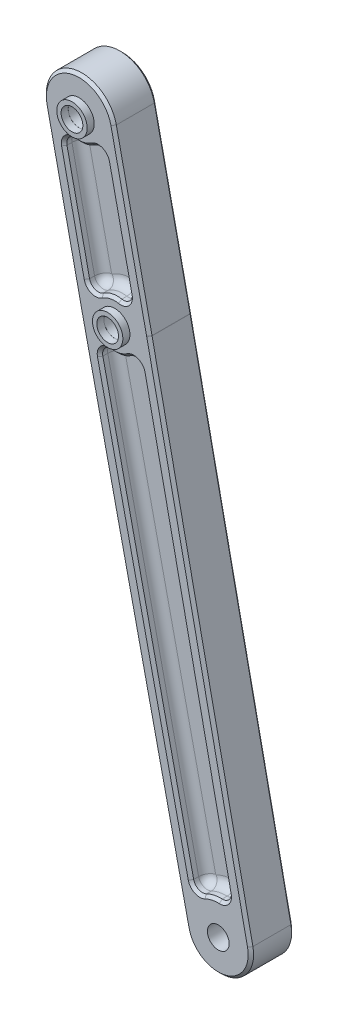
ISO-10303-21;
HEADER;
FILE_DESCRIPTION(('STEP AP214'),'2;1');
FILE_NAME('part.step','',(''),(''),'','','');
FILE_SCHEMA(('AUTOMOTIVE_DESIGN { 1 0 10303 214 1 1 1 1 }'));
ENDSEC;
DATA;
#1=APPLICATION_CONTEXT('core data for automotive mechanical design processes');
#2=APPLICATION_PROTOCOL_DEFINITION('international standard','automotive_design',2000,#1);
#3=PRODUCT_CONTEXT('',#1,'mechanical');
#4=PRODUCT('Part','Part','',(#3));
#5=PRODUCT_RELATED_PRODUCT_CATEGORY('part','',(#4));
#6=PRODUCT_DEFINITION_FORMATION('','',#4);
#7=PRODUCT_DEFINITION_CONTEXT('part definition',#1,'design');
#8=PRODUCT_DEFINITION('design','',#6,#7);
#9=PRODUCT_DEFINITION_SHAPE('','',#8);
#10=(LENGTH_UNIT() NAMED_UNIT(*) SI_UNIT(.MILLI.,.METRE.));
#11=(NAMED_UNIT(*) PLANE_ANGLE_UNIT() SI_UNIT($,.RADIAN.));
#12=(NAMED_UNIT(*) SI_UNIT($,.STERADIAN.) SOLID_ANGLE_UNIT());
#13=UNCERTAINTY_MEASURE_WITH_UNIT(LENGTH_MEASURE(1.E-05),#10,'distance_accuracy_value','');
#14=(GEOMETRIC_REPRESENTATION_CONTEXT(3) GLOBAL_UNCERTAINTY_ASSIGNED_CONTEXT((#13)) GLOBAL_UNIT_ASSIGNED_CONTEXT((#10,
#11,#12)) REPRESENTATION_CONTEXT('',''));
#15=CARTESIAN_POINT('',(0.,0.,0.));
#16=DIRECTION('',(0.,0.,1.));
#17=DIRECTION('',(1.,0.,0.));
#18=AXIS2_PLACEMENT_3D('',#15,#16,#17);
#19=CARTESIAN_POINT('',(99.5403612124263,-38.0849425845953,20.5));
#20=DIRECTION('',(0.,0.,1.));
#21=DIRECTION('',(1.,0.,0.));
#22=AXIS2_PLACEMENT_3D('',#19,#20,#21);
#23=PLANE('',#22);
#24=CARTESIAN_POINT('',(109.589658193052,-73.4502001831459,20.5));
#25=DIRECTION('',(0.,0.,1.));
#26=DIRECTION('',(1.,0.,0.));
#27=AXIS2_PLACEMENT_3D('',#24,#25,#26);
#28=CIRCLE('',#27,2.15);
#29=CARTESIAN_POINT('',(108.372032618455,-71.6782272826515,20.5));
#30=VERTEX_POINT('',#29);
#31=CARTESIAN_POINT('',(111.693433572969,-73.0067713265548,20.5));
#32=VERTEX_POINT('',#31);
#33=EDGE_CURVE('E1003',#30,#32,#28,.F.);
#34=ORIENTED_EDGE('',*,*,#33,.T.);
#35=DIRECTION('',(0.20624597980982,-0.978500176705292,0.));
#36=VECTOR('',#35,1.);
#37=CARTESIAN_POINT('',(104.128838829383,-37.1177939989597,20.5));
#38=LINE('',#37,#36);
#39=CARTESIAN_POINT('',(127.553246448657,-148.251048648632,20.5));
#40=VERTEX_POINT('',#39);
#41=EDGE_CURVE('E1005',#32,#40,#38,.T.);
#42=ORIENTED_EDGE('',*,*,#41,.T.);
#43=CARTESIAN_POINT('',(125.44947106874,-148.694477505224,20.5));
#44=DIRECTION('',(0.,0.,1.));
#45=DIRECTION('',(1.,0.,0.));
#46=AXIS2_PLACEMENT_3D('',#43,#44,#45);
#47=CIRCLE('',#46,2.14999999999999);
#48=CARTESIAN_POINT('',(125.370982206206,-150.843044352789,20.5));
#49=VERTEX_POINT('',#48);
#50=EDGE_CURVE('E1001',#40,#49,#47,.F.);
#51=ORIENTED_EDGE('',*,*,#50,.T.);
#52=CARTESIAN_POINT('',(125.170196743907,-156.339378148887,20.5));
#53=DIRECTION('',(0.,0.,1.));
#54=DIRECTION('',(1.,0.,0.));
#55=AXIS2_PLACEMENT_3D('',#52,#53,#54);
#56=CIRCLE('',#55,5.50000000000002);
#57=CARTESIAN_POINT('',(122.711829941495,-151.419374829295,20.5));
#58=VERTEX_POINT('',#57);
#59=EDGE_CURVE('E997',#49,#58,#56,.T.);
#60=ORIENTED_EDGE('',*,*,#59,.T.);
#61=CARTESIAN_POINT('',(121.750832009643,-149.496100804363,20.5));
#62=DIRECTION('',(0.,0.,1.));
#63=DIRECTION('',(1.,0.,0.));
#64=AXIS2_PLACEMENT_3D('',#61,#62,#63);
#65=CIRCLE('',#64,2.15);
#66=CARTESIAN_POINT('',(119.652245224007,-149.963469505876,20.5));
#67=VERTEX_POINT('',#66);
#68=EDGE_CURVE('E993',#58,#67,#65,.F.);
#69=ORIENTED_EDGE('',*,*,#68,.T.);
#70=DIRECTION('',(-0.217380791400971,0.976086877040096,0.));
#71=VECTOR('',#70,1.);
#72=CARTESIAN_POINT('',(94.9632002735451,-39.1043056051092,20.5));
#73=LINE('',#72,#71);
#74=CARTESIAN_POINT('',(102.936192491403,-74.9047690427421,20.5));
#75=VERTEX_POINT('',#74);
#76=EDGE_CURVE('E991',#67,#75,#73,.T.);
#77=ORIENTED_EDGE('',*,*,#76,.T.);
#78=CARTESIAN_POINT('',(105.034779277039,-74.43740034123,20.5));
#79=DIRECTION('',(0.,0.,1.));
#80=DIRECTION('',(1.,0.,0.));
#81=AXIS2_PLACEMENT_3D('',#78,#79,#80);
#82=CIRCLE('',#81,2.15000000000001);
#83=CARTESIAN_POINT('',(105.409509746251,-72.3203086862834,20.5));
#84=VERTEX_POINT('',#83);
#85=EDGE_CURVE('E995',#75,#84,#82,.F.);
#86=ORIENTED_EDGE('',*,*,#85,.T.);
#87=CARTESIAN_POINT('',(106.106682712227,-68.3815335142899,20.5));
#88=DIRECTION('',(0.,0.,1.));
#89=DIRECTION('',(1.,0.,0.));
#90=AXIS2_PLACEMENT_3D('',#87,#88,#89);
#91=CIRCLE('',#90,4.);
#92=EDGE_CURVE('E999',#84,#30,#91,.T.);
#93=ORIENTED_EDGE('',*,*,#92,.T.);
#94=EDGE_LOOP('',(#34,#42,#51,#60,#69,#77,#86,#93));
#95=FACE_BOUND('',#94,.T.);
#96=CARTESIAN_POINT('',(107.213067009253,-62.331871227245,20.5));
#97=DIRECTION('',(0.,0.,1.));
#98=DIRECTION('',(1.,0.,0.));
#99=AXIS2_PLACEMENT_3D('',#96,#97,#98);
#100=CIRCLE('',#99,2.14999999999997);
#101=CARTESIAN_POINT('',(109.314282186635,-61.8764650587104,20.5));
#102=VERTEX_POINT('',#101);
#103=CARTESIAN_POINT('',(106.826282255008,-64.4467938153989,20.5));
#104=VERTEX_POINT('',#103);
#105=EDGE_CURVE('E984',#102,#104,#100,.F.);
#106=ORIENTED_EDGE('',*,*,#105,.T.);
#107=CARTESIAN_POINT('',(106.106682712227,-68.3815335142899,20.5));
#108=DIRECTION('',(0.,0.,1.));
#109=DIRECTION('',(1.,0.,0.));
#110=AXIS2_PLACEMENT_3D('',#107,#108,#109);
#111=CIRCLE('',#110,4.00000000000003);
#112=CARTESIAN_POINT('',(103.822589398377,-65.0977981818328,20.5));
#113=VERTEX_POINT('',#112);
#114=EDGE_CURVE('E988',#104,#113,#111,.T.);
#115=ORIENTED_EDGE('',*,*,#114,.T.);
#116=CARTESIAN_POINT('',(102.594889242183,-63.3327904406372,20.5));
#117=DIRECTION('',(0.,0.,1.));
#118=DIRECTION('',(1.,0.,0.));
#119=AXIS2_PLACEMENT_3D('',#116,#117,#118);
#120=CIRCLE('',#119,2.14999999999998);
#121=CARTESIAN_POINT('',(100.493674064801,-63.7881966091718,20.5));
#122=VERTEX_POINT('',#121);
#123=EDGE_CURVE('E986',#113,#122,#120,.F.);
#124=ORIENTED_EDGE('',*,*,#123,.T.);
#125=DIRECTION('',(-0.21181682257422,0.977309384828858,0.));
#126=VECTOR('',#125,1.);
#127=CARTESIAN_POINT('',(95.1300571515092,-39.040808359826,20.5));
#128=LINE('',#127,#126);
#129=CARTESIAN_POINT('',(96.332761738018,-44.5900110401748,20.5));
#130=VERTEX_POINT('',#129);
#131=EDGE_CURVE('E982',#122,#130,#128,.T.);
#132=ORIENTED_EDGE('',*,*,#131,.T.);
#133=CARTESIAN_POINT('',(98.4339769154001,-44.1346048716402,20.5));
#134=DIRECTION('',(0.,0.,1.));
#135=DIRECTION('',(1.,0.,0.));
#136=AXIS2_PLACEMENT_3D('',#133,#134,#135);
#137=CIRCLE('',#136,2.14999999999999);
#138=CARTESIAN_POINT('',(98.820761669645,-42.0196822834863,20.5));
#139=VERTEX_POINT('',#138);
#140=EDGE_CURVE('E978',#130,#139,#137,.F.);
#141=ORIENTED_EDGE('',*,*,#140,.T.);
#142=CARTESIAN_POINT('',(99.5403612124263,-38.0849425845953,20.5));
#143=DIRECTION('',(0.,0.,1.));
#144=DIRECTION('',(1.,0.,0.));
#145=AXIS2_PLACEMENT_3D('',#142,#143,#144);
#146=CIRCLE('',#145,4.00000000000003);
#147=CARTESIAN_POINT('',(101.824454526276,-41.3686779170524,20.5));
#148=VERTEX_POINT('',#147);
#149=EDGE_CURVE('E974',#139,#148,#146,.T.);
#150=ORIENTED_EDGE('',*,*,#149,.T.);
#151=CARTESIAN_POINT('',(103.05215468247,-43.133685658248,20.5));
#152=DIRECTION('',(0.,0.,1.));
#153=DIRECTION('',(1.,0.,0.));
#154=AXIS2_PLACEMENT_3D('',#151,#152,#153);
#155=CIRCLE('',#154,2.14999999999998);
#156=CARTESIAN_POINT('',(105.153369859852,-42.6782794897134,20.5));
#157=VERTEX_POINT('',#156);
#158=EDGE_CURVE('E976',#148,#157,#155,.F.);
#159=ORIENTED_EDGE('',*,*,#158,.T.);
#160=DIRECTION('',(0.21181682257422,-0.977309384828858,0.));
#161=VECTOR('',#160,1.);
#162=CARTESIAN_POINT('',(103.950665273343,-37.1290768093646,20.5));
#163=LINE('',#162,#161);
#164=EDGE_CURVE('E980',#157,#102,#163,.T.);
#165=ORIENTED_EDGE('',*,*,#164,.T.);
#166=EDGE_LOOP('',(#106,#115,#124,#132,#141,#150,#159,#165));
#167=FACE_BOUND('',#166,.T.);
#168=DIRECTION('',(0.217380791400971,-0.976086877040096,0.));
#169=VECTOR('',#168,1.);
#170=CARTESIAN_POINT('',(93.499069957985,-39.4303767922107,20.5));
#171=LINE('',#170,#169);
#172=CARTESIAN_POINT('',(100.237765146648,-69.6885789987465,20.5));
#173=VERTEX_POINT('',#172);
#174=CARTESIAN_POINT('',(119.801718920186,-157.534972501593,20.5));
#175=VERTEX_POINT('',#174);
#176=EDGE_CURVE('E967',#173,#175,#171,.T.);
#177=ORIENTED_EDGE('',*,*,#176,.T.);
#178=CARTESIAN_POINT('',(125.170196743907,-156.339378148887,20.5));
#179=DIRECTION('',(0.,0.,1.));
#180=DIRECTION('',(1.,0.,0.));
#181=AXIS2_PLACEMENT_3D('',#178,#179,#180);
#182=CIRCLE('',#181,5.49999999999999);
#183=CARTESIAN_POINT('',(130.551947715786,-155.205025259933,20.5));
#184=VERTEX_POINT('',#183);
#185=EDGE_CURVE('E971',#175,#184,#182,.T.);
#186=ORIENTED_EDGE('',*,*,#185,.T.);
#187=DIRECTION('',(-0.20624597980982,0.978500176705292,0.));
#188=VECTOR('',#187,1.);
#189=CARTESIAN_POINT('',(105.596589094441,-36.808425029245,20.5));
#190=LINE('',#189,#188);
#191=CARTESIAN_POINT('',(111.990110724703,-67.1414383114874,20.5));
#192=VERTEX_POINT('',#191);
#193=EDGE_CURVE('E969',#184,#192,#190,.T.);
#194=ORIENTED_EDGE('',*,*,#193,.T.);
#195=CARTESIAN_POINT('',(106.106682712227,-68.3815335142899,20.5));
#196=DIRECTION('',(0.,0.,1.));
#197=DIRECTION('',(1.,0.,0.));
#198=AXIS2_PLACEMENT_3D('',#195,#196,#197);
#199=CIRCLE('',#198,6.01270000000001);
#200=CARTESIAN_POINT('',(111.982950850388,-67.1079425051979,20.5));
#201=VERTEX_POINT('',#200);
#202=EDGE_CURVE('E965',#192,#201,#199,.T.);
#203=ORIENTED_EDGE('',*,*,#202,.T.);
#204=DIRECTION('',(-0.211816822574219,0.977309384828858,0.));
#205=VECTOR('',#204,1.);
#206=CARTESIAN_POINT('',(105.416629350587,-36.8113515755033,20.5));
#207=LINE('',#206,#205);
#208=CARTESIAN_POINT('',(105.416629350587,-36.8113515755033,20.5));
#209=VERTEX_POINT('',#208);
#210=EDGE_CURVE('E961',#201,#209,#207,.T.);
#211=ORIENTED_EDGE('',*,*,#210,.T.);
#212=CARTESIAN_POINT('',(99.5403612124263,-38.0849425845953,20.5));
#213=DIRECTION('',(0.,0.,1.));
#214=DIRECTION('',(1.,0.,0.));
#215=AXIS2_PLACEMENT_3D('',#212,#213,#214);
#216=CIRCLE('',#215,6.01270000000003);
#217=CARTESIAN_POINT('',(93.6640930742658,-39.3585335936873,20.5));
#218=VERTEX_POINT('',#217);
#219=EDGE_CURVE('E957',#209,#218,#216,.T.);
#220=ORIENTED_EDGE('',*,*,#219,.T.);
#221=DIRECTION('',(0.211816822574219,-0.977309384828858,0.));
#222=VECTOR('',#221,1.);
#223=CARTESIAN_POINT('',(93.6640930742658,-39.3585335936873,20.5));
#224=LINE('',#223,#222);
#225=CARTESIAN_POINT('',(100.230414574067,-69.6551245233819,20.5));
#226=VERTEX_POINT('',#225);
#227=EDGE_CURVE('E959',#218,#226,#224,.T.);
#228=ORIENTED_EDGE('',*,*,#227,.T.);
#229=CARTESIAN_POINT('',(106.106682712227,-68.3815335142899,20.5));
#230=DIRECTION('',(0.,0.,1.));
#231=DIRECTION('',(1.,0.,0.));
#232=AXIS2_PLACEMENT_3D('',#229,#230,#231);
#233=CIRCLE('',#232,6.01270000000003);
#234=EDGE_CURVE('E963',#226,#173,#233,.T.);
#235=ORIENTED_EDGE('',*,*,#234,.T.);
#236=EDGE_LOOP('',(#177,#186,#194,#203,#211,#220,#228,#235));
#237=FACE_BOUND('',#236,.T.);
#238=CARTESIAN_POINT('',(125.170196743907,-156.339378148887,20.5));
#239=DIRECTION('',(0.,0.,1.));
#240=DIRECTION('',(1.,0.,0.));
#241=AXIS2_PLACEMENT_3D('',#238,#239,#240);
#242=CIRCLE('',#241,2.);
#243=CARTESIAN_POINT('',(127.170196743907,-156.339378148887,20.5));
#244=VERTEX_POINT('',#243);
#245=EDGE_CURVE('E1214',#244,#244,#242,.T.);
#246=ORIENTED_EDGE('',*,*,#245,.F.);
#247=EDGE_LOOP('',(#246));
#248=FACE_BOUND('',#247,.T.);
#249=CARTESIAN_POINT('',(106.106682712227,-68.3815335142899,20.5));
#250=DIRECTION('',(0.,0.,1.));
#251=DIRECTION('',(1.,0.,0.));
#252=AXIS2_PLACEMENT_3D('',#249,#250,#251);
#253=CIRCLE('',#252,2.79999999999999);
#254=CARTESIAN_POINT('',(103.306682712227,-68.3815335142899,20.5));
#255=VERTEX_POINT('',#254);
#256=EDGE_CURVE('E1285',#255,#255,#253,.T.);
#257=ORIENTED_EDGE('',*,*,#256,.F.);
#258=EDGE_LOOP('',(#257));
#259=FACE_BOUND('',#258,.T.);
#260=CARTESIAN_POINT('',(99.5403612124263,-38.0849425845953,20.5));
#261=DIRECTION('',(0.,0.,1.));
#262=DIRECTION('',(1.,0.,0.));
#263=AXIS2_PLACEMENT_3D('',#260,#261,#262);
#264=CIRCLE('',#263,2.79999999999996);
#265=CARTESIAN_POINT('',(96.7403612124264,-38.0849425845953,20.5));
#266=VERTEX_POINT('',#265);
#267=EDGE_CURVE('E1294',#266,#266,#264,.T.);
#268=ORIENTED_EDGE('',*,*,#267,.F.);
#269=EDGE_LOOP('',(#268));
#270=FACE_BOUND('',#269,.T.);
#271=ADVANCED_FACE('F35',(#95,#167,#237,#248,#259,#270),#23,.T.);
#272=CARTESIAN_POINT('',(99.5403612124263,-38.0849425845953,20.5));
#273=DIRECTION('',(0.,0.,1.));
#274=DIRECTION('',(1.,0.,0.));
#275=AXIS2_PLACEMENT_3D('',#272,#273,#274);
#276=CIRCLE('',#275,2.00000000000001);
#277=CARTESIAN_POINT('',(97.5403612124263,-38.0849425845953,20.5));
#278=VERTEX_POINT('',#277);
#279=EDGE_CURVE('E571',#278,#278,#276,.F.);
#280=ORIENTED_EDGE('',*,*,#279,.F.);
#281=EDGE_LOOP('',(#280));
#282=FACE_BOUND('',#281,.T.);
#283=CARTESIAN_POINT('',(99.5403612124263,-38.0849425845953,20.5));
#284=DIRECTION('',(0.,0.,1.));
#285=DIRECTION('',(1.,0.,0.));
#286=AXIS2_PLACEMENT_3D('',#283,#284,#285);
#287=CIRCLE('',#286,1.99);
#288=CARTESIAN_POINT('',(101.530361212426,-38.0849425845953,20.5));
#289=VERTEX_POINT('',#288);
#290=EDGE_CURVE('E1196',#289,#289,#287,.T.);
#291=ORIENTED_EDGE('',*,*,#290,.F.);
#292=EDGE_LOOP('',(#291));
#293=FACE_BOUND('',#292,.T.);
#294=ADVANCED_FACE('F1322',(#282,#293),#23,.T.);
#295=CARTESIAN_POINT('',(106.106682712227,-68.3815335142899,20.5));
#296=DIRECTION('',(0.,0.,1.));
#297=DIRECTION('',(1.,0.,0.));
#298=AXIS2_PLACEMENT_3D('',#295,#296,#297);
#299=CIRCLE('',#298,2.);
#300=CARTESIAN_POINT('',(104.106682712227,-68.3815335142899,20.5));
#301=VERTEX_POINT('',#300);
#302=EDGE_CURVE('E576',#301,#301,#299,.F.);
#303=ORIENTED_EDGE('',*,*,#302,.F.);
#304=EDGE_LOOP('',(#303));
#305=FACE_BOUND('',#304,.T.);
#306=CARTESIAN_POINT('',(106.106682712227,-68.3815335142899,20.5));
#307=DIRECTION('',(0.,0.,1.));
#308=DIRECTION('',(1.,0.,0.));
#309=AXIS2_PLACEMENT_3D('',#306,#307,#308);
#310=CIRCLE('',#309,1.98999999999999);
#311=CARTESIAN_POINT('',(108.096682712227,-68.3815335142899,20.5));
#312=VERTEX_POINT('',#311);
#313=EDGE_CURVE('E1218',#312,#312,#310,.T.);
#314=ORIENTED_EDGE('',*,*,#313,.F.);
#315=EDGE_LOOP('',(#314));
#316=FACE_BOUND('',#315,.T.);
#317=ADVANCED_FACE('F1325',(#305,#316),#23,.T.);
#318=CARTESIAN_POINT('',(99.5403612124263,-38.0849425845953,12.5));
#319=DIRECTION('',(0.,0.,1.));
#320=DIRECTION('',(1.,0.,0.));
#321=AXIS2_PLACEMENT_3D('',#318,#319,#320);
#322=CYLINDRICAL_SURFACE('',#321,6.5127);
#323=DIRECTION('',(0.,0.,1.));
#324=VECTOR('',#323,1.);
#325=CARTESIAN_POINT('',(105.905284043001,-36.7054431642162,12.5));
#326=LINE('',#325,#324);
#327=CARTESIAN_POINT('',(105.905284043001,-36.7054431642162,13.));
#328=VERTEX_POINT('',#327);
#329=CARTESIAN_POINT('',(105.905284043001,-36.7054431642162,20.));
#330=VERTEX_POINT('',#329);
#331=EDGE_CURVE('E1181',#328,#330,#326,.T.);
#332=ORIENTED_EDGE('',*,*,#331,.F.);
#333=CARTESIAN_POINT('',(99.5403612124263,-38.0849425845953,13.));
#334=DIRECTION('',(0.,0.,1.));
#335=DIRECTION('',(1.,0.,0.));
#336=AXIS2_PLACEMENT_3D('',#333,#334,#335);
#337=CIRCLE('',#336,6.5127);
#338=CARTESIAN_POINT('',(93.1754383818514,-39.4644420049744,13.));
#339=VERTEX_POINT('',#338);
#340=EDGE_CURVE('E910',#328,#339,#337,.T.);
#341=ORIENTED_EDGE('',*,*,#340,.T.);
#342=DIRECTION('',(0.,0.,1.));
#343=VECTOR('',#342,1.);
#344=CARTESIAN_POINT('',(93.1754383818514,-39.4644420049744,12.5));
#345=LINE('',#344,#343);
#346=CARTESIAN_POINT('',(93.1754383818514,-39.4644420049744,20.));
#347=VERTEX_POINT('',#346);
#348=EDGE_CURVE('E1184',#339,#347,#345,.T.);
#349=ORIENTED_EDGE('',*,*,#348,.T.);
#350=CARTESIAN_POINT('',(99.5403612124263,-38.0849425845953,20.));
#351=DIRECTION('',(0.,0.,1.));
#352=DIRECTION('',(1.,0.,0.));
#353=AXIS2_PLACEMENT_3D('',#350,#351,#352);
#354=CIRCLE('',#353,6.5127);
#355=EDGE_CURVE('E908',#347,#330,#354,.F.);
#356=ORIENTED_EDGE('',*,*,#355,.T.);
#357=EDGE_LOOP('',(#332,#341,#349,#356));
#358=FACE_BOUND('',#357,.T.);
#359=ADVANCED_FACE('F1180',(#358),#322,.T.);
#360=CARTESIAN_POINT('',(105.905284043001,-36.7054431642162,12.5));
#361=DIRECTION('',(0.977309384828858,0.211816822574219,0.));
#362=DIRECTION('',(-0.211816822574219,0.977309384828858,0.));
#363=AXIS2_PLACEMENT_3D('',#360,#361,#362);
#364=PLANE('',#363);
#365=DIRECTION('',(0.,0.,1.));
#366=VECTOR('',#365,1.);
#367=CARTESIAN_POINT('',(112.471605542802,-67.0020340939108,12.5));
#368=LINE('',#367,#366);
#369=CARTESIAN_POINT('',(112.471605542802,-67.0020340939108,13.));
#370=VERTEX_POINT('',#369);
#371=CARTESIAN_POINT('',(112.471605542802,-67.0020340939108,20.));
#372=VERTEX_POINT('',#371);
#373=EDGE_CURVE('E1190',#370,#372,#368,.T.);
#374=ORIENTED_EDGE('',*,*,#373,.F.);
#375=DIRECTION('',(-0.211816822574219,0.977309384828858,0.));
#376=VECTOR('',#375,1.);
#377=CARTESIAN_POINT('',(105.905284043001,-36.7054431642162,13.));
#378=LINE('',#377,#376);
#379=EDGE_CURVE('E906',#370,#328,#378,.T.);
#380=ORIENTED_EDGE('',*,*,#379,.T.);
#381=ORIENTED_EDGE('',*,*,#331,.T.);
#382=DIRECTION('',(0.211816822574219,-0.977309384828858,0.));
#383=VECTOR('',#382,1.);
#384=CARTESIAN_POINT('',(105.905284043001,-36.7054431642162,20.));
#385=LINE('',#384,#383);
#386=EDGE_CURVE('E904',#330,#372,#385,.T.);
#387=ORIENTED_EDGE('',*,*,#386,.T.);
#388=EDGE_LOOP('',(#374,#380,#381,#387));
#389=FACE_BOUND('',#388,.T.);
#390=ADVANCED_FACE('F1187',(#389),#364,.T.);
#391=CARTESIAN_POINT('',(106.106682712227,-68.3815335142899,12.5));
#392=DIRECTION('',(0.,0.,1.));
#393=DIRECTION('',(1.,0.,0.));
#394=AXIS2_PLACEMENT_3D('',#391,#392,#393);
#395=CYLINDRICAL_SURFACE('',#394,6.51269999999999);
#396=DIRECTION('',(0.,0.,1.));
#397=VECTOR('',#396,1.);
#398=CARTESIAN_POINT('',(112.479360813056,-67.0383153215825,12.5));
#399=LINE('',#398,#397);
#400=CARTESIAN_POINT('',(112.479360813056,-67.0383153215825,13.));
#401=VERTEX_POINT('',#400);
#402=CARTESIAN_POINT('',(112.479360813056,-67.0383153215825,20.));
#403=VERTEX_POINT('',#402);
#404=EDGE_CURVE('E1193',#401,#403,#399,.T.);
#405=ORIENTED_EDGE('',*,*,#404,.F.);
#406=CARTESIAN_POINT('',(106.106682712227,-68.3815335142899,13.));
#407=DIRECTION('',(0.,0.,1.));
#408=DIRECTION('',(1.,0.,0.));
#409=AXIS2_PLACEMENT_3D('',#406,#407,#408);
#410=CIRCLE('',#409,6.51269999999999);
#411=EDGE_CURVE('E902',#401,#370,#410,.T.);
#412=ORIENTED_EDGE('',*,*,#411,.T.);
#413=ORIENTED_EDGE('',*,*,#373,.T.);
#414=CARTESIAN_POINT('',(106.106682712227,-68.3815335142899,20.));
#415=DIRECTION('',(0.,0.,1.));
#416=DIRECTION('',(1.,0.,0.));
#417=AXIS2_PLACEMENT_3D('',#414,#415,#416);
#418=CIRCLE('',#417,6.51269999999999);
#419=EDGE_CURVE('E900',#372,#403,#418,.F.);
#420=ORIENTED_EDGE('',*,*,#419,.T.);
#421=EDGE_LOOP('',(#405,#412,#413,#420));
#422=FACE_BOUND('',#421,.T.);
#423=ADVANCED_FACE('F2240',(#422),#395,.T.);
#424=CARTESIAN_POINT('',(112.479360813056,-67.0383153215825,12.5));
#425=DIRECTION('',(0.978500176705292,0.20624597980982,0.));
#426=DIRECTION('',(-0.20624597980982,0.978500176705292,0.));
#427=AXIS2_PLACEMENT_3D('',#424,#425,#426);
#428=PLANE('',#427);
#429=DIRECTION('',(0.,0.,1.));
#430=VECTOR('',#429,1.);
#431=CARTESIAN_POINT('',(131.041197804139,-155.101902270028,12.5));
#432=LINE('',#431,#430);
#433=CARTESIAN_POINT('',(131.041197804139,-155.101902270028,13.));
#434=VERTEX_POINT('',#433);
#435=CARTESIAN_POINT('',(131.041197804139,-155.101902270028,20.));
#436=VERTEX_POINT('',#435);
#437=EDGE_CURVE('E1201',#434,#436,#432,.T.);
#438=ORIENTED_EDGE('',*,*,#437,.F.);
#439=DIRECTION('',(-0.20624597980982,0.978500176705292,0.));
#440=VECTOR('',#439,1.);
#441=CARTESIAN_POINT('',(112.479360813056,-67.0383153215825,13.));
#442=LINE('',#441,#440);
#443=EDGE_CURVE('E898',#434,#401,#442,.T.);
#444=ORIENTED_EDGE('',*,*,#443,.T.);
#445=ORIENTED_EDGE('',*,*,#404,.T.);
#446=DIRECTION('',(0.20624597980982,-0.978500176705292,0.));
#447=VECTOR('',#446,1.);
#448=CARTESIAN_POINT('',(112.479360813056,-67.0383153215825,20.));
#449=LINE('',#448,#447);
#450=EDGE_CURVE('E896',#403,#436,#449,.T.);
#451=ORIENTED_EDGE('',*,*,#450,.T.);
#452=EDGE_LOOP('',(#438,#444,#445,#451));
#453=FACE_BOUND('',#452,.T.);
#454=ADVANCED_FACE('F2248',(#453),#428,.T.);
#455=CARTESIAN_POINT('',(125.170196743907,-156.339378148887,12.5));
#456=DIRECTION('',(0.,0.,1.));
#457=DIRECTION('',(1.,0.,0.));
#458=AXIS2_PLACEMENT_3D('',#455,#456,#457);
#459=CYLINDRICAL_SURFACE('',#458,5.99999999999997);
#460=DIRECTION('',(0.,0.,1.));
#461=VECTOR('',#460,1.);
#462=CARTESIAN_POINT('',(119.313675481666,-157.643662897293,12.5));
#463=LINE('',#462,#461);
#464=CARTESIAN_POINT('',(119.313675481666,-157.643662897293,13.));
#465=VERTEX_POINT('',#464);
#466=CARTESIAN_POINT('',(119.313675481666,-157.643662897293,20.));
#467=VERTEX_POINT('',#466);
#468=EDGE_CURVE('E1204',#465,#467,#463,.T.);
#469=ORIENTED_EDGE('',*,*,#468,.F.);
#470=CARTESIAN_POINT('',(125.170196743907,-156.339378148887,13.));
#471=DIRECTION('',(0.,0.,1.));
#472=DIRECTION('',(1.,0.,0.));
#473=AXIS2_PLACEMENT_3D('',#470,#471,#472);
#474=CIRCLE('',#473,5.99999999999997);
#475=EDGE_CURVE('E894',#465,#434,#474,.T.);
#476=ORIENTED_EDGE('',*,*,#475,.T.);
#477=ORIENTED_EDGE('',*,*,#437,.T.);
#478=CARTESIAN_POINT('',(125.170196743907,-156.339378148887,20.));
#479=DIRECTION('',(0.,0.,1.));
#480=DIRECTION('',(1.,0.,0.));
#481=AXIS2_PLACEMENT_3D('',#478,#479,#480);
#482=CIRCLE('',#481,5.99999999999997);
#483=EDGE_CURVE('E891',#436,#467,#482,.F.);
#484=ORIENTED_EDGE('',*,*,#483,.T.);
#485=EDGE_LOOP('',(#469,#476,#477,#484));
#486=FACE_BOUND('',#485,.T.);
#487=ADVANCED_FACE('F2258',(#486),#459,.T.);
#488=CARTESIAN_POINT('',(99.7497217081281,-69.797269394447,12.5));
#489=DIRECTION('',(-0.976086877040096,-0.217380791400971,0.));
#490=DIRECTION('',(0.217380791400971,-0.976086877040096,0.));
#491=AXIS2_PLACEMENT_3D('',#488,#489,#490);
#492=PLANE('',#491);
#493=DIRECTION('',(0.,0.,1.));
#494=VECTOR('',#493,1.);
#495=CARTESIAN_POINT('',(99.7497217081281,-69.797269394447,12.5));
#496=LINE('',#495,#494);
#497=CARTESIAN_POINT('',(99.7497217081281,-69.797269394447,13.));
#498=VERTEX_POINT('',#497);
#499=CARTESIAN_POINT('',(99.7497217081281,-69.797269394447,20.));
#500=VERTEX_POINT('',#499);
#501=EDGE_CURVE('E1207',#498,#500,#496,.T.);
#502=ORIENTED_EDGE('',*,*,#501,.F.);
#503=DIRECTION('',(0.217380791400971,-0.976086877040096,0.));
#504=VECTOR('',#503,1.);
#505=CARTESIAN_POINT('',(119.313675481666,-157.643662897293,13.));
#506=LINE('',#505,#504);
#507=EDGE_CURVE('E889',#498,#465,#506,.T.);
#508=ORIENTED_EDGE('',*,*,#507,.T.);
#509=ORIENTED_EDGE('',*,*,#468,.T.);
#510=DIRECTION('',(-0.217380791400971,0.976086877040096,0.));
#511=VECTOR('',#510,1.);
#512=CARTESIAN_POINT('',(99.7497217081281,-69.797269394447,20.));
#513=LINE('',#512,#511);
#514=EDGE_CURVE('E887',#467,#500,#513,.T.);
#515=ORIENTED_EDGE('',*,*,#514,.T.);
#516=EDGE_LOOP('',(#502,#508,#509,#515));
#517=FACE_BOUND('',#516,.T.);
#518=ADVANCED_FACE('F2268',(#517),#492,.T.);
#519=CARTESIAN_POINT('',(106.106682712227,-68.3815335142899,12.5));
#520=DIRECTION('',(0.,0.,1.));
#521=DIRECTION('',(1.,0.,0.));
#522=AXIS2_PLACEMENT_3D('',#519,#520,#521);
#523=CYLINDRICAL_SURFACE('',#522,6.51270000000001);
#524=DIRECTION('',(0.,0.,1.));
#525=VECTOR('',#524,1.);
#526=CARTESIAN_POINT('',(99.7417598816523,-69.761032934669,12.5));
#527=LINE('',#526,#525);
#528=CARTESIAN_POINT('',(99.7417598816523,-69.761032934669,13.));
#529=VERTEX_POINT('',#528);
#530=CARTESIAN_POINT('',(99.7417598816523,-69.761032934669,20.));
#531=VERTEX_POINT('',#530);
#532=EDGE_CURVE('E1210',#529,#531,#527,.T.);
#533=ORIENTED_EDGE('',*,*,#532,.F.);
#534=CARTESIAN_POINT('',(106.106682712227,-68.3815335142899,13.));
#535=DIRECTION('',(0.,0.,1.));
#536=DIRECTION('',(1.,0.,0.));
#537=AXIS2_PLACEMENT_3D('',#534,#535,#536);
#538=CIRCLE('',#537,6.51270000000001);
#539=EDGE_CURVE('E885',#529,#498,#538,.T.);
#540=ORIENTED_EDGE('',*,*,#539,.T.);
#541=ORIENTED_EDGE('',*,*,#501,.T.);
#542=CARTESIAN_POINT('',(106.106682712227,-68.3815335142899,20.));
#543=DIRECTION('',(0.,0.,1.));
#544=DIRECTION('',(1.,0.,0.));
#545=AXIS2_PLACEMENT_3D('',#542,#543,#544);
#546=CIRCLE('',#545,6.51270000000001);
#547=EDGE_CURVE('E883',#500,#531,#546,.F.);
#548=ORIENTED_EDGE('',*,*,#547,.T.);
#549=EDGE_LOOP('',(#533,#540,#541,#548));
#550=FACE_BOUND('',#549,.T.);
#551=ADVANCED_FACE('F1370',(#550),#523,.T.);
#552=CARTESIAN_POINT('',(93.1754383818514,-39.4644420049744,12.5));
#553=DIRECTION('',(-0.977309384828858,-0.211816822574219,0.));
#554=DIRECTION('',(0.211816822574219,-0.977309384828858,0.));
#555=AXIS2_PLACEMENT_3D('',#552,#553,#554);
#556=PLANE('',#555);
#557=ORIENTED_EDGE('',*,*,#348,.F.);
#558=DIRECTION('',(0.211816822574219,-0.977309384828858,0.));
#559=VECTOR('',#558,1.);
#560=CARTESIAN_POINT('',(99.7417598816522,-69.761032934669,13.));
#561=LINE('',#560,#559);
#562=EDGE_CURVE('E820',#339,#529,#561,.T.);
#563=ORIENTED_EDGE('',*,*,#562,.T.);
#564=ORIENTED_EDGE('',*,*,#532,.T.);
#565=DIRECTION('',(-0.211816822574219,0.977309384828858,0.));
#566=VECTOR('',#565,1.);
#567=CARTESIAN_POINT('',(93.1754383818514,-39.4644420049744,20.));
#568=LINE('',#567,#566);
#569=EDGE_CURVE('E730',#531,#347,#568,.T.);
#570=ORIENTED_EDGE('',*,*,#569,.T.);
#571=EDGE_LOOP('',(#557,#563,#564,#570));
#572=FACE_BOUND('',#571,.T.);
#573=ADVANCED_FACE('F1365',(#572),#556,.T.);
#574=CARTESIAN_POINT('',(99.5403612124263,-38.0849425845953,12.5));
#575=DIRECTION('',(0.,0.,1.));
#576=DIRECTION('',(1.,0.,0.));
#577=AXIS2_PLACEMENT_3D('',#574,#575,#576);
#578=PLANE('',#577);
#579=CARTESIAN_POINT('',(106.106682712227,-68.3815335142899,12.5));
#580=DIRECTION('',(0.,0.,1.));
#581=DIRECTION('',(1.,0.,0.));
#582=AXIS2_PLACEMENT_3D('',#579,#580,#581);
#583=CIRCLE('',#582,6.01270000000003);
#584=CARTESIAN_POINT('',(100.237765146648,-69.6885789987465,12.5));
#585=VERTEX_POINT('',#584);
#586=CARTESIAN_POINT('',(100.230414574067,-69.6551245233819,12.5));
#587=VERTEX_POINT('',#586);
#588=EDGE_CURVE('E878',#585,#587,#583,.F.);
#589=ORIENTED_EDGE('',*,*,#588,.T.);
#590=DIRECTION('',(-0.211816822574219,0.977309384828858,0.));
#591=VECTOR('',#590,1.);
#592=CARTESIAN_POINT('',(93.6640930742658,-39.3585335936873,12.5));
#593=LINE('',#592,#591);
#594=CARTESIAN_POINT('',(93.6640930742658,-39.3585335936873,12.5));
#595=VERTEX_POINT('',#594);
#596=EDGE_CURVE('E880',#587,#595,#593,.T.);
#597=ORIENTED_EDGE('',*,*,#596,.T.);
#598=CARTESIAN_POINT('',(99.5403612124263,-38.0849425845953,12.5));
#599=DIRECTION('',(0.,0.,1.));
#600=DIRECTION('',(1.,0.,0.));
#601=AXIS2_PLACEMENT_3D('',#598,#599,#600);
#602=CIRCLE('',#601,6.01270000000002);
#603=CARTESIAN_POINT('',(105.416629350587,-36.8113515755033,12.5));
#604=VERTEX_POINT('',#603);
#605=EDGE_CURVE('E866',#595,#604,#602,.F.);
#606=ORIENTED_EDGE('',*,*,#605,.T.);
#607=DIRECTION('',(0.211816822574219,-0.977309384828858,0.));
#608=VECTOR('',#607,1.);
#609=CARTESIAN_POINT('',(111.982950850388,-67.1079425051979,12.5));
#610=LINE('',#609,#608);
#611=CARTESIAN_POINT('',(111.982950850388,-67.1079425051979,12.5));
#612=VERTEX_POINT('',#611);
#613=EDGE_CURVE('E868',#604,#612,#610,.T.);
#614=ORIENTED_EDGE('',*,*,#613,.T.);
#615=CARTESIAN_POINT('',(106.106682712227,-68.3815335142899,12.5));
#616=DIRECTION('',(0.,0.,1.));
#617=DIRECTION('',(1.,0.,0.));
#618=AXIS2_PLACEMENT_3D('',#615,#616,#617);
#619=CIRCLE('',#618,6.01270000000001);
#620=CARTESIAN_POINT('',(111.990110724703,-67.1414383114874,12.5));
#621=VERTEX_POINT('',#620);
#622=EDGE_CURVE('E870',#612,#621,#619,.F.);
#623=ORIENTED_EDGE('',*,*,#622,.T.);
#624=DIRECTION('',(0.20624597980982,-0.978500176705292,0.));
#625=VECTOR('',#624,1.);
#626=CARTESIAN_POINT('',(130.551947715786,-155.205025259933,12.5));
#627=LINE('',#626,#625);
#628=CARTESIAN_POINT('',(130.551947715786,-155.205025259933,12.5));
#629=VERTEX_POINT('',#628);
#630=EDGE_CURVE('E872',#621,#629,#627,.T.);
#631=ORIENTED_EDGE('',*,*,#630,.T.);
#632=CARTESIAN_POINT('',(125.170196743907,-156.339378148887,12.5));
#633=DIRECTION('',(0.,0.,1.));
#634=DIRECTION('',(1.,0.,0.));
#635=AXIS2_PLACEMENT_3D('',#632,#633,#634);
#636=CIRCLE('',#635,5.5);
#637=CARTESIAN_POINT('',(119.801718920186,-157.534972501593,12.5));
#638=VERTEX_POINT('',#637);
#639=EDGE_CURVE('E874',#629,#638,#636,.F.);
#640=ORIENTED_EDGE('',*,*,#639,.T.);
#641=DIRECTION('',(-0.217380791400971,0.976086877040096,0.));
#642=VECTOR('',#641,1.);
#643=CARTESIAN_POINT('',(100.237765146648,-69.6885789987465,12.5));
#644=LINE('',#643,#642);
#645=EDGE_CURVE('E876',#638,#585,#644,.T.);
#646=ORIENTED_EDGE('',*,*,#645,.T.);
#647=EDGE_LOOP('',(#589,#597,#606,#614,#623,#631,#640,#646));
#648=FACE_BOUND('',#647,.T.);
#649=CARTESIAN_POINT('',(99.5403612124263,-38.0849425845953,12.5));
#650=DIRECTION('',(0.,0.,1.));
#651=DIRECTION('',(1.,0.,0.));
#652=AXIS2_PLACEMENT_3D('',#649,#650,#651);
#653=CIRCLE('',#652,2.48999999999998);
#654=CARTESIAN_POINT('',(102.030361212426,-38.0849425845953,12.5));
#655=VERTEX_POINT('',#654);
#656=EDGE_CURVE('E863',#655,#655,#653,.T.);
#657=ORIENTED_EDGE('',*,*,#656,.T.);
#658=EDGE_LOOP('',(#657));
#659=FACE_BOUND('',#658,.T.);
#660=CARTESIAN_POINT('',(125.170196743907,-156.339378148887,12.5));
#661=DIRECTION('',(0.,0.,1.));
#662=DIRECTION('',(1.,0.,0.));
#663=AXIS2_PLACEMENT_3D('',#660,#661,#662);
#664=CIRCLE('',#663,2.49999999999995);
#665=CARTESIAN_POINT('',(127.670196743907,-156.339378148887,12.5));
#666=VERTEX_POINT('',#665);
#667=EDGE_CURVE('E860',#666,#666,#664,.T.);
#668=ORIENTED_EDGE('',*,*,#667,.T.);
#669=EDGE_LOOP('',(#668));
#670=FACE_BOUND('',#669,.T.);
#671=CARTESIAN_POINT('',(106.106682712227,-68.3815335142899,12.5));
#672=DIRECTION('',(0.,0.,1.));
#673=DIRECTION('',(1.,0.,0.));
#674=AXIS2_PLACEMENT_3D('',#671,#672,#673);
#675=CIRCLE('',#674,2.48999999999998);
#676=CARTESIAN_POINT('',(108.596682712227,-68.3815335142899,12.5));
#677=VERTEX_POINT('',#676);
#678=EDGE_CURVE('E857',#677,#677,#675,.T.);
#679=ORIENTED_EDGE('',*,*,#678,.T.);
#680=EDGE_LOOP('',(#679));
#681=FACE_BOUND('',#680,.T.);
#682=DIRECTION('',(0.217380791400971,-0.976086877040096,0.));
#683=VECTOR('',#682,1.);
#684=CARTESIAN_POINT('',(94.9632002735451,-39.1043056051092,12.5));
#685=LINE('',#684,#683);
#686=CARTESIAN_POINT('',(102.936192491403,-74.9047690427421,12.5));
#687=VERTEX_POINT('',#686);
#688=CARTESIAN_POINT('',(119.652245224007,-149.963469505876,12.5));
#689=VERTEX_POINT('',#688);
#690=EDGE_CURVE('E852',#687,#689,#685,.T.);
#691=ORIENTED_EDGE('',*,*,#690,.T.);
#692=CARTESIAN_POINT('',(121.750832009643,-149.496100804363,12.5));
#693=DIRECTION('',(0.,0.,1.));
#694=DIRECTION('',(1.,0.,0.));
#695=AXIS2_PLACEMENT_3D('',#692,#693,#694);
#696=CIRCLE('',#695,2.15000000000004);
#697=CARTESIAN_POINT('',(122.711829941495,-151.419374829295,12.5));
#698=VERTEX_POINT('',#697);
#699=EDGE_CURVE('E854',#689,#698,#696,.T.);
#700=ORIENTED_EDGE('',*,*,#699,.T.);
#701=CARTESIAN_POINT('',(125.170196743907,-156.339378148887,12.5));
#702=DIRECTION('',(0.,0.,1.));
#703=DIRECTION('',(1.,0.,0.));
#704=AXIS2_PLACEMENT_3D('',#701,#702,#703);
#705=CIRCLE('',#704,5.5);
#706=CARTESIAN_POINT('',(125.370982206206,-150.843044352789,12.5));
#707=VERTEX_POINT('',#706);
#708=EDGE_CURVE('E840',#698,#707,#705,.F.);
#709=ORIENTED_EDGE('',*,*,#708,.T.);
#710=CARTESIAN_POINT('',(125.44947106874,-148.694477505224,12.5));
#711=DIRECTION('',(0.,0.,1.));
#712=DIRECTION('',(1.,0.,0.));
#713=AXIS2_PLACEMENT_3D('',#710,#711,#712);
#714=CIRCLE('',#713,2.15000000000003);
#715=CARTESIAN_POINT('',(127.553246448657,-148.251048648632,12.5));
#716=VERTEX_POINT('',#715);
#717=EDGE_CURVE('E842',#707,#716,#714,.T.);
#718=ORIENTED_EDGE('',*,*,#717,.T.);
#719=DIRECTION('',(-0.20624597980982,0.978500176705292,0.));
#720=VECTOR('',#719,1.);
#721=CARTESIAN_POINT('',(104.128838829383,-37.1177939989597,12.5));
#722=LINE('',#721,#720);
#723=CARTESIAN_POINT('',(111.693433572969,-73.0067713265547,12.5));
#724=VERTEX_POINT('',#723);
#725=EDGE_CURVE('E844',#716,#724,#722,.T.);
#726=ORIENTED_EDGE('',*,*,#725,.T.);
#727=CARTESIAN_POINT('',(109.589658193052,-73.4502001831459,12.5));
#728=DIRECTION('',(0.,0.,1.));
#729=DIRECTION('',(1.,0.,0.));
#730=AXIS2_PLACEMENT_3D('',#727,#728,#729);
#731=CIRCLE('',#730,2.15000000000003);
#732=CARTESIAN_POINT('',(108.372032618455,-71.6782272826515,12.5));
#733=VERTEX_POINT('',#732);
#734=EDGE_CURVE('E846',#724,#733,#731,.T.);
#735=ORIENTED_EDGE('',*,*,#734,.T.);
#736=CARTESIAN_POINT('',(106.106682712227,-68.3815335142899,12.5));
#737=DIRECTION('',(0.,0.,1.));
#738=DIRECTION('',(1.,0.,0.));
#739=AXIS2_PLACEMENT_3D('',#736,#737,#738);
#740=CIRCLE('',#739,3.99999999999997);
#741=CARTESIAN_POINT('',(105.409509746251,-72.3203086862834,12.5));
#742=VERTEX_POINT('',#741);
#743=EDGE_CURVE('E848',#733,#742,#740,.F.);
#744=ORIENTED_EDGE('',*,*,#743,.T.);
#745=CARTESIAN_POINT('',(105.034779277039,-74.43740034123,12.5));
#746=DIRECTION('',(0.,0.,1.));
#747=DIRECTION('',(1.,0.,0.));
#748=AXIS2_PLACEMENT_3D('',#745,#746,#747);
#749=CIRCLE('',#748,2.15000000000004);
#750=EDGE_CURVE('E850',#742,#687,#749,.T.);
#751=ORIENTED_EDGE('',*,*,#750,.T.);
#752=EDGE_LOOP('',(#691,#700,#709,#718,#726,#735,#744,#751));
#753=FACE_BOUND('',#752,.T.);
#754=DIRECTION('',(0.21181682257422,-0.977309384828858,0.));
#755=VECTOR('',#754,1.);
#756=CARTESIAN_POINT('',(95.1300571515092,-39.040808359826,12.5));
#757=LINE('',#756,#755);
#758=CARTESIAN_POINT('',(96.332761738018,-44.5900110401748,12.5));
#759=VERTEX_POINT('',#758);
#760=CARTESIAN_POINT('',(100.493674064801,-63.7881966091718,12.5));
#761=VERTEX_POINT('',#760);
#762=EDGE_CURVE('E835',#759,#761,#757,.T.);
#763=ORIENTED_EDGE('',*,*,#762,.T.);
#764=CARTESIAN_POINT('',(102.594889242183,-63.3327904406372,12.5));
#765=DIRECTION('',(0.,0.,1.));
#766=DIRECTION('',(1.,0.,0.));
#767=AXIS2_PLACEMENT_3D('',#764,#765,#766);
#768=CIRCLE('',#767,2.14999999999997);
#769=CARTESIAN_POINT('',(103.822589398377,-65.0977981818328,12.5));
#770=VERTEX_POINT('',#769);
#771=EDGE_CURVE('E837',#761,#770,#768,.T.);
#772=ORIENTED_EDGE('',*,*,#771,.T.);
#773=CARTESIAN_POINT('',(106.106682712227,-68.3815335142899,12.5));
#774=DIRECTION('',(0.,0.,1.));
#775=DIRECTION('',(1.,0.,0.));
#776=AXIS2_PLACEMENT_3D('',#773,#774,#775);
#777=CIRCLE('',#776,4.00000000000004);
#778=CARTESIAN_POINT('',(106.826282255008,-64.4467938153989,12.5));
#779=VERTEX_POINT('',#778);
#780=EDGE_CURVE('E823',#770,#779,#777,.F.);
#781=ORIENTED_EDGE('',*,*,#780,.T.);
#782=CARTESIAN_POINT('',(107.213067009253,-62.331871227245,12.5));
#783=DIRECTION('',(0.,0.,1.));
#784=DIRECTION('',(1.,0.,0.));
#785=AXIS2_PLACEMENT_3D('',#782,#783,#784);
#786=CIRCLE('',#785,2.14999999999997);
#787=CARTESIAN_POINT('',(109.314282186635,-61.8764650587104,12.5));
#788=VERTEX_POINT('',#787);
#789=EDGE_CURVE('E825',#779,#788,#786,.T.);
#790=ORIENTED_EDGE('',*,*,#789,.T.);
#791=DIRECTION('',(-0.21181682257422,0.977309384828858,0.));
#792=VECTOR('',#791,1.);
#793=CARTESIAN_POINT('',(103.950665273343,-37.1290768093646,12.5));
#794=LINE('',#793,#792);
#795=CARTESIAN_POINT('',(105.153369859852,-42.6782794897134,12.5));
#796=VERTEX_POINT('',#795);
#797=EDGE_CURVE('E827',#788,#796,#794,.T.);
#798=ORIENTED_EDGE('',*,*,#797,.T.);
#799=CARTESIAN_POINT('',(103.05215468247,-43.133685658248,12.5));
#800=DIRECTION('',(0.,0.,1.));
#801=DIRECTION('',(1.,0.,0.));
#802=AXIS2_PLACEMENT_3D('',#799,#800,#801);
#803=CIRCLE('',#802,2.14999999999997);
#804=CARTESIAN_POINT('',(101.824454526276,-41.3686779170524,12.5));
#805=VERTEX_POINT('',#804);
#806=EDGE_CURVE('E829',#796,#805,#803,.T.);
#807=ORIENTED_EDGE('',*,*,#806,.T.);
#808=CARTESIAN_POINT('',(99.5403612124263,-38.0849425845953,12.5));
#809=DIRECTION('',(0.,0.,1.));
#810=DIRECTION('',(1.,0.,0.));
#811=AXIS2_PLACEMENT_3D('',#808,#809,#810);
#812=CIRCLE('',#811,4.00000000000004);
#813=CARTESIAN_POINT('',(98.820761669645,-42.0196822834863,12.5));
#814=VERTEX_POINT('',#813);
#815=EDGE_CURVE('E831',#805,#814,#812,.F.);
#816=ORIENTED_EDGE('',*,*,#815,.T.);
#817=CARTESIAN_POINT('',(98.4339769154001,-44.1346048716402,12.5));
#818=DIRECTION('',(0.,0.,1.));
#819=DIRECTION('',(1.,0.,0.));
#820=AXIS2_PLACEMENT_3D('',#817,#818,#819);
#821=CIRCLE('',#820,2.14999999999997);
#822=EDGE_CURVE('E833',#814,#759,#821,.T.);
#823=ORIENTED_EDGE('',*,*,#822,.T.);
#824=EDGE_LOOP('',(#763,#772,#781,#790,#798,#807,#816,#823));
#825=FACE_BOUND('',#824,.T.);
#826=ADVANCED_FACE('F1362',(#648,#659,#670,#681,#753,#825),#578,.F.);
#827=CARTESIAN_POINT('',(99.5403612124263,-38.0849425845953,12.5));
#828=DIRECTION('',(0.,0.,1.));
#829=DIRECTION('',(1.,0.,0.));
#830=AXIS2_PLACEMENT_3D('',#827,#828,#829);
#831=CYLINDRICAL_SURFACE('',#830,1.99);
#832=CARTESIAN_POINT('',(99.5403612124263,-38.0849425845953,13.));
#833=DIRECTION('',(0.,0.,1.));
#834=DIRECTION('',(1.,0.,0.));
#835=AXIS2_PLACEMENT_3D('',#832,#833,#834);
#836=CIRCLE('',#835,1.99);
#837=CARTESIAN_POINT('',(101.530361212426,-38.0849425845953,13.));
#838=VERTEX_POINT('',#837);
#839=EDGE_CURVE('E912',#838,#838,#836,.F.);
#840=ORIENTED_EDGE('',*,*,#839,.T.);
#841=EDGE_LOOP('',(#840));
#842=FACE_BOUND('',#841,.T.);
#843=ORIENTED_EDGE('',*,*,#290,.T.);
#844=EDGE_LOOP('',(#843));
#845=FACE_BOUND('',#844,.T.);
#846=ADVANCED_FACE('F1356',(#842,#845),#831,.F.);
#847=CARTESIAN_POINT('',(125.170196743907,-156.339378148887,12.5));
#848=DIRECTION('',(0.,0.,1.));
#849=DIRECTION('',(1.,0.,0.));
#850=AXIS2_PLACEMENT_3D('',#847,#848,#849);
#851=CYLINDRICAL_SURFACE('',#850,2.);
#852=CARTESIAN_POINT('',(125.170196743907,-156.339378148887,13.));
#853=DIRECTION('',(0.,0.,1.));
#854=DIRECTION('',(1.,0.,0.));
#855=AXIS2_PLACEMENT_3D('',#852,#853,#854);
#856=CIRCLE('',#855,2.);
#857=CARTESIAN_POINT('',(127.170196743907,-156.339378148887,13.));
#858=VERTEX_POINT('',#857);
#859=EDGE_CURVE('E915',#858,#858,#856,.F.);
#860=ORIENTED_EDGE('',*,*,#859,.T.);
#861=EDGE_LOOP('',(#860));
#862=FACE_BOUND('',#861,.T.);
#863=ORIENTED_EDGE('',*,*,#245,.T.);
#864=EDGE_LOOP('',(#863));
#865=FACE_BOUND('',#864,.T.);
#866=ADVANCED_FACE('F1346',(#862,#865),#851,.F.);
#867=CARTESIAN_POINT('',(106.106682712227,-68.3815335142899,12.5));
#868=DIRECTION('',(0.,0.,1.));
#869=DIRECTION('',(1.,0.,0.));
#870=AXIS2_PLACEMENT_3D('',#867,#868,#869);
#871=CYLINDRICAL_SURFACE('',#870,1.98999999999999);
#872=CARTESIAN_POINT('',(106.106682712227,-68.3815335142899,13.));
#873=DIRECTION('',(0.,0.,1.));
#874=DIRECTION('',(1.,0.,0.));
#875=AXIS2_PLACEMENT_3D('',#872,#873,#874);
#876=CIRCLE('',#875,1.98999999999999);
#877=CARTESIAN_POINT('',(108.096682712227,-68.3815335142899,13.));
#878=VERTEX_POINT('',#877);
#879=EDGE_CURVE('E918',#878,#878,#876,.F.);
#880=ORIENTED_EDGE('',*,*,#879,.T.);
#881=EDGE_LOOP('',(#880));
#882=FACE_BOUND('',#881,.T.);
#883=ORIENTED_EDGE('',*,*,#313,.T.);
#884=EDGE_LOOP('',(#883));
#885=FACE_BOUND('',#884,.T.);
#886=ADVANCED_FACE('F1343',(#882,#885),#871,.F.);
#887=CARTESIAN_POINT('',(125.44947106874,-148.694477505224,12.5));
#888=DIRECTION('',(0.,0.,1.));
#889=DIRECTION('',(1.,0.,0.));
#890=AXIS2_PLACEMENT_3D('',#887,#888,#889);
#891=CYLINDRICAL_SURFACE('',#890,1.64999999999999);
#892=DIRECTION('',(0.,0.,1.));
#893=VECTOR('',#892,1.);
#894=CARTESIAN_POINT('',(127.063996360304,-148.354171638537,12.5));
#895=LINE('',#894,#893);
#896=CARTESIAN_POINT('',(127.063996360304,-148.354171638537,13.));
#897=VERTEX_POINT('',#896);
#898=CARTESIAN_POINT('',(127.063996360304,-148.354171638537,13.9125));
#899=VERTEX_POINT('',#898);
#900=EDGE_CURVE('E545',#897,#899,#895,.T.);
#901=ORIENTED_EDGE('',*,*,#900,.F.);
#902=CARTESIAN_POINT('',(125.44947106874,-148.694477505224,13.));
#903=DIRECTION('',(0.,0.,1.));
#904=DIRECTION('',(1.,0.,0.));
#905=AXIS2_PLACEMENT_3D('',#902,#903,#904);
#906=CIRCLE('',#905,1.64999999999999);
#907=CARTESIAN_POINT('',(125.389235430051,-150.343377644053,13.));
#908=VERTEX_POINT('',#907);
#909=EDGE_CURVE('E933',#897,#908,#906,.F.);
#910=ORIENTED_EDGE('',*,*,#909,.T.);
#911=DIRECTION('',(0.,0.,1.));
#912=VECTOR('',#911,1.);
#913=CARTESIAN_POINT('',(125.389235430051,-150.343377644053,12.5));
#914=LINE('',#913,#912);
#915=CARTESIAN_POINT('',(125.389235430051,-150.343377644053,13.9125));
#916=VERTEX_POINT('',#915);
#917=EDGE_CURVE('E1222',#908,#916,#914,.T.);
#918=ORIENTED_EDGE('',*,*,#917,.T.);
#919=CARTESIAN_POINT('',(125.44947106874,-148.694477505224,13.9125));
#920=DIRECTION('',(0.,0.,1.));
#921=DIRECTION('',(1.,0.,0.));
#922=AXIS2_PLACEMENT_3D('',#919,#920,#921);
#923=CIRCLE('',#922,1.64999999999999);
#924=EDGE_CURVE('E606',#916,#899,#923,.T.);
#925=ORIENTED_EDGE('',*,*,#924,.T.);
#926=EDGE_LOOP('',(#901,#910,#918,#925));
#927=FACE_BOUND('',#926,.T.);
#928=ADVANCED_FACE('F1345',(#927),#891,.F.);
#929=CARTESIAN_POINT('',(125.170196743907,-156.339378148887,12.5));
#930=DIRECTION('',(0.,0.,1.));
#931=DIRECTION('',(1.,0.,0.));
#932=AXIS2_PLACEMENT_3D('',#929,#930,#931);
#933=CYLINDRICAL_SURFACE('',#932,6.00000000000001);
#934=ORIENTED_EDGE('',*,*,#917,.F.);
#935=CARTESIAN_POINT('',(125.170196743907,-156.339378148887,13.));
#936=DIRECTION('',(0.,0.,1.));
#937=DIRECTION('',(1.,0.,0.));
#938=AXIS2_PLACEMENT_3D('',#935,#936,#937);
#939=CIRCLE('',#938,6.00000000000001);
#940=CARTESIAN_POINT('',(122.488342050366,-150.972101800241,13.));
#941=VERTEX_POINT('',#940);
#942=EDGE_CURVE('E935',#908,#941,#939,.T.);
#943=ORIENTED_EDGE('',*,*,#942,.T.);
#944=DIRECTION('',(0.,0.,1.));
#945=VECTOR('',#944,1.);
#946=CARTESIAN_POINT('',(122.488342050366,-150.972101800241,12.5));
#947=LINE('',#946,#945);
#948=CARTESIAN_POINT('',(122.488342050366,-150.972101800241,13.9125));
#949=VERTEX_POINT('',#948);
#950=EDGE_CURVE('E1234',#941,#949,#947,.T.);
#951=ORIENTED_EDGE('',*,*,#950,.T.);
#952=CARTESIAN_POINT('',(125.170196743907,-156.339378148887,13.9125));
#953=DIRECTION('',(0.,0.,1.));
#954=DIRECTION('',(1.,0.,0.));
#955=AXIS2_PLACEMENT_3D('',#952,#953,#954);
#956=CIRCLE('',#955,6.00000000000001);
#957=EDGE_CURVE('E603',#949,#916,#956,.F.);
#958=ORIENTED_EDGE('',*,*,#957,.T.);
#959=EDGE_LOOP('',(#934,#943,#951,#958));
#960=FACE_BOUND('',#959,.T.);
#961=ADVANCED_FACE('F1353',(#960),#933,.T.);
#962=CARTESIAN_POINT('',(121.750832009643,-149.496100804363,12.5));
#963=DIRECTION('',(0.,0.,1.));
#964=DIRECTION('',(1.,0.,0.));
#965=AXIS2_PLACEMENT_3D('',#962,#963,#964);
#966=CYLINDRICAL_SURFACE('',#965,1.65);
#967=ORIENTED_EDGE('',*,*,#950,.F.);
#968=CARTESIAN_POINT('',(121.750832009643,-149.496100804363,13.));
#969=DIRECTION('',(0.,0.,1.));
#970=DIRECTION('',(1.,0.,0.));
#971=AXIS2_PLACEMENT_3D('',#968,#969,#970);
#972=CIRCLE('',#971,1.65);
#973=CARTESIAN_POINT('',(120.140288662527,-149.854779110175,13.));
#974=VERTEX_POINT('',#973);
#975=EDGE_CURVE('E921',#941,#974,#972,.F.);
#976=ORIENTED_EDGE('',*,*,#975,.T.);
#977=DIRECTION('',(0.,0.,1.));
#978=VECTOR('',#977,1.);
#979=CARTESIAN_POINT('',(120.140288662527,-149.854779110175,12.5));
#980=LINE('',#979,#978);
#981=CARTESIAN_POINT('',(120.140288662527,-149.854779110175,13.9125));
#982=VERTEX_POINT('',#981);
#983=EDGE_CURVE('E1232',#974,#982,#980,.T.);
#984=ORIENTED_EDGE('',*,*,#983,.T.);
#985=CARTESIAN_POINT('',(121.750832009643,-149.496100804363,13.9125));
#986=DIRECTION('',(0.,0.,1.));
#987=DIRECTION('',(1.,0.,0.));
#988=AXIS2_PLACEMENT_3D('',#985,#986,#987);
#989=CIRCLE('',#988,1.65);
#990=EDGE_CURVE('E600',#982,#949,#989,.T.);
#991=ORIENTED_EDGE('',*,*,#990,.T.);
#992=EDGE_LOOP('',(#967,#976,#984,#991));
#993=FACE_BOUND('',#992,.T.);
#994=ADVANCED_FACE('F2328',(#993),#966,.F.);
#995=CARTESIAN_POINT('',(103.424235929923,-74.7960786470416,12.5));
#996=DIRECTION('',(-0.976086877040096,-0.217380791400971,0.));
#997=DIRECTION('',(0.217380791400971,-0.976086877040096,0.));
#998=AXIS2_PLACEMENT_3D('',#995,#996,#997);
#999=PLANE('',#998);
#1000=ORIENTED_EDGE('',*,*,#983,.F.);
#1001=DIRECTION('',(-0.217380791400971,0.976086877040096,0.));
#1002=VECTOR('',#1001,1.);
#1003=CARTESIAN_POINT('',(103.424235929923,-74.7960786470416,13.));
#1004=LINE('',#1003,#1002);
#1005=CARTESIAN_POINT('',(103.424235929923,-74.7960786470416,13.));
#1006=VERTEX_POINT('',#1005);
#1007=EDGE_CURVE('E924',#974,#1006,#1004,.T.);
#1008=ORIENTED_EDGE('',*,*,#1007,.T.);
#1009=DIRECTION('',(0.,0.,1.));
#1010=VECTOR('',#1009,1.);
#1011=CARTESIAN_POINT('',(103.424235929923,-74.7960786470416,12.5));
#1012=LINE('',#1011,#1010);
#1013=CARTESIAN_POINT('',(103.424235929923,-74.7960786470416,13.9125));
#1014=VERTEX_POINT('',#1013);
#1015=EDGE_CURVE('E1230',#1006,#1014,#1012,.T.);
#1016=ORIENTED_EDGE('',*,*,#1015,.T.);
#1017=DIRECTION('',(0.217380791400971,-0.976086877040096,0.));
#1018=VECTOR('',#1017,1.);
#1019=CARTESIAN_POINT('',(120.140288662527,-149.854779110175,13.9125));
#1020=LINE('',#1019,#1018);
#1021=EDGE_CURVE('E597',#1014,#982,#1020,.T.);
#1022=ORIENTED_EDGE('',*,*,#1021,.T.);
#1023=EDGE_LOOP('',(#1000,#1008,#1016,#1022));
#1024=FACE_BOUND('',#1023,.T.);
#1025=ADVANCED_FACE('F2338',(#1024),#999,.F.);
#1026=CARTESIAN_POINT('',(105.034779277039,-74.43740034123,12.5));
#1027=DIRECTION('',(0.,0.,1.));
#1028=DIRECTION('',(1.,0.,0.));
#1029=AXIS2_PLACEMENT_3D('',#1026,#1027,#1028);
#1030=CYLINDRICAL_SURFACE('',#1029,1.65000000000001);
#1031=ORIENTED_EDGE('',*,*,#1015,.F.);
#1032=CARTESIAN_POINT('',(105.034779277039,-74.43740034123,13.));
#1033=DIRECTION('',(0.,0.,1.));
#1034=DIRECTION('',(1.,0.,0.));
#1035=AXIS2_PLACEMENT_3D('',#1032,#1033,#1034);
#1036=CIRCLE('',#1035,1.65000000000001);
#1037=CARTESIAN_POINT('',(105.322363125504,-72.8126555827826,13.));
#1038=VERTEX_POINT('',#1037);
#1039=EDGE_CURVE('E926',#1006,#1038,#1036,.F.);
#1040=ORIENTED_EDGE('',*,*,#1039,.T.);
#1041=DIRECTION('',(0.,0.,1.));
#1042=VECTOR('',#1041,1.);
#1043=CARTESIAN_POINT('',(105.322363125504,-72.8126555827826,12.5));
#1044=LINE('',#1043,#1042);
#1045=CARTESIAN_POINT('',(105.322363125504,-72.8126555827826,13.9125));
#1046=VERTEX_POINT('',#1045);
#1047=EDGE_CURVE('E1228',#1038,#1046,#1044,.T.);
#1048=ORIENTED_EDGE('',*,*,#1047,.T.);
#1049=CARTESIAN_POINT('',(105.034779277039,-74.43740034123,13.9125));
#1050=DIRECTION('',(0.,0.,1.));
#1051=DIRECTION('',(1.,0.,0.));
#1052=AXIS2_PLACEMENT_3D('',#1049,#1050,#1051);
#1053=CIRCLE('',#1052,1.65000000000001);
#1054=EDGE_CURVE('E594',#1046,#1014,#1053,.T.);
#1055=ORIENTED_EDGE('',*,*,#1054,.T.);
#1056=EDGE_LOOP('',(#1031,#1040,#1048,#1055));
#1057=FACE_BOUND('',#1056,.T.);
#1058=ADVANCED_FACE('F2348',(#1057),#1030,.F.);
#1059=CARTESIAN_POINT('',(106.106682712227,-68.3815335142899,12.5));
#1060=DIRECTION('',(0.,0.,1.));
#1061=DIRECTION('',(1.,0.,0.));
#1062=AXIS2_PLACEMENT_3D('',#1059,#1060,#1061);
#1063=CYLINDRICAL_SURFACE('',#1062,4.50000000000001);
#1064=ORIENTED_EDGE('',*,*,#1047,.F.);
#1065=CARTESIAN_POINT('',(106.106682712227,-68.3815335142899,13.));
#1066=DIRECTION('',(0.,0.,1.));
#1067=DIRECTION('',(1.,0.,0.));
#1068=AXIS2_PLACEMENT_3D('',#1065,#1066,#1067);
#1069=CIRCLE('',#1068,4.50000000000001);
#1070=CARTESIAN_POINT('',(108.655201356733,-72.0903140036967,13.));
#1071=VERTEX_POINT('',#1070);
#1072=EDGE_CURVE('E928',#1038,#1071,#1069,.T.);
#1073=ORIENTED_EDGE('',*,*,#1072,.T.);
#1074=DIRECTION('',(0.,0.,1.));
#1075=VECTOR('',#1074,1.);
#1076=CARTESIAN_POINT('',(108.655201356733,-72.0903140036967,12.5));
#1077=LINE('',#1076,#1075);
#1078=CARTESIAN_POINT('',(108.655201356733,-72.0903140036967,13.9125));
#1079=VERTEX_POINT('',#1078);
#1080=EDGE_CURVE('E544',#1071,#1079,#1077,.T.);
#1081=ORIENTED_EDGE('',*,*,#1080,.T.);
#1082=CARTESIAN_POINT('',(106.106682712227,-68.3815335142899,13.9125));
#1083=DIRECTION('',(0.,0.,1.));
#1084=DIRECTION('',(1.,0.,0.));
#1085=AXIS2_PLACEMENT_3D('',#1082,#1083,#1084);
#1086=CIRCLE('',#1085,4.50000000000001);
#1087=EDGE_CURVE('E565',#1079,#1046,#1086,.F.);
#1088=ORIENTED_EDGE('',*,*,#1087,.T.);
#1089=EDGE_LOOP('',(#1064,#1073,#1081,#1088));
#1090=FACE_BOUND('',#1089,.T.);
#1091=ADVANCED_FACE('F2358',(#1090),#1063,.T.);
#1092=CARTESIAN_POINT('',(109.589658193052,-73.4502001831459,12.5));
#1093=DIRECTION('',(0.,0.,1.));
#1094=DIRECTION('',(1.,0.,0.));
#1095=AXIS2_PLACEMENT_3D('',#1092,#1093,#1094);
#1096=CYLINDRICAL_SURFACE('',#1095,1.65);
#1097=ORIENTED_EDGE('',*,*,#1080,.F.);
#1098=CARTESIAN_POINT('',(109.589658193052,-73.4502001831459,13.));
#1099=DIRECTION('',(0.,0.,1.));
#1100=DIRECTION('',(1.,0.,0.));
#1101=AXIS2_PLACEMENT_3D('',#1098,#1099,#1100);
#1102=CIRCLE('',#1101,1.65);
#1103=CARTESIAN_POINT('',(111.204183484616,-73.1098943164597,13.));
#1104=VERTEX_POINT('',#1103);
#1105=EDGE_CURVE('E540',#1071,#1104,#1102,.F.);
#1106=ORIENTED_EDGE('',*,*,#1105,.T.);
#1107=DIRECTION('',(0.,0.,1.));
#1108=VECTOR('',#1107,1.);
#1109=CARTESIAN_POINT('',(111.204183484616,-73.1098943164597,12.5));
#1110=LINE('',#1109,#1108);
#1111=CARTESIAN_POINT('',(111.204183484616,-73.1098943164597,13.9125));
#1112=VERTEX_POINT('',#1111);
#1113=EDGE_CURVE('E532',#1104,#1112,#1110,.T.);
#1114=ORIENTED_EDGE('',*,*,#1113,.T.);
#1115=CARTESIAN_POINT('',(109.589658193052,-73.4502001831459,13.9125));
#1116=DIRECTION('',(0.,0.,1.));
#1117=DIRECTION('',(1.,0.,0.));
#1118=AXIS2_PLACEMENT_3D('',#1115,#1116,#1117);
#1119=CIRCLE('',#1118,1.65);
#1120=EDGE_CURVE('E537',#1112,#1079,#1119,.T.);
#1121=ORIENTED_EDGE('',*,*,#1120,.T.);
#1122=EDGE_LOOP('',(#1097,#1106,#1114,#1121));
#1123=FACE_BOUND('',#1122,.T.);
#1124=ADVANCED_FACE('F535',(#1123),#1096,.F.);
#1125=CARTESIAN_POINT('',(127.063996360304,-148.354171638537,12.5));
#1126=DIRECTION('',(0.978500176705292,0.20624597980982,0.));
#1127=DIRECTION('',(-0.20624597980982,0.978500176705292,0.));
#1128=AXIS2_PLACEMENT_3D('',#1125,#1126,#1127);
#1129=PLANE('',#1128);
#1130=ORIENTED_EDGE('',*,*,#1113,.F.);
#1131=DIRECTION('',(0.20624597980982,-0.978500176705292,0.));
#1132=VECTOR('',#1131,1.);
#1133=CARTESIAN_POINT('',(127.063996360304,-148.354171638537,13.));
#1134=LINE('',#1133,#1132);
#1135=EDGE_CURVE('E931',#1104,#897,#1134,.T.);
#1136=ORIENTED_EDGE('',*,*,#1135,.T.);
#1137=ORIENTED_EDGE('',*,*,#900,.T.);
#1138=DIRECTION('',(-0.20624597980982,0.978500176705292,0.));
#1139=VECTOR('',#1138,1.);
#1140=CARTESIAN_POINT('',(111.204183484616,-73.1098943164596,13.9125));
#1141=LINE('',#1140,#1139);
#1142=EDGE_CURVE('E553',#899,#1112,#1141,.T.);
#1143=ORIENTED_EDGE('',*,*,#1142,.T.);
#1144=EDGE_LOOP('',(#1130,#1136,#1137,#1143));
#1145=FACE_BOUND('',#1144,.T.);
#1146=ADVANCED_FACE('F567',(#1145),#1129,.F.);
#1147=CARTESIAN_POINT('',(125.44947106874,-148.694477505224,15.5));
#1148=DIRECTION('',(0.,0.,1.));
#1149=DIRECTION('',(1.,0.,0.));
#1150=AXIS2_PLACEMENT_3D('',#1147,#1148,#1149);
#1151=PLANE('',#1150);
#1152=CARTESIAN_POINT('',(109.589658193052,-73.4502001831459,15.5));
#1153=DIRECTION('',(0.,0.,1.));
#1154=DIRECTION('',(1.,0.,0.));
#1155=AXIS2_PLACEMENT_3D('',#1152,#1153,#1154);
#1156=CIRCLE('',#1155,0.0625000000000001);
#1157=CARTESIAN_POINT('',(109.554262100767,-73.3986893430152,15.5));
#1158=VERTEX_POINT('',#1157);
#1159=CARTESIAN_POINT('',(109.650814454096,-73.4373098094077,15.5));
#1160=VERTEX_POINT('',#1159);
#1161=EDGE_CURVE('E589',#1158,#1160,#1156,.F.);
#1162=ORIENTED_EDGE('',*,*,#1161,.T.);
#1163=DIRECTION('',(-0.20624597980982,0.978500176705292,0.));
#1164=VECTOR('',#1163,1.);
#1165=CARTESIAN_POINT('',(125.510627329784,-148.681587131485,15.5));
#1166=LINE('',#1165,#1164);
#1167=CARTESIAN_POINT('',(125.510627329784,-148.681587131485,15.5));
#1168=VERTEX_POINT('',#1167);
#1169=EDGE_CURVE('E555',#1160,#1168,#1166,.F.);
#1170=ORIENTED_EDGE('',*,*,#1169,.T.);
#1171=CARTESIAN_POINT('',(125.44947106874,-148.694477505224,15.5));
#1172=DIRECTION('',(0.,0.,1.));
#1173=DIRECTION('',(1.,0.,0.));
#1174=AXIS2_PLACEMENT_3D('',#1171,#1172,#1173);
#1175=CIRCLE('',#1174,0.0624999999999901);
#1176=CARTESIAN_POINT('',(125.44718941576,-148.756935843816,15.5));
#1177=VERTEX_POINT('',#1176);
#1178=EDGE_CURVE('E570',#1168,#1177,#1175,.F.);
#1179=ORIENTED_EDGE('',*,*,#1178,.T.);
#1180=CARTESIAN_POINT('',(125.170196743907,-156.339378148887,15.5));
#1181=DIRECTION('',(0.,0.,1.));
#1182=DIRECTION('',(1.,0.,0.));
#1183=AXIS2_PLACEMENT_3D('',#1180,#1181,#1182);
#1184=CIRCLE('',#1183,7.58750000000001);
#1185=CARTESIAN_POINT('',(121.778767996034,-149.552009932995,15.5));
#1186=VERTEX_POINT('',#1185);
#1187=EDGE_CURVE('E573',#1177,#1186,#1184,.T.);
#1188=ORIENTED_EDGE('',*,*,#1187,.T.);
#1189=CARTESIAN_POINT('',(121.750832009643,-149.496100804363,15.5));
#1190=DIRECTION('',(0.,0.,1.));
#1191=DIRECTION('',(1.,0.,0.));
#1192=AXIS2_PLACEMENT_3D('',#1189,#1190,#1191);
#1193=CIRCLE('',#1192,0.0625000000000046);
#1194=CARTESIAN_POINT('',(121.689826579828,-149.509687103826,15.5));
#1195=VERTEX_POINT('',#1194);
#1196=EDGE_CURVE('E581',#1186,#1195,#1193,.F.);
#1197=ORIENTED_EDGE('',*,*,#1196,.T.);
#1198=DIRECTION('',(0.217380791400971,-0.976086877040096,0.));
#1199=VECTOR('',#1198,1.);
#1200=CARTESIAN_POINT('',(104.973773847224,-74.4509866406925,15.5));
#1201=LINE('',#1200,#1199);
#1202=CARTESIAN_POINT('',(104.973773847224,-74.4509866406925,15.5));
#1203=VERTEX_POINT('',#1202);
#1204=EDGE_CURVE('E583',#1195,#1203,#1201,.F.);
#1205=ORIENTED_EDGE('',*,*,#1204,.T.);
#1206=CARTESIAN_POINT('',(105.034779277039,-74.43740034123,15.5));
#1207=DIRECTION('',(0.,0.,1.));
#1208=DIRECTION('',(1.,0.,0.));
#1209=AXIS2_PLACEMENT_3D('',#1206,#1207,#1208);
#1210=CIRCLE('',#1209,0.0625000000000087);
#1211=CARTESIAN_POINT('',(105.045672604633,-74.3758569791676,15.5));
#1212=VERTEX_POINT('',#1211);
#1213=EDGE_CURVE('E585',#1203,#1212,#1210,.F.);
#1214=ORIENTED_EDGE('',*,*,#1213,.T.);
#1215=CARTESIAN_POINT('',(106.106682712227,-68.3815335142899,15.5));
#1216=DIRECTION('',(0.,0.,1.));
#1217=DIRECTION('',(1.,0.,0.));
#1218=AXIS2_PLACEMENT_3D('',#1215,#1216,#1217);
#1219=CIRCLE('',#1218,6.08750000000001);
#1220=EDGE_CURVE('E587',#1212,#1158,#1219,.T.);
#1221=ORIENTED_EDGE('',*,*,#1220,.T.);
#1222=EDGE_LOOP('',(#1162,#1170,#1179,#1188,#1197,#1205,#1214,#1221));
#1223=FACE_BOUND('',#1222,.T.);
#1224=ADVANCED_FACE('F2165',(#1223),#1151,.F.);
#1225=CARTESIAN_POINT('',(107.213067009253,-62.331871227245,12.5));
#1226=DIRECTION('',(0.,0.,1.));
#1227=DIRECTION('',(1.,0.,0.));
#1228=AXIS2_PLACEMENT_3D('',#1225,#1226,#1227);
#1229=CYLINDRICAL_SURFACE('',#1228,1.65);
#1230=DIRECTION('',(0.,0.,1.));
#1231=VECTOR('',#1230,1.);
#1232=CARTESIAN_POINT('',(108.825627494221,-61.9823734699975,12.5));
#1233=LINE('',#1232,#1231);
#1234=CARTESIAN_POINT('',(108.825627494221,-61.9823734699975,13.));
#1235=VERTEX_POINT('',#1234);
#1236=CARTESIAN_POINT('',(108.825627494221,-61.9823734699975,13.9125));
#1237=VERTEX_POINT('',#1236);
#1238=EDGE_CURVE('E1225',#1235,#1237,#1233,.T.);
#1239=ORIENTED_EDGE('',*,*,#1238,.F.);
#1240=CARTESIAN_POINT('',(107.213067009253,-62.331871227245,13.));
#1241=DIRECTION('',(0.,0.,1.));
#1242=DIRECTION('',(1.,0.,0.));
#1243=AXIS2_PLACEMENT_3D('',#1240,#1241,#1242);
#1244=CIRCLE('',#1243,1.65);
#1245=CARTESIAN_POINT('',(106.916232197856,-63.9549513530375,13.));
#1246=VERTEX_POINT('',#1245);
#1247=EDGE_CURVE('E950',#1235,#1246,#1244,.F.);
#1248=ORIENTED_EDGE('',*,*,#1247,.T.);
#1249=DIRECTION('',(0.,0.,1.));
#1250=VECTOR('',#1249,1.);
#1251=CARTESIAN_POINT('',(106.916232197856,-63.9549513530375,12.5));
#1252=LINE('',#1251,#1250);
#1253=CARTESIAN_POINT('',(106.916232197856,-63.9549513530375,13.9125));
#1254=VERTEX_POINT('',#1253);
#1255=EDGE_CURVE('E1237',#1246,#1254,#1252,.T.);
#1256=ORIENTED_EDGE('',*,*,#1255,.T.);
#1257=CARTESIAN_POINT('',(107.213067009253,-62.331871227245,13.9125));
#1258=DIRECTION('',(0.,0.,1.));
#1259=DIRECTION('',(1.,0.,0.));
#1260=AXIS2_PLACEMENT_3D('',#1257,#1258,#1259);
#1261=CIRCLE('',#1260,1.65);
#1262=EDGE_CURVE('E646',#1254,#1237,#1261,.T.);
#1263=ORIENTED_EDGE('',*,*,#1262,.T.);
#1264=EDGE_LOOP('',(#1239,#1248,#1256,#1263));
#1265=FACE_BOUND('',#1264,.T.);
#1266=ADVANCED_FACE('F1468',(#1265),#1229,.F.);
#1267=CARTESIAN_POINT('',(106.106682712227,-68.3815335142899,12.5));
#1268=DIRECTION('',(0.,0.,1.));
#1269=DIRECTION('',(1.,0.,0.));
#1270=AXIS2_PLACEMENT_3D('',#1267,#1268,#1269);
#1271=CYLINDRICAL_SURFACE('',#1270,4.50000000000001);
#1272=ORIENTED_EDGE('',*,*,#1255,.F.);
#1273=CARTESIAN_POINT('',(106.106682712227,-68.3815335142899,13.));
#1274=DIRECTION('',(0.,0.,1.));
#1275=DIRECTION('',(1.,0.,0.));
#1276=AXIS2_PLACEMENT_3D('',#1273,#1274,#1275);
#1277=CIRCLE('',#1276,4.50000000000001);
#1278=CARTESIAN_POINT('',(103.537077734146,-64.6873312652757,13.));
#1279=VERTEX_POINT('',#1278);
#1280=EDGE_CURVE('E952',#1246,#1279,#1277,.T.);
#1281=ORIENTED_EDGE('',*,*,#1280,.T.);
#1282=DIRECTION('',(0.,0.,1.));
#1283=VECTOR('',#1282,1.);
#1284=CARTESIAN_POINT('',(103.537077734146,-64.6873312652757,12.5));
#1285=LINE('',#1284,#1283);
#1286=CARTESIAN_POINT('',(103.537077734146,-64.6873312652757,13.9125));
#1287=VERTEX_POINT('',#1286);
#1288=EDGE_CURVE('E1239',#1279,#1287,#1285,.T.);
#1289=ORIENTED_EDGE('',*,*,#1288,.T.);
#1290=CARTESIAN_POINT('',(106.106682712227,-68.3815335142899,13.9125));
#1291=DIRECTION('',(0.,0.,1.));
#1292=DIRECTION('',(1.,0.,0.));
#1293=AXIS2_PLACEMENT_3D('',#1290,#1291,#1292);
#1294=CIRCLE('',#1293,4.50000000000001);
#1295=EDGE_CURVE('E643',#1287,#1254,#1294,.F.);
#1296=ORIENTED_EDGE('',*,*,#1295,.T.);
#1297=EDGE_LOOP('',(#1272,#1281,#1289,#1296));
#1298=FACE_BOUND('',#1297,.T.);
#1299=ADVANCED_FACE('F1463',(#1298),#1271,.T.);
#1300=CARTESIAN_POINT('',(102.594889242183,-63.3327904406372,12.5));
#1301=DIRECTION('',(0.,0.,1.));
#1302=DIRECTION('',(1.,0.,0.));
#1303=AXIS2_PLACEMENT_3D('',#1300,#1301,#1302);
#1304=CYLINDRICAL_SURFACE('',#1303,1.65);
#1305=ORIENTED_EDGE('',*,*,#1288,.F.);
#1306=CARTESIAN_POINT('',(102.594889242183,-63.3327904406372,13.));
#1307=DIRECTION('',(0.,0.,1.));
#1308=DIRECTION('',(1.,0.,0.));
#1309=AXIS2_PLACEMENT_3D('',#1306,#1307,#1308);
#1310=CIRCLE('',#1309,1.65);
#1311=CARTESIAN_POINT('',(100.982328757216,-63.6822881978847,13.));
#1312=VERTEX_POINT('',#1311);
#1313=EDGE_CURVE('E937',#1279,#1312,#1310,.F.);
#1314=ORIENTED_EDGE('',*,*,#1313,.T.);
#1315=DIRECTION('',(0.,0.,1.));
#1316=VECTOR('',#1315,1.);
#1317=CARTESIAN_POINT('',(100.982328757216,-63.6822881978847,12.5));
#1318=LINE('',#1317,#1316);
#1319=CARTESIAN_POINT('',(100.982328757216,-63.6822881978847,13.9125));
#1320=VERTEX_POINT('',#1319);
#1321=EDGE_CURVE('E1242',#1312,#1320,#1318,.T.);
#1322=ORIENTED_EDGE('',*,*,#1321,.T.);
#1323=CARTESIAN_POINT('',(102.594889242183,-63.3327904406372,13.9125));
#1324=DIRECTION('',(0.,0.,1.));
#1325=DIRECTION('',(1.,0.,0.));
#1326=AXIS2_PLACEMENT_3D('',#1323,#1324,#1325);
#1327=CIRCLE('',#1326,1.65);
#1328=EDGE_CURVE('E640',#1320,#1287,#1327,.T.);
#1329=ORIENTED_EDGE('',*,*,#1328,.T.);
#1330=EDGE_LOOP('',(#1305,#1314,#1322,#1329));
#1331=FACE_BOUND('',#1330,.T.);
#1332=ADVANCED_FACE('F1459',(#1331),#1304,.F.);
#1333=CARTESIAN_POINT('',(96.8214164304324,-44.4841026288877,12.5));
#1334=DIRECTION('',(-0.977309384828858,-0.21181682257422,0.));
#1335=DIRECTION('',(0.21181682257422,-0.977309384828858,0.));
#1336=AXIS2_PLACEMENT_3D('',#1333,#1334,#1335);
#1337=PLANE('',#1336);
#1338=ORIENTED_EDGE('',*,*,#1321,.F.);
#1339=DIRECTION('',(-0.21181682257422,0.977309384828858,0.));
#1340=VECTOR('',#1339,1.);
#1341=CARTESIAN_POINT('',(96.8214164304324,-44.4841026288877,13.));
#1342=LINE('',#1341,#1340);
#1343=CARTESIAN_POINT('',(96.8214164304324,-44.4841026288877,13.));
#1344=VERTEX_POINT('',#1343);
#1345=EDGE_CURVE('E940',#1312,#1344,#1342,.T.);
#1346=ORIENTED_EDGE('',*,*,#1345,.T.);
#1347=DIRECTION('',(0.,0.,1.));
#1348=VECTOR('',#1347,1.);
#1349=CARTESIAN_POINT('',(96.8214164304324,-44.4841026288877,12.5));
#1350=LINE('',#1349,#1348);
#1351=CARTESIAN_POINT('',(96.8214164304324,-44.4841026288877,13.9125));
#1352=VERTEX_POINT('',#1351);
#1353=EDGE_CURVE('E1244',#1344,#1352,#1350,.T.);
#1354=ORIENTED_EDGE('',*,*,#1353,.T.);
#1355=DIRECTION('',(0.21181682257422,-0.977309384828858,0.));
#1356=VECTOR('',#1355,1.);
#1357=CARTESIAN_POINT('',(100.982328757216,-63.6822881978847,13.9125));
#1358=LINE('',#1357,#1356);
#1359=EDGE_CURVE('E637',#1352,#1320,#1358,.T.);
#1360=ORIENTED_EDGE('',*,*,#1359,.T.);
#1361=EDGE_LOOP('',(#1338,#1346,#1354,#1360));
#1362=FACE_BOUND('',#1361,.T.);
#1363=ADVANCED_FACE('F1456',(#1362),#1337,.F.);
#1364=CARTESIAN_POINT('',(98.4339769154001,-44.1346048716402,12.5));
#1365=DIRECTION('',(0.,0.,1.));
#1366=DIRECTION('',(1.,0.,0.));
#1367=AXIS2_PLACEMENT_3D('',#1364,#1365,#1366);
#1368=CYLINDRICAL_SURFACE('',#1367,1.65000000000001);
#1369=ORIENTED_EDGE('',*,*,#1353,.F.);
#1370=CARTESIAN_POINT('',(98.4339769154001,-44.1346048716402,13.));
#1371=DIRECTION('',(0.,0.,1.));
#1372=DIRECTION('',(1.,0.,0.));
#1373=AXIS2_PLACEMENT_3D('',#1370,#1371,#1372);
#1374=CIRCLE('',#1373,1.65000000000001);
#1375=CARTESIAN_POINT('',(98.7308117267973,-42.5115247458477,13.));
#1376=VERTEX_POINT('',#1375);
#1377=EDGE_CURVE('E942',#1344,#1376,#1374,.F.);
#1378=ORIENTED_EDGE('',*,*,#1377,.T.);
#1379=DIRECTION('',(0.,0.,1.));
#1380=VECTOR('',#1379,1.);
#1381=CARTESIAN_POINT('',(98.7308117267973,-42.5115247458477,12.5));
#1382=LINE('',#1381,#1380);
#1383=CARTESIAN_POINT('',(98.7308117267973,-42.5115247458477,13.9125));
#1384=VERTEX_POINT('',#1383);
#1385=EDGE_CURVE('E1246',#1376,#1384,#1382,.T.);
#1386=ORIENTED_EDGE('',*,*,#1385,.T.);
#1387=CARTESIAN_POINT('',(98.4339769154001,-44.1346048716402,13.9125));
#1388=DIRECTION('',(0.,0.,1.));
#1389=DIRECTION('',(1.,0.,0.));
#1390=AXIS2_PLACEMENT_3D('',#1387,#1388,#1389);
#1391=CIRCLE('',#1390,1.65000000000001);
#1392=EDGE_CURVE('E634',#1384,#1352,#1391,.T.);
#1393=ORIENTED_EDGE('',*,*,#1392,.T.);
#1394=EDGE_LOOP('',(#1369,#1378,#1386,#1393));
#1395=FACE_BOUND('',#1394,.T.);
#1396=ADVANCED_FACE('F1428',(#1395),#1368,.F.);
#1397=CARTESIAN_POINT('',(99.5403612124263,-38.0849425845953,12.5));
#1398=DIRECTION('',(0.,0.,1.));
#1399=DIRECTION('',(1.,0.,0.));
#1400=AXIS2_PLACEMENT_3D('',#1397,#1398,#1399);
#1401=CYLINDRICAL_SURFACE('',#1400,4.50000000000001);
#1402=ORIENTED_EDGE('',*,*,#1385,.F.);
#1403=CARTESIAN_POINT('',(99.5403612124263,-38.0849425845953,13.));
#1404=DIRECTION('',(0.,0.,1.));
#1405=DIRECTION('',(1.,0.,0.));
#1406=AXIS2_PLACEMENT_3D('',#1403,#1404,#1405);
#1407=CIRCLE('',#1406,4.50000000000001);
#1408=CARTESIAN_POINT('',(102.109966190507,-41.7791448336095,13.));
#1409=VERTEX_POINT('',#1408);
#1410=EDGE_CURVE('E944',#1376,#1409,#1407,.T.);
#1411=ORIENTED_EDGE('',*,*,#1410,.T.);
#1412=DIRECTION('',(0.,0.,1.));
#1413=VECTOR('',#1412,1.);
#1414=CARTESIAN_POINT('',(102.109966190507,-41.7791448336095,12.5));
#1415=LINE('',#1414,#1413);
#1416=CARTESIAN_POINT('',(102.109966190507,-41.7791448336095,13.9125));
#1417=VERTEX_POINT('',#1416);
#1418=EDGE_CURVE('E1248',#1409,#1417,#1415,.T.);
#1419=ORIENTED_EDGE('',*,*,#1418,.T.);
#1420=CARTESIAN_POINT('',(99.5403612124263,-38.0849425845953,13.9125));
#1421=DIRECTION('',(0.,0.,1.));
#1422=DIRECTION('',(1.,0.,0.));
#1423=AXIS2_PLACEMENT_3D('',#1420,#1421,#1422);
#1424=CIRCLE('',#1423,4.50000000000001);
#1425=EDGE_CURVE('E631',#1417,#1384,#1424,.F.);
#1426=ORIENTED_EDGE('',*,*,#1425,.T.);
#1427=EDGE_LOOP('',(#1402,#1411,#1419,#1426));
#1428=FACE_BOUND('',#1427,.T.);
#1429=ADVANCED_FACE('F1430',(#1428),#1401,.T.);
#1430=CARTESIAN_POINT('',(103.05215468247,-43.133685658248,12.5));
#1431=DIRECTION('',(0.,0.,1.));
#1432=DIRECTION('',(1.,0.,0.));
#1433=AXIS2_PLACEMENT_3D('',#1430,#1431,#1432);
#1434=CYLINDRICAL_SURFACE('',#1433,1.65);
#1435=ORIENTED_EDGE('',*,*,#1418,.F.);
#1436=CARTESIAN_POINT('',(103.05215468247,-43.133685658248,13.));
#1437=DIRECTION('',(0.,0.,1.));
#1438=DIRECTION('',(1.,0.,0.));
#1439=AXIS2_PLACEMENT_3D('',#1436,#1437,#1438);
#1440=CIRCLE('',#1439,1.65);
#1441=CARTESIAN_POINT('',(104.664715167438,-42.7841879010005,13.));
#1442=VERTEX_POINT('',#1441);
#1443=EDGE_CURVE('E946',#1409,#1442,#1440,.F.);
#1444=ORIENTED_EDGE('',*,*,#1443,.T.);
#1445=DIRECTION('',(0.,0.,1.));
#1446=VECTOR('',#1445,1.);
#1447=CARTESIAN_POINT('',(104.664715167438,-42.7841879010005,12.5));
#1448=LINE('',#1447,#1446);
#1449=CARTESIAN_POINT('',(104.664715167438,-42.7841879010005,13.9125));
#1450=VERTEX_POINT('',#1449);
#1451=EDGE_CURVE('E1250',#1442,#1450,#1448,.T.);
#1452=ORIENTED_EDGE('',*,*,#1451,.T.);
#1453=CARTESIAN_POINT('',(103.05215468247,-43.133685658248,13.9125));
#1454=DIRECTION('',(0.,0.,1.));
#1455=DIRECTION('',(1.,0.,0.));
#1456=AXIS2_PLACEMENT_3D('',#1453,#1454,#1455);
#1457=CIRCLE('',#1456,1.65);
#1458=EDGE_CURVE('E628',#1450,#1417,#1457,.T.);
#1459=ORIENTED_EDGE('',*,*,#1458,.T.);
#1460=EDGE_LOOP('',(#1435,#1444,#1452,#1459));
#1461=FACE_BOUND('',#1460,.T.);
#1462=ADVANCED_FACE('F1476',(#1461),#1434,.F.);
#1463=CARTESIAN_POINT('',(108.825627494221,-61.9823734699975,12.5));
#1464=DIRECTION('',(0.977309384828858,0.21181682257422,0.));
#1465=DIRECTION('',(-0.21181682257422,0.977309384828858,0.));
#1466=AXIS2_PLACEMENT_3D('',#1463,#1464,#1465);
#1467=PLANE('',#1466);
#1468=ORIENTED_EDGE('',*,*,#1451,.F.);
#1469=DIRECTION('',(0.21181682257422,-0.977309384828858,0.));
#1470=VECTOR('',#1469,1.);
#1471=CARTESIAN_POINT('',(108.825627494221,-61.9823734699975,13.));
#1472=LINE('',#1471,#1470);
#1473=EDGE_CURVE('E948',#1442,#1235,#1472,.T.);
#1474=ORIENTED_EDGE('',*,*,#1473,.T.);
#1475=ORIENTED_EDGE('',*,*,#1238,.T.);
#1476=DIRECTION('',(-0.21181682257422,0.977309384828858,0.));
#1477=VECTOR('',#1476,1.);
#1478=CARTESIAN_POINT('',(104.664715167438,-42.7841879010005,13.9125));
#1479=LINE('',#1478,#1477);
#1480=EDGE_CURVE('E608',#1237,#1450,#1479,.T.);
#1481=ORIENTED_EDGE('',*,*,#1480,.T.);
#1482=EDGE_LOOP('',(#1468,#1474,#1475,#1481));
#1483=FACE_BOUND('',#1482,.T.);
#1484=ADVANCED_FACE('F1473',(#1483),#1467,.F.);
#1485=CARTESIAN_POINT('',(107.213067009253,-62.331871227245,15.5));
#1486=DIRECTION('',(0.,0.,1.));
#1487=DIRECTION('',(1.,0.,0.));
#1488=AXIS2_PLACEMENT_3D('',#1485,#1486,#1487);
#1489=PLANE('',#1488);
#1490=CARTESIAN_POINT('',(103.05215468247,-43.133685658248,15.5));
#1491=DIRECTION('',(0.,0.,1.));
#1492=DIRECTION('',(1.,0.,0.));
#1493=AXIS2_PLACEMENT_3D('',#1490,#1491,#1492);
#1494=CIRCLE('',#1493,0.0625000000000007);
#1495=CARTESIAN_POINT('',(103.016465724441,-43.0823772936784,15.5));
#1496=VERTEX_POINT('',#1495);
#1497=CARTESIAN_POINT('',(103.113236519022,-43.1204471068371,15.5));
#1498=VERTEX_POINT('',#1497);
#1499=EDGE_CURVE('E623',#1496,#1498,#1494,.F.);
#1500=ORIENTED_EDGE('',*,*,#1499,.T.);
#1501=DIRECTION('',(-0.21181682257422,0.977309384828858,0.));
#1502=VECTOR('',#1501,1.);
#1503=CARTESIAN_POINT('',(107.274148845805,-62.3186326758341,15.5));
#1504=LINE('',#1503,#1502);
#1505=CARTESIAN_POINT('',(107.274148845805,-62.3186326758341,15.5));
#1506=VERTEX_POINT('',#1505);
#1507=EDGE_CURVE('E625',#1498,#1506,#1504,.F.);
#1508=ORIENTED_EDGE('',*,*,#1507,.T.);
#1509=CARTESIAN_POINT('',(107.213067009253,-62.331871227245,15.5));
#1510=DIRECTION('',(0.,0.,1.));
#1511=DIRECTION('',(1.,0.,0.));
#1512=AXIS2_PLACEMENT_3D('',#1509,#1510,#1511);
#1513=CIRCLE('',#1512,0.0625000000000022);
#1514=CARTESIAN_POINT('',(107.201823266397,-62.3933515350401,15.5));
#1515=VERTEX_POINT('',#1514);
#1516=EDGE_CURVE('E611',#1506,#1515,#1513,.F.);
#1517=ORIENTED_EDGE('',*,*,#1516,.T.);
#1518=CARTESIAN_POINT('',(106.106682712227,-68.3815335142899,15.5));
#1519=DIRECTION('',(0.,0.,1.));
#1520=DIRECTION('',(1.,0.,0.));
#1521=AXIS2_PLACEMENT_3D('',#1518,#1519,#1520);
#1522=CIRCLE('',#1521,6.08750000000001);
#1523=CARTESIAN_POINT('',(102.630578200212,-63.3840988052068,15.5));
#1524=VERTEX_POINT('',#1523);
#1525=EDGE_CURVE('E613',#1515,#1524,#1522,.T.);
#1526=ORIENTED_EDGE('',*,*,#1525,.T.);
#1527=CARTESIAN_POINT('',(102.594889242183,-63.3327904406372,15.5));
#1528=DIRECTION('',(0.,0.,1.));
#1529=DIRECTION('',(1.,0.,0.));
#1530=AXIS2_PLACEMENT_3D('',#1527,#1528,#1529);
#1531=CIRCLE('',#1530,0.0625000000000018);
#1532=CARTESIAN_POINT('',(102.533807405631,-63.3460289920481,15.5));
#1533=VERTEX_POINT('',#1532);
#1534=EDGE_CURVE('E615',#1524,#1533,#1531,.F.);
#1535=ORIENTED_EDGE('',*,*,#1534,.T.);
#1536=DIRECTION('',(0.21181682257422,-0.977309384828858,0.));
#1537=VECTOR('',#1536,1.);
#1538=CARTESIAN_POINT('',(98.3728950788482,-44.1478434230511,15.5));
#1539=LINE('',#1538,#1537);
#1540=CARTESIAN_POINT('',(98.3728950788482,-44.1478434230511,15.5));
#1541=VERTEX_POINT('',#1540);
#1542=EDGE_CURVE('E617',#1533,#1541,#1539,.F.);
#1543=ORIENTED_EDGE('',*,*,#1542,.T.);
#1544=CARTESIAN_POINT('',(98.4339769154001,-44.1346048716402,15.5));
#1545=DIRECTION('',(0.,0.,1.));
#1546=DIRECTION('',(1.,0.,0.));
#1547=AXIS2_PLACEMENT_3D('',#1544,#1545,#1546);
#1548=CIRCLE('',#1547,0.0625000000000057);
#1549=CARTESIAN_POINT('',(98.445220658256,-44.0731245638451,15.5));
#1550=VERTEX_POINT('',#1549);
#1551=EDGE_CURVE('E619',#1541,#1550,#1548,.F.);
#1552=ORIENTED_EDGE('',*,*,#1551,.T.);
#1553=CARTESIAN_POINT('',(99.5403612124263,-38.0849425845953,15.5));
#1554=DIRECTION('',(0.,0.,1.));
#1555=DIRECTION('',(1.,0.,0.));
#1556=AXIS2_PLACEMENT_3D('',#1553,#1554,#1555);
#1557=CIRCLE('',#1556,6.08750000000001);
#1558=EDGE_CURVE('E621',#1550,#1496,#1557,.T.);
#1559=ORIENTED_EDGE('',*,*,#1558,.T.);
#1560=EDGE_LOOP('',(#1500,#1508,#1517,#1526,#1535,#1543,#1552,#1559));
#1561=FACE_BOUND('',#1560,.T.);
#1562=ADVANCED_FACE('F1446',(#1561),#1489,.F.);
#1563=CARTESIAN_POINT('',(125.44947106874,-148.694477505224,20.5));
#1564=DIRECTION('',(0.,0.,-1.));
#1565=DIRECTION('',(-1.,0.,0.));
#1566=AXIS2_PLACEMENT_3D('',#1563,#1564,#1565);
#1567=CYLINDRICAL_SURFACE('',#1566,1.64999999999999);
#1568=DIRECTION('',(0.,0.,-1.));
#1569=VECTOR('',#1568,1.);
#1570=CARTESIAN_POINT('',(125.389235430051,-150.343377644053,20.5));
#1571=LINE('',#1570,#1569);
#1572=CARTESIAN_POINT('',(125.389235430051,-150.343377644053,20.));
#1573=VERTEX_POINT('',#1572);
#1574=CARTESIAN_POINT('',(125.389235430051,-150.343377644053,19.0875));
#1575=VERTEX_POINT('',#1574);
#1576=EDGE_CURVE('E1253',#1573,#1575,#1571,.T.);
#1577=ORIENTED_EDGE('',*,*,#1576,.F.);
#1578=CARTESIAN_POINT('',(125.44947106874,-148.694477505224,20.));
#1579=DIRECTION('',(0.,0.,1.));
#1580=DIRECTION('',(1.,0.,0.));
#1581=AXIS2_PLACEMENT_3D('',#1578,#1579,#1580);
#1582=CIRCLE('',#1581,1.64999999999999);
#1583=CARTESIAN_POINT('',(127.063996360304,-148.354171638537,20.));
#1584=VERTEX_POINT('',#1583);
#1585=EDGE_CURVE('E1010',#1573,#1584,#1582,.T.);
#1586=ORIENTED_EDGE('',*,*,#1585,.T.);
#1587=DIRECTION('',(0.,0.,-1.));
#1588=VECTOR('',#1587,1.);
#1589=CARTESIAN_POINT('',(127.063996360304,-148.354171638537,20.5));
#1590=LINE('',#1589,#1588);
#1591=CARTESIAN_POINT('',(127.063996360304,-148.354171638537,19.0875));
#1592=VERTEX_POINT('',#1591);
#1593=EDGE_CURVE('E1240',#1584,#1592,#1590,.T.);
#1594=ORIENTED_EDGE('',*,*,#1593,.T.);
#1595=CARTESIAN_POINT('',(125.44947106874,-148.694477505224,19.0875));
#1596=DIRECTION('',(0.,0.,-1.));
#1597=DIRECTION('',(-1.,0.,0.));
#1598=AXIS2_PLACEMENT_3D('',#1595,#1596,#1597);
#1599=CIRCLE('',#1598,1.64999999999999);
#1600=EDGE_CURVE('E728',#1592,#1575,#1599,.T.);
#1601=ORIENTED_EDGE('',*,*,#1600,.T.);
#1602=EDGE_LOOP('',(#1577,#1586,#1594,#1601));
#1603=FACE_BOUND('',#1602,.T.);
#1604=ADVANCED_FACE('F2156',(#1603),#1567,.F.);
#1605=CARTESIAN_POINT('',(127.063996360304,-148.354171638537,20.5));
#1606=DIRECTION('',(-0.978500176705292,-0.20624597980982,0.));
#1607=DIRECTION('',(0.20624597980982,-0.978500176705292,0.));
#1608=AXIS2_PLACEMENT_3D('',#1605,#1606,#1607);
#1609=PLANE('',#1608);
#1610=ORIENTED_EDGE('',*,*,#1593,.F.);
#1611=DIRECTION('',(-0.20624597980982,0.978500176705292,0.));
#1612=VECTOR('',#1611,1.);
#1613=CARTESIAN_POINT('',(127.063996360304,-148.354171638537,20.));
#1614=LINE('',#1613,#1612);
#1615=CARTESIAN_POINT('',(111.204183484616,-73.1098943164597,20.));
#1616=VERTEX_POINT('',#1615);
#1617=EDGE_CURVE('E954',#1584,#1616,#1614,.T.);
#1618=ORIENTED_EDGE('',*,*,#1617,.T.);
#1619=DIRECTION('',(0.,0.,-1.));
#1620=VECTOR('',#1619,1.);
#1621=CARTESIAN_POINT('',(111.204183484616,-73.1098943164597,20.5));
#1622=LINE('',#1621,#1620);
#1623=CARTESIAN_POINT('',(111.204183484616,-73.1098943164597,19.0875));
#1624=VERTEX_POINT('',#1623);
#1625=EDGE_CURVE('E1266',#1616,#1624,#1622,.T.);
#1626=ORIENTED_EDGE('',*,*,#1625,.T.);
#1627=DIRECTION('',(-0.20624597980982,0.978500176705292,0.));
#1628=VECTOR('',#1627,1.);
#1629=CARTESIAN_POINT('',(127.063996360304,-148.354171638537,19.0875));
#1630=LINE('',#1629,#1628);
#1631=EDGE_CURVE('E725',#1624,#1592,#1630,.F.);
#1632=ORIENTED_EDGE('',*,*,#1631,.T.);
#1633=EDGE_LOOP('',(#1610,#1618,#1626,#1632));
#1634=FACE_BOUND('',#1633,.T.);
#1635=ADVANCED_FACE('F2448',(#1634),#1609,.T.);
#1636=CARTESIAN_POINT('',(109.589658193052,-73.4502001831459,20.5));
#1637=DIRECTION('',(0.,0.,-1.));
#1638=DIRECTION('',(-1.,0.,0.));
#1639=AXIS2_PLACEMENT_3D('',#1636,#1637,#1638);
#1640=CYLINDRICAL_SURFACE('',#1639,1.65);
#1641=ORIENTED_EDGE('',*,*,#1625,.F.);
#1642=CARTESIAN_POINT('',(109.589658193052,-73.4502001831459,20.));
#1643=DIRECTION('',(0.,0.,1.));
#1644=DIRECTION('',(1.,0.,0.));
#1645=AXIS2_PLACEMENT_3D('',#1642,#1643,#1644);
#1646=CIRCLE('',#1645,1.65);
#1647=CARTESIAN_POINT('',(108.655201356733,-72.0903140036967,20.));
#1648=VERTEX_POINT('',#1647);
#1649=EDGE_CURVE('E1008',#1616,#1648,#1646,.T.);
#1650=ORIENTED_EDGE('',*,*,#1649,.T.);
#1651=DIRECTION('',(0.,0.,-1.));
#1652=VECTOR('',#1651,1.);
#1653=CARTESIAN_POINT('',(108.655201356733,-72.0903140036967,20.5));
#1654=LINE('',#1653,#1652);
#1655=CARTESIAN_POINT('',(108.655201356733,-72.0903140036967,19.0875));
#1656=VERTEX_POINT('',#1655);
#1657=EDGE_CURVE('E1264',#1648,#1656,#1654,.T.);
#1658=ORIENTED_EDGE('',*,*,#1657,.T.);
#1659=CARTESIAN_POINT('',(109.589658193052,-73.4502001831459,19.0875));
#1660=DIRECTION('',(0.,0.,-1.));
#1661=DIRECTION('',(-1.,0.,0.));
#1662=AXIS2_PLACEMENT_3D('',#1659,#1660,#1661);
#1663=CIRCLE('',#1662,1.65);
#1664=EDGE_CURVE('E722',#1656,#1624,#1663,.T.);
#1665=ORIENTED_EDGE('',*,*,#1664,.T.);
#1666=EDGE_LOOP('',(#1641,#1650,#1658,#1665));
#1667=FACE_BOUND('',#1666,.T.);
#1668=ADVANCED_FACE('F2458',(#1667),#1640,.F.);
#1669=CARTESIAN_POINT('',(106.106682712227,-68.3815335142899,20.5));
#1670=DIRECTION('',(0.,0.,-1.));
#1671=DIRECTION('',(-1.,0.,0.));
#1672=AXIS2_PLACEMENT_3D('',#1669,#1670,#1671);
#1673=CYLINDRICAL_SURFACE('',#1672,4.50000000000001);
#1674=ORIENTED_EDGE('',*,*,#1657,.F.);
#1675=CARTESIAN_POINT('',(106.106682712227,-68.3815335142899,20.));
#1676=DIRECTION('',(0.,0.,1.));
#1677=DIRECTION('',(1.,0.,0.));
#1678=AXIS2_PLACEMENT_3D('',#1675,#1676,#1677);
#1679=CIRCLE('',#1678,4.50000000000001);
#1680=CARTESIAN_POINT('',(105.322363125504,-72.8126555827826,20.));
#1681=VERTEX_POINT('',#1680);
#1682=EDGE_CURVE('E1012',#1648,#1681,#1679,.F.);
#1683=ORIENTED_EDGE('',*,*,#1682,.T.);
#1684=DIRECTION('',(0.,0.,-1.));
#1685=VECTOR('',#1684,1.);
#1686=CARTESIAN_POINT('',(105.322363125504,-72.8126555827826,20.5));
#1687=LINE('',#1686,#1685);
#1688=CARTESIAN_POINT('',(105.322363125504,-72.8126555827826,19.0875));
#1689=VERTEX_POINT('',#1688);
#1690=EDGE_CURVE('E1262',#1681,#1689,#1687,.T.);
#1691=ORIENTED_EDGE('',*,*,#1690,.T.);
#1692=CARTESIAN_POINT('',(106.106682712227,-68.3815335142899,19.0875));
#1693=DIRECTION('',(0.,0.,-1.));
#1694=DIRECTION('',(-1.,0.,0.));
#1695=AXIS2_PLACEMENT_3D('',#1692,#1693,#1694);
#1696=CIRCLE('',#1695,4.50000000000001);
#1697=EDGE_CURVE('E719',#1689,#1656,#1696,.F.);
#1698=ORIENTED_EDGE('',*,*,#1697,.T.);
#1699=EDGE_LOOP('',(#1674,#1683,#1691,#1698));
#1700=FACE_BOUND('',#1699,.T.);
#1701=ADVANCED_FACE('F2468',(#1700),#1673,.T.);
#1702=CARTESIAN_POINT('',(105.034779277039,-74.43740034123,20.5));
#1703=DIRECTION('',(0.,0.,-1.));
#1704=DIRECTION('',(-1.,0.,0.));
#1705=AXIS2_PLACEMENT_3D('',#1702,#1703,#1704);
#1706=CYLINDRICAL_SURFACE('',#1705,1.65000000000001);
#1707=ORIENTED_EDGE('',*,*,#1690,.F.);
#1708=CARTESIAN_POINT('',(105.034779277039,-74.43740034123,20.));
#1709=DIRECTION('',(0.,0.,1.));
#1710=DIRECTION('',(1.,0.,0.));
#1711=AXIS2_PLACEMENT_3D('',#1708,#1709,#1710);
#1712=CIRCLE('',#1711,1.65000000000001);
#1713=CARTESIAN_POINT('',(103.424235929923,-74.7960786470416,20.));
#1714=VERTEX_POINT('',#1713);
#1715=EDGE_CURVE('E1016',#1681,#1714,#1712,.T.);
#1716=ORIENTED_EDGE('',*,*,#1715,.T.);
#1717=DIRECTION('',(0.,0.,-1.));
#1718=VECTOR('',#1717,1.);
#1719=CARTESIAN_POINT('',(103.424235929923,-74.7960786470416,20.5));
#1720=LINE('',#1719,#1718);
#1721=CARTESIAN_POINT('',(103.424235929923,-74.7960786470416,19.0875));
#1722=VERTEX_POINT('',#1721);
#1723=EDGE_CURVE('E1260',#1714,#1722,#1720,.T.);
#1724=ORIENTED_EDGE('',*,*,#1723,.T.);
#1725=CARTESIAN_POINT('',(105.034779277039,-74.43740034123,19.0875));
#1726=DIRECTION('',(0.,0.,-1.));
#1727=DIRECTION('',(-1.,0.,0.));
#1728=AXIS2_PLACEMENT_3D('',#1725,#1726,#1727);
#1729=CIRCLE('',#1728,1.65000000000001);
#1730=EDGE_CURVE('E716',#1722,#1689,#1729,.T.);
#1731=ORIENTED_EDGE('',*,*,#1730,.T.);
#1732=EDGE_LOOP('',(#1707,#1716,#1724,#1731));
#1733=FACE_BOUND('',#1732,.T.);
#1734=ADVANCED_FACE('F2478',(#1733),#1706,.F.);
#1735=CARTESIAN_POINT('',(103.424235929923,-74.7960786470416,20.5));
#1736=DIRECTION('',(0.976086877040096,0.217380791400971,0.));
#1737=DIRECTION('',(-0.217380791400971,0.976086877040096,0.));
#1738=AXIS2_PLACEMENT_3D('',#1735,#1736,#1737);
#1739=PLANE('',#1738);
#1740=ORIENTED_EDGE('',*,*,#1723,.F.);
#1741=DIRECTION('',(0.217380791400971,-0.976086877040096,0.));
#1742=VECTOR('',#1741,1.);
#1743=CARTESIAN_POINT('',(103.424235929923,-74.7960786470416,20.));
#1744=LINE('',#1743,#1742);
#1745=CARTESIAN_POINT('',(120.140288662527,-149.854779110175,20.));
#1746=VERTEX_POINT('',#1745);
#1747=EDGE_CURVE('E1020',#1714,#1746,#1744,.T.);
#1748=ORIENTED_EDGE('',*,*,#1747,.T.);
#1749=DIRECTION('',(0.,0.,-1.));
#1750=VECTOR('',#1749,1.);
#1751=CARTESIAN_POINT('',(120.140288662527,-149.854779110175,20.5));
#1752=LINE('',#1751,#1750);
#1753=CARTESIAN_POINT('',(120.140288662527,-149.854779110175,19.0875));
#1754=VERTEX_POINT('',#1753);
#1755=EDGE_CURVE('E1258',#1746,#1754,#1752,.T.);
#1756=ORIENTED_EDGE('',*,*,#1755,.T.);
#1757=DIRECTION('',(0.217380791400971,-0.976086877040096,0.));
#1758=VECTOR('',#1757,1.);
#1759=CARTESIAN_POINT('',(103.424235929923,-74.7960786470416,19.0875));
#1760=LINE('',#1759,#1758);
#1761=EDGE_CURVE('E713',#1754,#1722,#1760,.F.);
#1762=ORIENTED_EDGE('',*,*,#1761,.T.);
#1763=EDGE_LOOP('',(#1740,#1748,#1756,#1762));
#1764=FACE_BOUND('',#1763,.T.);
#1765=ADVANCED_FACE('F2488',(#1764),#1739,.T.);
#1766=CARTESIAN_POINT('',(121.750832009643,-149.496100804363,20.5));
#1767=DIRECTION('',(0.,0.,-1.));
#1768=DIRECTION('',(-1.,0.,0.));
#1769=AXIS2_PLACEMENT_3D('',#1766,#1767,#1768);
#1770=CYLINDRICAL_SURFACE('',#1769,1.65);
#1771=ORIENTED_EDGE('',*,*,#1755,.F.);
#1772=CARTESIAN_POINT('',(121.750832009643,-149.496100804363,20.));
#1773=DIRECTION('',(0.,0.,1.));
#1774=DIRECTION('',(1.,0.,0.));
#1775=AXIS2_PLACEMENT_3D('',#1772,#1773,#1774);
#1776=CIRCLE('',#1775,1.65);
#1777=CARTESIAN_POINT('',(122.488342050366,-150.972101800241,20.));
#1778=VERTEX_POINT('',#1777);
#1779=EDGE_CURVE('E1018',#1746,#1778,#1776,.T.);
#1780=ORIENTED_EDGE('',*,*,#1779,.T.);
#1781=DIRECTION('',(0.,0.,-1.));
#1782=VECTOR('',#1781,1.);
#1783=CARTESIAN_POINT('',(122.488342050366,-150.972101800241,20.5));
#1784=LINE('',#1783,#1782);
#1785=CARTESIAN_POINT('',(122.488342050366,-150.972101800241,19.0875));
#1786=VERTEX_POINT('',#1785);
#1787=EDGE_CURVE('E1255',#1778,#1786,#1784,.T.);
#1788=ORIENTED_EDGE('',*,*,#1787,.T.);
#1789=CARTESIAN_POINT('',(121.750832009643,-149.496100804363,19.0875));
#1790=DIRECTION('',(0.,0.,-1.));
#1791=DIRECTION('',(-1.,0.,0.));
#1792=AXIS2_PLACEMENT_3D('',#1789,#1790,#1791);
#1793=CIRCLE('',#1792,1.65);
#1794=EDGE_CURVE('E710',#1786,#1754,#1793,.T.);
#1795=ORIENTED_EDGE('',*,*,#1794,.T.);
#1796=EDGE_LOOP('',(#1771,#1780,#1788,#1795));
#1797=FACE_BOUND('',#1796,.T.);
#1798=ADVANCED_FACE('F2498',(#1797),#1770,.F.);
#1799=CARTESIAN_POINT('',(125.170196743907,-156.339378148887,20.5));
#1800=DIRECTION('',(0.,0.,-1.));
#1801=DIRECTION('',(-1.,0.,0.));
#1802=AXIS2_PLACEMENT_3D('',#1799,#1800,#1801);
#1803=CYLINDRICAL_SURFACE('',#1802,6.00000000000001);
#1804=ORIENTED_EDGE('',*,*,#1787,.F.);
#1805=CARTESIAN_POINT('',(125.170196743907,-156.339378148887,20.));
#1806=DIRECTION('',(0.,0.,1.));
#1807=DIRECTION('',(1.,0.,0.));
#1808=AXIS2_PLACEMENT_3D('',#1805,#1806,#1807);
#1809=CIRCLE('',#1808,6.00000000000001);
#1810=EDGE_CURVE('E1014',#1778,#1573,#1809,.F.);
#1811=ORIENTED_EDGE('',*,*,#1810,.T.);
#1812=ORIENTED_EDGE('',*,*,#1576,.T.);
#1813=CARTESIAN_POINT('',(125.170196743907,-156.339378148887,19.0875));
#1814=DIRECTION('',(0.,0.,-1.));
#1815=DIRECTION('',(-1.,0.,0.));
#1816=AXIS2_PLACEMENT_3D('',#1813,#1814,#1815);
#1817=CIRCLE('',#1816,6.00000000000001);
#1818=EDGE_CURVE('E690',#1575,#1786,#1817,.F.);
#1819=ORIENTED_EDGE('',*,*,#1818,.T.);
#1820=EDGE_LOOP('',(#1804,#1811,#1812,#1819));
#1821=FACE_BOUND('',#1820,.T.);
#1822=ADVANCED_FACE('F2142',(#1821),#1803,.T.);
#1823=CARTESIAN_POINT('',(125.44947106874,-148.694477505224,17.5));
#1824=DIRECTION('',(0.,0.,-1.));
#1825=DIRECTION('',(1.,0.,0.));
#1826=AXIS2_PLACEMENT_3D('',#1823,#1824,#1825);
#1827=PLANE('',#1826);
#1828=CARTESIAN_POINT('',(121.750832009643,-149.496100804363,17.5));
#1829=DIRECTION('',(0.,0.,-1.));
#1830=DIRECTION('',(-1.,0.,0.));
#1831=AXIS2_PLACEMENT_3D('',#1828,#1829,#1830);
#1832=CIRCLE('',#1831,0.0625000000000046);
#1833=CARTESIAN_POINT('',(121.689826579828,-149.509687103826,17.5));
#1834=VERTEX_POINT('',#1833);
#1835=CARTESIAN_POINT('',(121.778767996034,-149.552009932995,17.5));
#1836=VERTEX_POINT('',#1835);
#1837=EDGE_CURVE('E705',#1834,#1836,#1832,.F.);
#1838=ORIENTED_EDGE('',*,*,#1837,.T.);
#1839=CARTESIAN_POINT('',(125.170196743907,-156.339378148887,17.5));
#1840=DIRECTION('',(0.,0.,-1.));
#1841=DIRECTION('',(-1.,0.,0.));
#1842=AXIS2_PLACEMENT_3D('',#1839,#1840,#1841);
#1843=CIRCLE('',#1842,7.58750000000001);
#1844=CARTESIAN_POINT('',(125.44718941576,-148.756935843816,17.5));
#1845=VERTEX_POINT('',#1844);
#1846=EDGE_CURVE('E707',#1836,#1845,#1843,.T.);
#1847=ORIENTED_EDGE('',*,*,#1846,.T.);
#1848=CARTESIAN_POINT('',(125.44947106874,-148.694477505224,17.5));
#1849=DIRECTION('',(0.,0.,-1.));
#1850=DIRECTION('',(-1.,0.,0.));
#1851=AXIS2_PLACEMENT_3D('',#1848,#1849,#1850);
#1852=CIRCLE('',#1851,0.0624999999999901);
#1853=CARTESIAN_POINT('',(125.510627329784,-148.681587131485,17.5));
#1854=VERTEX_POINT('',#1853);
#1855=EDGE_CURVE('E693',#1845,#1854,#1852,.F.);
#1856=ORIENTED_EDGE('',*,*,#1855,.T.);
#1857=DIRECTION('',(-0.20624597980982,0.978500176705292,0.));
#1858=VECTOR('',#1857,1.);
#1859=CARTESIAN_POINT('',(125.510627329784,-148.681587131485,17.5));
#1860=LINE('',#1859,#1858);
#1861=CARTESIAN_POINT('',(109.650814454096,-73.4373098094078,17.5));
#1862=VERTEX_POINT('',#1861);
#1863=EDGE_CURVE('E695',#1854,#1862,#1860,.T.);
#1864=ORIENTED_EDGE('',*,*,#1863,.T.);
#1865=CARTESIAN_POINT('',(109.589658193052,-73.4502001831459,17.5));
#1866=DIRECTION('',(0.,0.,-1.));
#1867=DIRECTION('',(-1.,0.,0.));
#1868=AXIS2_PLACEMENT_3D('',#1865,#1866,#1867);
#1869=CIRCLE('',#1868,0.0625000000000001);
#1870=CARTESIAN_POINT('',(109.554262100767,-73.3986893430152,17.5));
#1871=VERTEX_POINT('',#1870);
#1872=EDGE_CURVE('E697',#1862,#1871,#1869,.F.);
#1873=ORIENTED_EDGE('',*,*,#1872,.T.);
#1874=CARTESIAN_POINT('',(106.106682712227,-68.3815335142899,17.5));
#1875=DIRECTION('',(0.,0.,-1.));
#1876=DIRECTION('',(-1.,0.,0.));
#1877=AXIS2_PLACEMENT_3D('',#1874,#1875,#1876);
#1878=CIRCLE('',#1877,6.08750000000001);
#1879=CARTESIAN_POINT('',(105.045672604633,-74.3758569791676,17.5));
#1880=VERTEX_POINT('',#1879);
#1881=EDGE_CURVE('E699',#1871,#1880,#1878,.T.);
#1882=ORIENTED_EDGE('',*,*,#1881,.T.);
#1883=CARTESIAN_POINT('',(105.034779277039,-74.43740034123,17.5));
#1884=DIRECTION('',(0.,0.,-1.));
#1885=DIRECTION('',(-1.,0.,0.));
#1886=AXIS2_PLACEMENT_3D('',#1883,#1884,#1885);
#1887=CIRCLE('',#1886,0.0625000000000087);
#1888=CARTESIAN_POINT('',(104.973773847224,-74.4509866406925,17.5));
#1889=VERTEX_POINT('',#1888);
#1890=EDGE_CURVE('E701',#1880,#1889,#1887,.F.);
#1891=ORIENTED_EDGE('',*,*,#1890,.T.);
#1892=DIRECTION('',(0.217380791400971,-0.976086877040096,0.));
#1893=VECTOR('',#1892,1.);
#1894=CARTESIAN_POINT('',(121.694513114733,-149.530730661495,17.5));
#1895=LINE('',#1894,#1893);
#1896=EDGE_CURVE('E703',#1889,#1834,#1895,.T.);
#1897=ORIENTED_EDGE('',*,*,#1896,.T.);
#1898=EDGE_LOOP('',(#1838,#1847,#1856,#1864,#1873,#1882,#1891,#1897));
#1899=FACE_BOUND('',#1898,.T.);
#1900=ADVANCED_FACE('F2136',(#1899),#1827,.F.);
#1901=CARTESIAN_POINT('',(107.213067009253,-62.331871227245,20.5));
#1902=DIRECTION('',(0.,0.,-1.));
#1903=DIRECTION('',(-1.,0.,0.));
#1904=AXIS2_PLACEMENT_3D('',#1901,#1902,#1903);
#1905=CYLINDRICAL_SURFACE('',#1904,1.65);
#1906=DIRECTION('',(0.,0.,-1.));
#1907=VECTOR('',#1906,1.);
#1908=CARTESIAN_POINT('',(106.916232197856,-63.9549513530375,20.5));
#1909=LINE('',#1908,#1907);
#1910=CARTESIAN_POINT('',(106.916232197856,-63.9549513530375,20.));
#1911=VERTEX_POINT('',#1910);
#1912=CARTESIAN_POINT('',(106.916232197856,-63.9549513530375,19.0875));
#1913=VERTEX_POINT('',#1912);
#1914=EDGE_CURVE('E1269',#1911,#1913,#1909,.T.);
#1915=ORIENTED_EDGE('',*,*,#1914,.F.);
#1916=CARTESIAN_POINT('',(107.213067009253,-62.331871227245,20.));
#1917=DIRECTION('',(0.,0.,1.));
#1918=DIRECTION('',(1.,0.,0.));
#1919=AXIS2_PLACEMENT_3D('',#1916,#1917,#1918);
#1920=CIRCLE('',#1919,1.65);
#1921=CARTESIAN_POINT('',(108.825627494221,-61.9823734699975,20.));
#1922=VERTEX_POINT('',#1921);
#1923=EDGE_CURVE('E1027',#1911,#1922,#1920,.T.);
#1924=ORIENTED_EDGE('',*,*,#1923,.T.);
#1925=DIRECTION('',(0.,0.,-1.));
#1926=VECTOR('',#1925,1.);
#1927=CARTESIAN_POINT('',(108.825627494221,-61.9823734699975,20.5));
#1928=LINE('',#1927,#1926);
#1929=CARTESIAN_POINT('',(108.825627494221,-61.9823734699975,19.0875));
#1930=VERTEX_POINT('',#1929);
#1931=EDGE_CURVE('E1256',#1922,#1930,#1928,.T.);
#1932=ORIENTED_EDGE('',*,*,#1931,.T.);
#1933=CARTESIAN_POINT('',(107.213067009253,-62.331871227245,19.0875));
#1934=DIRECTION('',(0.,0.,-1.));
#1935=DIRECTION('',(-1.,0.,0.));
#1936=AXIS2_PLACEMENT_3D('',#1933,#1934,#1935);
#1937=CIRCLE('',#1936,1.65);
#1938=EDGE_CURVE('E687',#1930,#1913,#1937,.T.);
#1939=ORIENTED_EDGE('',*,*,#1938,.T.);
#1940=EDGE_LOOP('',(#1915,#1924,#1932,#1939));
#1941=FACE_BOUND('',#1940,.T.);
#1942=ADVANCED_FACE('F2141',(#1941),#1905,.F.);
#1943=CARTESIAN_POINT('',(108.825627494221,-61.9823734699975,20.5));
#1944=DIRECTION('',(-0.977309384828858,-0.21181682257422,0.));
#1945=DIRECTION('',(0.21181682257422,-0.977309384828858,0.));
#1946=AXIS2_PLACEMENT_3D('',#1943,#1944,#1945);
#1947=PLANE('',#1946);
#1948=ORIENTED_EDGE('',*,*,#1931,.F.);
#1949=DIRECTION('',(-0.21181682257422,0.977309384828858,0.));
#1950=VECTOR('',#1949,1.);
#1951=CARTESIAN_POINT('',(108.825627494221,-61.9823734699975,20.));
#1952=LINE('',#1951,#1950);
#1953=CARTESIAN_POINT('',(104.664715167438,-42.7841879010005,20.));
#1954=VERTEX_POINT('',#1953);
#1955=EDGE_CURVE('E1031',#1922,#1954,#1952,.T.);
#1956=ORIENTED_EDGE('',*,*,#1955,.T.);
#1957=DIRECTION('',(0.,0.,-1.));
#1958=VECTOR('',#1957,1.);
#1959=CARTESIAN_POINT('',(104.664715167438,-42.7841879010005,20.5));
#1960=LINE('',#1959,#1958);
#1961=CARTESIAN_POINT('',(104.664715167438,-42.7841879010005,19.0875));
#1962=VERTEX_POINT('',#1961);
#1963=EDGE_CURVE('E1282',#1954,#1962,#1960,.T.);
#1964=ORIENTED_EDGE('',*,*,#1963,.T.);
#1965=DIRECTION('',(-0.21181682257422,0.977309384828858,0.));
#1966=VECTOR('',#1965,1.);
#1967=CARTESIAN_POINT('',(108.825627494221,-61.9823734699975,19.0875));
#1968=LINE('',#1967,#1966);
#1969=EDGE_CURVE('E684',#1962,#1930,#1968,.F.);
#1970=ORIENTED_EDGE('',*,*,#1969,.T.);
#1971=EDGE_LOOP('',(#1948,#1956,#1964,#1970));
#1972=FACE_BOUND('',#1971,.T.);
#1973=ADVANCED_FACE('F2522',(#1972),#1947,.T.);
#1974=CARTESIAN_POINT('',(103.05215468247,-43.133685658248,20.5));
#1975=DIRECTION('',(0.,0.,-1.));
#1976=DIRECTION('',(-1.,0.,0.));
#1977=AXIS2_PLACEMENT_3D('',#1974,#1975,#1976);
#1978=CYLINDRICAL_SURFACE('',#1977,1.65);
#1979=ORIENTED_EDGE('',*,*,#1963,.F.);
#1980=CARTESIAN_POINT('',(103.05215468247,-43.133685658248,20.));
#1981=DIRECTION('',(0.,0.,1.));
#1982=DIRECTION('',(1.,0.,0.));
#1983=AXIS2_PLACEMENT_3D('',#1980,#1981,#1982);
#1984=CIRCLE('',#1983,1.65);
#1985=CARTESIAN_POINT('',(102.109966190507,-41.7791448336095,20.));
#1986=VERTEX_POINT('',#1985);
#1987=EDGE_CURVE('E44',#1954,#1986,#1984,.T.);
#1988=ORIENTED_EDGE('',*,*,#1987,.T.);
#1989=DIRECTION('',(0.,0.,-1.));
#1990=VECTOR('',#1989,1.);
#1991=CARTESIAN_POINT('',(102.109966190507,-41.7791448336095,20.5));
#1992=LINE('',#1991,#1990);
#1993=CARTESIAN_POINT('',(102.109966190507,-41.7791448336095,19.0875));
#1994=VERTEX_POINT('',#1993);
#1995=EDGE_CURVE('E1280',#1986,#1994,#1992,.T.);
#1996=ORIENTED_EDGE('',*,*,#1995,.T.);
#1997=CARTESIAN_POINT('',(103.05215468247,-43.133685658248,19.0875));
#1998=DIRECTION('',(0.,0.,-1.));
#1999=DIRECTION('',(-1.,0.,0.));
#2000=AXIS2_PLACEMENT_3D('',#1997,#1998,#1999);
#2001=CIRCLE('',#2000,1.65);
#2002=EDGE_CURVE('E681',#1994,#1962,#2001,.T.);
#2003=ORIENTED_EDGE('',*,*,#2002,.T.);
#2004=EDGE_LOOP('',(#1979,#1988,#1996,#2003));
#2005=FACE_BOUND('',#2004,.T.);
#2006=ADVANCED_FACE('F2532',(#2005),#1978,.F.);
#2007=CARTESIAN_POINT('',(99.5403612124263,-38.0849425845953,20.5));
#2008=DIRECTION('',(0.,0.,-1.));
#2009=DIRECTION('',(-1.,0.,0.));
#2010=AXIS2_PLACEMENT_3D('',#2007,#2008,#2009);
#2011=CYLINDRICAL_SURFACE('',#2010,4.50000000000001);
#2012=ORIENTED_EDGE('',*,*,#1995,.F.);
#2013=CARTESIAN_POINT('',(99.5403612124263,-38.0849425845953,20.));
#2014=DIRECTION('',(0.,0.,1.));
#2015=DIRECTION('',(1.,0.,0.));
#2016=AXIS2_PLACEMENT_3D('',#2013,#2014,#2015);
#2017=CIRCLE('',#2016,4.50000000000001);
#2018=CARTESIAN_POINT('',(98.7308117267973,-42.5115247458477,20.));
#2019=VERTEX_POINT('',#2018);
#2020=EDGE_CURVE('E11',#1986,#2019,#2017,.F.);
#2021=ORIENTED_EDGE('',*,*,#2020,.T.);
#2022=DIRECTION('',(0.,0.,-1.));
#2023=VECTOR('',#2022,1.);
#2024=CARTESIAN_POINT('',(98.7308117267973,-42.5115247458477,20.5));
#2025=LINE('',#2024,#2023);
#2026=CARTESIAN_POINT('',(98.7308117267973,-42.5115247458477,19.0875));
#2027=VERTEX_POINT('',#2026);
#2028=EDGE_CURVE('E1278',#2019,#2027,#2025,.T.);
#2029=ORIENTED_EDGE('',*,*,#2028,.T.);
#2030=CARTESIAN_POINT('',(99.5403612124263,-38.0849425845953,19.0875));
#2031=DIRECTION('',(0.,0.,-1.));
#2032=DIRECTION('',(-1.,0.,0.));
#2033=AXIS2_PLACEMENT_3D('',#2030,#2031,#2032);
#2034=CIRCLE('',#2033,4.50000000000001);
#2035=EDGE_CURVE('E678',#2027,#1994,#2034,.F.);
#2036=ORIENTED_EDGE('',*,*,#2035,.T.);
#2037=EDGE_LOOP('',(#2012,#2021,#2029,#2036));
#2038=FACE_BOUND('',#2037,.T.);
#2039=ADVANCED_FACE('F2542',(#2038),#2011,.T.);
#2040=CARTESIAN_POINT('',(98.4339769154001,-44.1346048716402,20.5));
#2041=DIRECTION('',(0.,0.,-1.));
#2042=DIRECTION('',(-1.,0.,0.));
#2043=AXIS2_PLACEMENT_3D('',#2040,#2041,#2042);
#2044=CYLINDRICAL_SURFACE('',#2043,1.65000000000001);
#2045=ORIENTED_EDGE('',*,*,#2028,.F.);
#2046=CARTESIAN_POINT('',(98.4339769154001,-44.1346048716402,20.));
#2047=DIRECTION('',(0.,0.,1.));
#2048=DIRECTION('',(1.,0.,0.));
#2049=AXIS2_PLACEMENT_3D('',#2046,#2047,#2048);
#2050=CIRCLE('',#2049,1.65000000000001);
#2051=CARTESIAN_POINT('',(96.8214164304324,-44.4841026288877,20.));
#2052=VERTEX_POINT('',#2051);
#2053=EDGE_CURVE('E1033',#2019,#2052,#2050,.T.);
#2054=ORIENTED_EDGE('',*,*,#2053,.T.);
#2055=DIRECTION('',(0.,0.,-1.));
#2056=VECTOR('',#2055,1.);
#2057=CARTESIAN_POINT('',(96.8214164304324,-44.4841026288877,20.5));
#2058=LINE('',#2057,#2056);
#2059=CARTESIAN_POINT('',(96.8214164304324,-44.4841026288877,19.0875));
#2060=VERTEX_POINT('',#2059);
#2061=EDGE_CURVE('E1276',#2052,#2060,#2058,.T.);
#2062=ORIENTED_EDGE('',*,*,#2061,.T.);
#2063=CARTESIAN_POINT('',(98.4339769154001,-44.1346048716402,19.0875));
#2064=DIRECTION('',(0.,0.,-1.));
#2065=DIRECTION('',(-1.,0.,0.));
#2066=AXIS2_PLACEMENT_3D('',#2063,#2064,#2065);
#2067=CIRCLE('',#2066,1.65000000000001);
#2068=EDGE_CURVE('E675',#2060,#2027,#2067,.T.);
#2069=ORIENTED_EDGE('',*,*,#2068,.T.);
#2070=EDGE_LOOP('',(#2045,#2054,#2062,#2069));
#2071=FACE_BOUND('',#2070,.T.);
#2072=ADVANCED_FACE('F2551',(#2071),#2044,.F.);
#2073=CARTESIAN_POINT('',(96.8214164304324,-44.4841026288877,20.5));
#2074=DIRECTION('',(0.977309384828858,0.21181682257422,0.));
#2075=DIRECTION('',(-0.21181682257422,0.977309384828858,0.));
#2076=AXIS2_PLACEMENT_3D('',#2073,#2074,#2075);
#2077=PLANE('',#2076);
#2078=ORIENTED_EDGE('',*,*,#2061,.F.);
#2079=DIRECTION('',(0.21181682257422,-0.977309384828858,0.));
#2080=VECTOR('',#2079,1.);
#2081=CARTESIAN_POINT('',(96.8214164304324,-44.4841026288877,20.));
#2082=LINE('',#2081,#2080);
#2083=CARTESIAN_POINT('',(100.982328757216,-63.6822881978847,20.));
#2084=VERTEX_POINT('',#2083);
#2085=EDGE_CURVE('E1029',#2052,#2084,#2082,.T.);
#2086=ORIENTED_EDGE('',*,*,#2085,.T.);
#2087=DIRECTION('',(0.,0.,-1.));
#2088=VECTOR('',#2087,1.);
#2089=CARTESIAN_POINT('',(100.982328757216,-63.6822881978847,20.5));
#2090=LINE('',#2089,#2088);
#2091=CARTESIAN_POINT('',(100.982328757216,-63.6822881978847,19.0875));
#2092=VERTEX_POINT('',#2091);
#2093=EDGE_CURVE('E1274',#2084,#2092,#2090,.T.);
#2094=ORIENTED_EDGE('',*,*,#2093,.T.);
#2095=DIRECTION('',(0.21181682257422,-0.977309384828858,0.));
#2096=VECTOR('',#2095,1.);
#2097=CARTESIAN_POINT('',(96.8214164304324,-44.4841026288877,19.0875));
#2098=LINE('',#2097,#2096);
#2099=EDGE_CURVE('E672',#2092,#2060,#2098,.F.);
#2100=ORIENTED_EDGE('',*,*,#2099,.T.);
#2101=EDGE_LOOP('',(#2078,#2086,#2094,#2100));
#2102=FACE_BOUND('',#2101,.T.);
#2103=ADVANCED_FACE('F2560',(#2102),#2077,.T.);
#2104=CARTESIAN_POINT('',(102.594889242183,-63.3327904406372,20.5));
#2105=DIRECTION('',(0.,0.,-1.));
#2106=DIRECTION('',(-1.,0.,0.));
#2107=AXIS2_PLACEMENT_3D('',#2104,#2105,#2106);
#2108=CYLINDRICAL_SURFACE('',#2107,1.65);
#2109=ORIENTED_EDGE('',*,*,#2093,.F.);
#2110=CARTESIAN_POINT('',(102.594889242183,-63.3327904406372,20.));
#2111=DIRECTION('',(0.,0.,1.));
#2112=DIRECTION('',(1.,0.,0.));
#2113=AXIS2_PLACEMENT_3D('',#2110,#2111,#2112);
#2114=CIRCLE('',#2113,1.65);
#2115=CARTESIAN_POINT('',(103.537077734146,-64.6873312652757,20.));
#2116=VERTEX_POINT('',#2115);
#2117=EDGE_CURVE('E1025',#2084,#2116,#2114,.T.);
#2118=ORIENTED_EDGE('',*,*,#2117,.T.);
#2119=DIRECTION('',(0.,0.,-1.));
#2120=VECTOR('',#2119,1.);
#2121=CARTESIAN_POINT('',(103.537077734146,-64.6873312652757,20.5));
#2122=LINE('',#2121,#2120);
#2123=CARTESIAN_POINT('',(103.537077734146,-64.6873312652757,19.0875));
#2124=VERTEX_POINT('',#2123);
#2125=EDGE_CURVE('E1271',#2116,#2124,#2122,.T.);
#2126=ORIENTED_EDGE('',*,*,#2125,.T.);
#2127=CARTESIAN_POINT('',(102.594889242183,-63.3327904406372,19.0875));
#2128=DIRECTION('',(0.,0.,-1.));
#2129=DIRECTION('',(-1.,0.,0.));
#2130=AXIS2_PLACEMENT_3D('',#2127,#2128,#2129);
#2131=CIRCLE('',#2130,1.65);
#2132=EDGE_CURVE('E669',#2124,#2092,#2131,.T.);
#2133=ORIENTED_EDGE('',*,*,#2132,.T.);
#2134=EDGE_LOOP('',(#2109,#2118,#2126,#2133));
#2135=FACE_BOUND('',#2134,.T.);
#2136=ADVANCED_FACE('F2570',(#2135),#2108,.F.);
#2137=CARTESIAN_POINT('',(106.106682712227,-68.3815335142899,20.5));
#2138=DIRECTION('',(0.,0.,-1.));
#2139=DIRECTION('',(-1.,0.,0.));
#2140=AXIS2_PLACEMENT_3D('',#2137,#2138,#2139);
#2141=CYLINDRICAL_SURFACE('',#2140,4.50000000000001);
#2142=ORIENTED_EDGE('',*,*,#2125,.F.);
#2143=CARTESIAN_POINT('',(106.106682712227,-68.3815335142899,20.));
#2144=DIRECTION('',(0.,0.,1.));
#2145=DIRECTION('',(1.,0.,0.));
#2146=AXIS2_PLACEMENT_3D('',#2143,#2144,#2145);
#2147=CIRCLE('',#2146,4.50000000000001);
#2148=EDGE_CURVE('E1022',#2116,#1911,#2147,.F.);
#2149=ORIENTED_EDGE('',*,*,#2148,.T.);
#2150=ORIENTED_EDGE('',*,*,#1914,.T.);
#2151=CARTESIAN_POINT('',(106.106682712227,-68.3815335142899,19.0875));
#2152=DIRECTION('',(0.,0.,-1.));
#2153=DIRECTION('',(-1.,0.,0.));
#2154=AXIS2_PLACEMENT_3D('',#2151,#2152,#2153);
#2155=CIRCLE('',#2154,4.50000000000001);
#2156=EDGE_CURVE('E649',#1913,#2124,#2155,.F.);
#2157=ORIENTED_EDGE('',*,*,#2156,.T.);
#2158=EDGE_LOOP('',(#2142,#2149,#2150,#2157));
#2159=FACE_BOUND('',#2158,.T.);
#2160=ADVANCED_FACE('F2126',(#2159),#2141,.T.);
#2161=CARTESIAN_POINT('',(107.213067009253,-62.331871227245,17.5));
#2162=DIRECTION('',(0.,0.,-1.));
#2163=DIRECTION('',(1.,0.,0.));
#2164=AXIS2_PLACEMENT_3D('',#2161,#2162,#2163);
#2165=PLANE('',#2164);
#2166=CARTESIAN_POINT('',(102.594889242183,-63.3327904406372,17.5));
#2167=DIRECTION('',(0.,0.,-1.));
#2168=DIRECTION('',(-1.,0.,0.));
#2169=AXIS2_PLACEMENT_3D('',#2166,#2167,#2168);
#2170=CIRCLE('',#2169,0.0625000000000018);
#2171=CARTESIAN_POINT('',(102.533807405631,-63.3460289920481,17.5));
#2172=VERTEX_POINT('',#2171);
#2173=CARTESIAN_POINT('',(102.630578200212,-63.3840988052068,17.5));
#2174=VERTEX_POINT('',#2173);
#2175=EDGE_CURVE('E664',#2172,#2174,#2170,.F.);
#2176=ORIENTED_EDGE('',*,*,#2175,.T.);
#2177=CARTESIAN_POINT('',(106.106682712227,-68.3815335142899,17.5));
#2178=DIRECTION('',(0.,0.,-1.));
#2179=DIRECTION('',(-1.,0.,0.));
#2180=AXIS2_PLACEMENT_3D('',#2177,#2178,#2179);
#2181=CIRCLE('',#2180,6.08750000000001);
#2182=CARTESIAN_POINT('',(107.201823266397,-62.3933515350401,17.5));
#2183=VERTEX_POINT('',#2182);
#2184=EDGE_CURVE('E666',#2174,#2183,#2181,.T.);
#2185=ORIENTED_EDGE('',*,*,#2184,.T.);
#2186=CARTESIAN_POINT('',(107.213067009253,-62.331871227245,17.5));
#2187=DIRECTION('',(0.,0.,-1.));
#2188=DIRECTION('',(-1.,0.,0.));
#2189=AXIS2_PLACEMENT_3D('',#2186,#2187,#2188);
#2190=CIRCLE('',#2189,0.0625000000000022);
#2191=CARTESIAN_POINT('',(107.274148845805,-62.3186326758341,17.5));
#2192=VERTEX_POINT('',#2191);
#2193=EDGE_CURVE('E652',#2183,#2192,#2190,.F.);
#2194=ORIENTED_EDGE('',*,*,#2193,.T.);
#2195=DIRECTION('',(-0.21181682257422,0.977309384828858,0.));
#2196=VECTOR('',#2195,1.);
#2197=CARTESIAN_POINT('',(107.274148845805,-62.3186326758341,17.5));
#2198=LINE('',#2197,#2196);
#2199=CARTESIAN_POINT('',(103.113236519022,-43.1204471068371,17.5));
#2200=VERTEX_POINT('',#2199);
#2201=EDGE_CURVE('E654',#2192,#2200,#2198,.T.);
#2202=ORIENTED_EDGE('',*,*,#2201,.T.);
#2203=CARTESIAN_POINT('',(103.05215468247,-43.133685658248,17.5));
#2204=DIRECTION('',(0.,0.,-1.));
#2205=DIRECTION('',(-1.,0.,0.));
#2206=AXIS2_PLACEMENT_3D('',#2203,#2204,#2205);
#2207=CIRCLE('',#2206,0.0625000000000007);
#2208=CARTESIAN_POINT('',(103.016465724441,-43.0823772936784,17.5));
#2209=VERTEX_POINT('',#2208);
#2210=EDGE_CURVE('E656',#2200,#2209,#2207,.F.);
#2211=ORIENTED_EDGE('',*,*,#2210,.T.);
#2212=CARTESIAN_POINT('',(99.5403612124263,-38.0849425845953,17.5));
#2213=DIRECTION('',(0.,0.,-1.));
#2214=DIRECTION('',(-1.,0.,0.));
#2215=AXIS2_PLACEMENT_3D('',#2212,#2213,#2214);
#2216=CIRCLE('',#2215,6.08750000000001);
#2217=CARTESIAN_POINT('',(98.445220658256,-44.0731245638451,17.5));
#2218=VERTEX_POINT('',#2217);
#2219=EDGE_CURVE('E658',#2209,#2218,#2216,.T.);
#2220=ORIENTED_EDGE('',*,*,#2219,.T.);
#2221=CARTESIAN_POINT('',(98.4339769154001,-44.1346048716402,17.5));
#2222=DIRECTION('',(0.,0.,-1.));
#2223=DIRECTION('',(-1.,0.,0.));
#2224=AXIS2_PLACEMENT_3D('',#2221,#2222,#2223);
#2225=CIRCLE('',#2224,0.0625000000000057);
#2226=CARTESIAN_POINT('',(98.3728950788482,-44.1478434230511,17.5));
#2227=VERTEX_POINT('',#2226);
#2228=EDGE_CURVE('E660',#2218,#2227,#2225,.F.);
#2229=ORIENTED_EDGE('',*,*,#2228,.T.);
#2230=DIRECTION('',(0.21181682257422,-0.977309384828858,0.));
#2231=VECTOR('',#2230,1.);
#2232=CARTESIAN_POINT('',(102.533807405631,-63.3460289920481,17.5));
#2233=LINE('',#2232,#2231);
#2234=EDGE_CURVE('E662',#2227,#2172,#2233,.T.);
#2235=ORIENTED_EDGE('',*,*,#2234,.T.);
#2236=EDGE_LOOP('',(#2176,#2185,#2194,#2202,#2211,#2220,#2229,#2235));
#2237=FACE_BOUND('',#2236,.T.);
#2238=ADVANCED_FACE('F2120',(#2237),#2165,.F.);
#2239=CARTESIAN_POINT('',(106.106682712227,-68.3815335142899,21.8));
#2240=DIRECTION('',(0.,0.,1.));
#2241=DIRECTION('',(1.,0.,0.));
#2242=AXIS2_PLACEMENT_3D('',#2239,#2240,#2241);
#2243=PLANE('',#2242);
#2244=CARTESIAN_POINT('',(106.106682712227,-68.3815335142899,21.8));
#2245=DIRECTION('',(0.,0.,1.));
#2246=DIRECTION('',(1.,0.,0.));
#2247=AXIS2_PLACEMENT_3D('',#2244,#2245,#2246);
#2248=CIRCLE('',#2247,2.79999999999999);
#2249=CARTESIAN_POINT('',(103.306682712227,-68.3815335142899,21.8));
#2250=VERTEX_POINT('',#2249);
#2251=EDGE_CURVE('E1272',#2250,#2250,#2248,.T.);
#2252=ORIENTED_EDGE('',*,*,#2251,.T.);
#2253=EDGE_LOOP('',(#2252));
#2254=FACE_BOUND('',#2253,.T.);
#2255=CARTESIAN_POINT('',(106.106682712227,-68.3815335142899,21.8));
#2256=DIRECTION('',(0.,0.,1.));
#2257=DIRECTION('',(1.,0.,0.));
#2258=AXIS2_PLACEMENT_3D('',#2255,#2256,#2257);
#2259=CIRCLE('',#2258,2.);
#2260=CARTESIAN_POINT('',(104.106682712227,-68.3815335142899,21.8));
#2261=VERTEX_POINT('',#2260);
#2262=EDGE_CURVE('E1288',#2261,#2261,#2259,.T.);
#2263=ORIENTED_EDGE('',*,*,#2262,.F.);
#2264=EDGE_LOOP('',(#2263));
#2265=FACE_BOUND('',#2264,.T.);
#2266=ADVANCED_FACE('F2125',(#2254,#2265),#2243,.T.);
#2267=CARTESIAN_POINT('',(106.106682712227,-68.3815335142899,21.8));
#2268=DIRECTION('',(0.,0.,-1.));
#2269=DIRECTION('',(-1.,0.,0.));
#2270=AXIS2_PLACEMENT_3D('',#2267,#2268,#2269);
#2271=CYLINDRICAL_SURFACE('',#2270,2.79999999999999);
#2272=CARTESIAN_POINT('',(103.306682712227,-68.3815335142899,21.8));
#2273=CARTESIAN_POINT('',(103.306682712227,-68.3815335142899,21.7864583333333));
#2274=CARTESIAN_POINT('',(103.306682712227,-68.3815335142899,21.7729166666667));
#2275=CARTESIAN_POINT('',(103.306682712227,-68.3815335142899,21.7458333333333));
#2276=CARTESIAN_POINT('',(103.306682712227,-68.3815335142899,21.7322916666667));
#2277=CARTESIAN_POINT('',(103.306682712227,-68.3815335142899,21.7052083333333));
#2278=CARTESIAN_POINT('',(103.306682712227,-68.3815335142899,21.6916666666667));
#2279=CARTESIAN_POINT('',(103.306682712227,-68.3815335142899,21.6645833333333));
#2280=CARTESIAN_POINT('',(103.306682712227,-68.3815335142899,21.6510416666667));
#2281=CARTESIAN_POINT('',(103.306682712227,-68.3815335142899,21.6239583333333));
#2282=CARTESIAN_POINT('',(103.306682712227,-68.3815335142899,21.6104166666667));
#2283=CARTESIAN_POINT('',(103.306682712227,-68.3815335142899,21.5833333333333));
#2284=CARTESIAN_POINT('',(103.306682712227,-68.3815335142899,21.5697916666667));
#2285=CARTESIAN_POINT('',(103.306682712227,-68.3815335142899,21.5427083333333));
#2286=CARTESIAN_POINT('',(103.306682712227,-68.3815335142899,21.5291666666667));
#2287=CARTESIAN_POINT('',(103.306682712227,-68.3815335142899,21.5020833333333));
#2288=CARTESIAN_POINT('',(103.306682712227,-68.3815335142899,21.4885416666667));
#2289=CARTESIAN_POINT('',(103.306682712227,-68.3815335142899,21.4614583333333));
#2290=CARTESIAN_POINT('',(103.306682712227,-68.3815335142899,21.4479166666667));
#2291=CARTESIAN_POINT('',(103.306682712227,-68.3815335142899,21.4208333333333));
#2292=CARTESIAN_POINT('',(103.306682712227,-68.3815335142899,21.4072916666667));
#2293=CARTESIAN_POINT('',(103.306682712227,-68.3815335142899,21.3802083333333));
#2294=CARTESIAN_POINT('',(103.306682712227,-68.3815335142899,21.3666666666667));
#2295=CARTESIAN_POINT('',(103.306682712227,-68.3815335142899,21.3395833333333));
#2296=CARTESIAN_POINT('',(103.306682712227,-68.3815335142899,21.3260416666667));
#2297=CARTESIAN_POINT('',(103.306682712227,-68.3815335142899,21.2989583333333));
#2298=CARTESIAN_POINT('',(103.306682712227,-68.3815335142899,21.2854166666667));
#2299=CARTESIAN_POINT('',(103.306682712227,-68.3815335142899,21.2583333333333));
#2300=CARTESIAN_POINT('',(103.306682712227,-68.3815335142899,21.2447916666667));
#2301=CARTESIAN_POINT('',(103.306682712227,-68.3815335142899,21.2177083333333));
#2302=CARTESIAN_POINT('',(103.306682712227,-68.3815335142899,21.2041666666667));
#2303=CARTESIAN_POINT('',(103.306682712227,-68.3815335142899,21.1770833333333));
#2304=CARTESIAN_POINT('',(103.306682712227,-68.3815335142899,21.1635416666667));
#2305=CARTESIAN_POINT('',(103.306682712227,-68.3815335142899,21.1364583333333));
#2306=CARTESIAN_POINT('',(103.306682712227,-68.3815335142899,21.1229166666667));
#2307=CARTESIAN_POINT('',(103.306682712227,-68.3815335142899,21.0958333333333));
#2308=CARTESIAN_POINT('',(103.306682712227,-68.3815335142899,21.0822916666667));
#2309=CARTESIAN_POINT('',(103.306682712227,-68.3815335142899,21.0552083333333));
#2310=CARTESIAN_POINT('',(103.306682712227,-68.3815335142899,21.0416666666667));
#2311=CARTESIAN_POINT('',(103.306682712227,-68.3815335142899,21.0145833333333));
#2312=CARTESIAN_POINT('',(103.306682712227,-68.3815335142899,21.0010416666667));
#2313=CARTESIAN_POINT('',(103.306682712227,-68.3815335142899,20.9739583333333));
#2314=CARTESIAN_POINT('',(103.306682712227,-68.3815335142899,20.9604166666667));
#2315=CARTESIAN_POINT('',(103.306682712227,-68.3815335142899,20.9333333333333));
#2316=CARTESIAN_POINT('',(103.306682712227,-68.3815335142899,20.9197916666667));
#2317=CARTESIAN_POINT('',(103.306682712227,-68.3815335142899,20.8927083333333));
#2318=CARTESIAN_POINT('',(103.306682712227,-68.3815335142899,20.8791666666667));
#2319=CARTESIAN_POINT('',(103.306682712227,-68.3815335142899,20.8520833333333));
#2320=CARTESIAN_POINT('',(103.306682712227,-68.3815335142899,20.8385416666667));
#2321=CARTESIAN_POINT('',(103.306682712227,-68.3815335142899,20.8114583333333));
#2322=CARTESIAN_POINT('',(103.306682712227,-68.3815335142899,20.7979166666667));
#2323=CARTESIAN_POINT('',(103.306682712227,-68.3815335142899,20.7708333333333));
#2324=CARTESIAN_POINT('',(103.306682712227,-68.3815335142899,20.7572916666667));
#2325=CARTESIAN_POINT('',(103.306682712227,-68.3815335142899,20.7302083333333));
#2326=CARTESIAN_POINT('',(103.306682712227,-68.3815335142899,20.7166666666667));
#2327=CARTESIAN_POINT('',(103.306682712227,-68.3815335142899,20.6895833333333));
#2328=CARTESIAN_POINT('',(103.306682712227,-68.3815335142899,20.6760416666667));
#2329=CARTESIAN_POINT('',(103.306682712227,-68.3815335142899,20.6489583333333));
#2330=CARTESIAN_POINT('',(103.306682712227,-68.3815335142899,20.6354166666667));
#2331=CARTESIAN_POINT('',(103.306682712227,-68.3815335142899,20.6083333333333));
#2332=CARTESIAN_POINT('',(103.306682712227,-68.3815335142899,20.5947916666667));
#2333=CARTESIAN_POINT('',(103.306682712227,-68.3815335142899,20.5677083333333));
#2334=CARTESIAN_POINT('',(103.306682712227,-68.3815335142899,20.5541666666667));
#2335=CARTESIAN_POINT('',(103.306682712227,-68.3815335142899,20.5270833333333));
#2336=CARTESIAN_POINT('',(103.306682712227,-68.3815335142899,20.5135416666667));
#2337=CARTESIAN_POINT('',(103.306682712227,-68.3815335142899,20.5));
#2338=B_SPLINE_CURVE_WITH_KNOTS('',3,(#2272,#2273,#2274,#2275,#2276,#2277,#2278,#2279,#2280,
#2281,#2282,#2283,#2284,#2285,#2286,#2287,#2288,#2289,#2290,#2291,#2292,#2293,#2294,#2295,#2296,
#2297,#2298,#2299,#2300,#2301,#2302,#2303,#2304,#2305,#2306,#2307,#2308,#2309,#2310,#2311,#2312,
#2313,#2314,#2315,#2316,#2317,#2318,#2319,#2320,#2321,#2322,#2323,#2324,#2325,#2326,#2327,#2328,
#2329,#2330,#2331,#2332,#2333,#2334,#2335,#2336,#2337),.UNSPECIFIED.,.F.,.F.,(4,2,2,2,2,2,2,2,2,
2,2,2,2,2,2,2,2,2,2,2,2,2,2,2,2,2,2,2,2,2,2,2,4),(0.,0.0406250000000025,0.0812500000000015,
0.121875,0.162500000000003,0.203125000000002,0.243750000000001,0.284375,0.325000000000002,
0.365625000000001,0.40625,0.446874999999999,0.487500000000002,0.528125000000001,0.56875,
0.609374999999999,0.650000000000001,0.690625,0.731249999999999,0.771874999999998,
0.812500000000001,0.853125,0.893749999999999,0.934374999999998,0.975,1.015625,1.05625,1.096875,
1.1375,1.178125,1.21875,1.259375,1.3),.UNSPECIFIED.);
#2339=EDGE_CURVE('BSEAM1317',#2250,#255,#2338,.T.);
#2340=ORIENTED_EDGE('',*,*,#2251,.F.);
#2341=ORIENTED_EDGE('',*,*,#256,.T.);
#2342=ORIENTED_EDGE('',*,*,#2339,.T.);
#2343=ORIENTED_EDGE('',*,*,#2339,.F.);
#2344=EDGE_LOOP('',(#2340,#2342,#2341,#2343));
#2345=FACE_BOUND('',#2344,.T.);
#2346=ADVANCED_FACE('F1317',(#2345),#2271,.T.);
#2347=CARTESIAN_POINT('',(106.106682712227,-68.3815335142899,21.8));
#2348=DIRECTION('',(0.,0.,-1.));
#2349=DIRECTION('',(-1.,0.,0.));
#2350=AXIS2_PLACEMENT_3D('',#2347,#2348,#2349);
#2351=CYLINDRICAL_SURFACE('',#2350,2.);
#2352=CARTESIAN_POINT('',(104.106682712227,-68.3815335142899,21.8));
#2353=CARTESIAN_POINT('',(104.106682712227,-68.3815335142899,21.7864583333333));
#2354=CARTESIAN_POINT('',(104.106682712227,-68.3815335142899,21.7729166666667));
#2355=CARTESIAN_POINT('',(104.106682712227,-68.3815335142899,21.7458333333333));
#2356=CARTESIAN_POINT('',(104.106682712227,-68.3815335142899,21.7322916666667));
#2357=CARTESIAN_POINT('',(104.106682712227,-68.3815335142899,21.7052083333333));
#2358=CARTESIAN_POINT('',(104.106682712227,-68.3815335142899,21.6916666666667));
#2359=CARTESIAN_POINT('',(104.106682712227,-68.3815335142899,21.6645833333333));
#2360=CARTESIAN_POINT('',(104.106682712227,-68.3815335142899,21.6510416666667));
#2361=CARTESIAN_POINT('',(104.106682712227,-68.3815335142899,21.6239583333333));
#2362=CARTESIAN_POINT('',(104.106682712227,-68.3815335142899,21.6104166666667));
#2363=CARTESIAN_POINT('',(104.106682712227,-68.3815335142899,21.5833333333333));
#2364=CARTESIAN_POINT('',(104.106682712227,-68.3815335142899,21.5697916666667));
#2365=CARTESIAN_POINT('',(104.106682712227,-68.3815335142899,21.5427083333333));
#2366=CARTESIAN_POINT('',(104.106682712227,-68.3815335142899,21.5291666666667));
#2367=CARTESIAN_POINT('',(104.106682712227,-68.3815335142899,21.5020833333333));
#2368=CARTESIAN_POINT('',(104.106682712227,-68.3815335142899,21.4885416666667));
#2369=CARTESIAN_POINT('',(104.106682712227,-68.3815335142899,21.4614583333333));
#2370=CARTESIAN_POINT('',(104.106682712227,-68.3815335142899,21.4479166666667));
#2371=CARTESIAN_POINT('',(104.106682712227,-68.3815335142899,21.4208333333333));
#2372=CARTESIAN_POINT('',(104.106682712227,-68.3815335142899,21.4072916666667));
#2373=CARTESIAN_POINT('',(104.106682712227,-68.3815335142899,21.3802083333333));
#2374=CARTESIAN_POINT('',(104.106682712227,-68.3815335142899,21.3666666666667));
#2375=CARTESIAN_POINT('',(104.106682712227,-68.3815335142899,21.3395833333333));
#2376=CARTESIAN_POINT('',(104.106682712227,-68.3815335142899,21.3260416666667));
#2377=CARTESIAN_POINT('',(104.106682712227,-68.3815335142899,21.2989583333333));
#2378=CARTESIAN_POINT('',(104.106682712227,-68.3815335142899,21.2854166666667));
#2379=CARTESIAN_POINT('',(104.106682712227,-68.3815335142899,21.2583333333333));
#2380=CARTESIAN_POINT('',(104.106682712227,-68.3815335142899,21.2447916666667));
#2381=CARTESIAN_POINT('',(104.106682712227,-68.3815335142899,21.2177083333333));
#2382=CARTESIAN_POINT('',(104.106682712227,-68.3815335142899,21.2041666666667));
#2383=CARTESIAN_POINT('',(104.106682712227,-68.3815335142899,21.1770833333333));
#2384=CARTESIAN_POINT('',(104.106682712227,-68.3815335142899,21.1635416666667));
#2385=CARTESIAN_POINT('',(104.106682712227,-68.3815335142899,21.1364583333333));
#2386=CARTESIAN_POINT('',(104.106682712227,-68.3815335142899,21.1229166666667));
#2387=CARTESIAN_POINT('',(104.106682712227,-68.3815335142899,21.0958333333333));
#2388=CARTESIAN_POINT('',(104.106682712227,-68.3815335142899,21.0822916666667));
#2389=CARTESIAN_POINT('',(104.106682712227,-68.3815335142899,21.0552083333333));
#2390=CARTESIAN_POINT('',(104.106682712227,-68.3815335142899,21.0416666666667));
#2391=CARTESIAN_POINT('',(104.106682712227,-68.3815335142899,21.0145833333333));
#2392=CARTESIAN_POINT('',(104.106682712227,-68.3815335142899,21.0010416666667));
#2393=CARTESIAN_POINT('',(104.106682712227,-68.3815335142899,20.9739583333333));
#2394=CARTESIAN_POINT('',(104.106682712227,-68.3815335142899,20.9604166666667));
#2395=CARTESIAN_POINT('',(104.106682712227,-68.3815335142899,20.9333333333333));
#2396=CARTESIAN_POINT('',(104.106682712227,-68.3815335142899,20.9197916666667));
#2397=CARTESIAN_POINT('',(104.106682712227,-68.3815335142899,20.8927083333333));
#2398=CARTESIAN_POINT('',(104.106682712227,-68.3815335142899,20.8791666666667));
#2399=CARTESIAN_POINT('',(104.106682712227,-68.3815335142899,20.8520833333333));
#2400=CARTESIAN_POINT('',(104.106682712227,-68.3815335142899,20.8385416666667));
#2401=CARTESIAN_POINT('',(104.106682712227,-68.3815335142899,20.8114583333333));
#2402=CARTESIAN_POINT('',(104.106682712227,-68.3815335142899,20.7979166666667));
#2403=CARTESIAN_POINT('',(104.106682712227,-68.3815335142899,20.7708333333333));
#2404=CARTESIAN_POINT('',(104.106682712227,-68.3815335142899,20.7572916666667));
#2405=CARTESIAN_POINT('',(104.106682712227,-68.3815335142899,20.7302083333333));
#2406=CARTESIAN_POINT('',(104.106682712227,-68.3815335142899,20.7166666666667));
#2407=CARTESIAN_POINT('',(104.106682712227,-68.3815335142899,20.6895833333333));
#2408=CARTESIAN_POINT('',(104.106682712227,-68.3815335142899,20.6760416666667));
#2409=CARTESIAN_POINT('',(104.106682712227,-68.3815335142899,20.6489583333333));
#2410=CARTESIAN_POINT('',(104.106682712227,-68.3815335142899,20.6354166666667));
#2411=CARTESIAN_POINT('',(104.106682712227,-68.3815335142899,20.6083333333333));
#2412=CARTESIAN_POINT('',(104.106682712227,-68.3815335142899,20.5947916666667));
#2413=CARTESIAN_POINT('',(104.106682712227,-68.3815335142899,20.5677083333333));
#2414=CARTESIAN_POINT('',(104.106682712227,-68.3815335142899,20.5541666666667));
#2415=CARTESIAN_POINT('',(104.106682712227,-68.3815335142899,20.5270833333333));
#2416=CARTESIAN_POINT('',(104.106682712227,-68.3815335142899,20.5135416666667));
#2417=CARTESIAN_POINT('',(104.106682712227,-68.3815335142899,20.5));
#2418=B_SPLINE_CURVE_WITH_KNOTS('',3,(#2352,#2353,#2354,#2355,#2356,#2357,#2358,#2359,#2360,
#2361,#2362,#2363,#2364,#2365,#2366,#2367,#2368,#2369,#2370,#2371,#2372,#2373,#2374,#2375,#2376,
#2377,#2378,#2379,#2380,#2381,#2382,#2383,#2384,#2385,#2386,#2387,#2388,#2389,#2390,#2391,#2392,
#2393,#2394,#2395,#2396,#2397,#2398,#2399,#2400,#2401,#2402,#2403,#2404,#2405,#2406,#2407,#2408,
#2409,#2410,#2411,#2412,#2413,#2414,#2415,#2416,#2417),.UNSPECIFIED.,.F.,.F.,(4,2,2,2,2,2,2,2,2,
2,2,2,2,2,2,2,2,2,2,2,2,2,2,2,2,2,2,2,2,2,2,2,4),(0.,0.040624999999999,0.081249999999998,
0.121874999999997,0.162499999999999,0.203124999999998,0.243749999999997,0.284374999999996,
0.324999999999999,0.365624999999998,0.406249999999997,0.446874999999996,0.487499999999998,
0.528124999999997,0.568749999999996,0.609374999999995,0.649999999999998,0.690624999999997,
0.731249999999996,0.771874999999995,0.812499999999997,0.853124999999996,0.893749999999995,
0.934374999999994,0.974999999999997,1.015625,1.05624999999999,1.09687499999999,1.1375,1.178125,
1.21874999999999,1.25937499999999,1.3),.UNSPECIFIED.);
#2419=EDGE_CURVE('BSEAM1308',#2261,#301,#2418,.T.);
#2420=ORIENTED_EDGE('',*,*,#2262,.T.);
#2421=ORIENTED_EDGE('',*,*,#302,.T.);
#2422=ORIENTED_EDGE('',*,*,#2419,.T.);
#2423=ORIENTED_EDGE('',*,*,#2419,.F.);
#2424=EDGE_LOOP('',(#2420,#2422,#2421,#2423));
#2425=FACE_BOUND('',#2424,.T.);
#2426=ADVANCED_FACE('F1308',(#2425),#2351,.F.);
#2427=CARTESIAN_POINT('',(99.5403612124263,-38.0849425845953,21.8));
#2428=DIRECTION('',(0.,0.,1.));
#2429=DIRECTION('',(1.,0.,0.));
#2430=AXIS2_PLACEMENT_3D('',#2427,#2428,#2429);
#2431=PLANE('',#2430);
#2432=CARTESIAN_POINT('',(99.5403612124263,-38.0849425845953,21.8));
#2433=DIRECTION('',(0.,0.,1.));
#2434=DIRECTION('',(1.,0.,0.));
#2435=AXIS2_PLACEMENT_3D('',#2432,#2433,#2434);
#2436=CIRCLE('',#2435,2.79999999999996);
#2437=CARTESIAN_POINT('',(96.7403612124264,-38.0849425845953,21.8));
#2438=VERTEX_POINT('',#2437);
#2439=EDGE_CURVE('E1293',#2438,#2438,#2436,.T.);
#2440=ORIENTED_EDGE('',*,*,#2439,.T.);
#2441=EDGE_LOOP('',(#2440));
#2442=FACE_BOUND('',#2441,.T.);
#2443=CARTESIAN_POINT('',(99.5403612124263,-38.0849425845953,21.8));
#2444=DIRECTION('',(0.,0.,1.));
#2445=DIRECTION('',(1.,0.,0.));
#2446=AXIS2_PLACEMENT_3D('',#2443,#2444,#2445);
#2447=CIRCLE('',#2446,2.00000000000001);
#2448=CARTESIAN_POINT('',(97.5403612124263,-38.0849425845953,21.8));
#2449=VERTEX_POINT('',#2448);
#2450=EDGE_CURVE('E749',#2449,#2449,#2447,.T.);
#2451=ORIENTED_EDGE('',*,*,#2450,.F.);
#2452=EDGE_LOOP('',(#2451));
#2453=FACE_BOUND('',#2452,.T.);
#2454=ADVANCED_FACE('F1305',(#2442,#2453),#2431,.T.);
#2455=CARTESIAN_POINT('',(99.5403612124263,-38.0849425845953,21.8));
#2456=DIRECTION('',(0.,0.,-1.));
#2457=DIRECTION('',(-1.,0.,0.));
#2458=AXIS2_PLACEMENT_3D('',#2455,#2456,#2457);
#2459=CYLINDRICAL_SURFACE('',#2458,2.79999999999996);
#2460=CARTESIAN_POINT('',(96.7403612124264,-38.0849425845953,21.8));
#2461=CARTESIAN_POINT('',(96.7403612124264,-38.0849425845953,21.7864583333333));
#2462=CARTESIAN_POINT('',(96.7403612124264,-38.0849425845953,21.7729166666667));
#2463=CARTESIAN_POINT('',(96.7403612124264,-38.0849425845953,21.7458333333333));
#2464=CARTESIAN_POINT('',(96.7403612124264,-38.0849425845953,21.7322916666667));
#2465=CARTESIAN_POINT('',(96.7403612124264,-38.0849425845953,21.7052083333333));
#2466=CARTESIAN_POINT('',(96.7403612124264,-38.0849425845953,21.6916666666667));
#2467=CARTESIAN_POINT('',(96.7403612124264,-38.0849425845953,21.6645833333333));
#2468=CARTESIAN_POINT('',(96.7403612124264,-38.0849425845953,21.6510416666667));
#2469=CARTESIAN_POINT('',(96.7403612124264,-38.0849425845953,21.6239583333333));
#2470=CARTESIAN_POINT('',(96.7403612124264,-38.0849425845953,21.6104166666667));
#2471=CARTESIAN_POINT('',(96.7403612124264,-38.0849425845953,21.5833333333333));
#2472=CARTESIAN_POINT('',(96.7403612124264,-38.0849425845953,21.5697916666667));
#2473=CARTESIAN_POINT('',(96.7403612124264,-38.0849425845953,21.5427083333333));
#2474=CARTESIAN_POINT('',(96.7403612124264,-38.0849425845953,21.5291666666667));
#2475=CARTESIAN_POINT('',(96.7403612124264,-38.0849425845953,21.5020833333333));
#2476=CARTESIAN_POINT('',(96.7403612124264,-38.0849425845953,21.4885416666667));
#2477=CARTESIAN_POINT('',(96.7403612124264,-38.0849425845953,21.4614583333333));
#2478=CARTESIAN_POINT('',(96.7403612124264,-38.0849425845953,21.4479166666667));
#2479=CARTESIAN_POINT('',(96.7403612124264,-38.0849425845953,21.4208333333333));
#2480=CARTESIAN_POINT('',(96.7403612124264,-38.0849425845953,21.4072916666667));
#2481=CARTESIAN_POINT('',(96.7403612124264,-38.0849425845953,21.3802083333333));
#2482=CARTESIAN_POINT('',(96.7403612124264,-38.0849425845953,21.3666666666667));
#2483=CARTESIAN_POINT('',(96.7403612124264,-38.0849425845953,21.3395833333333));
#2484=CARTESIAN_POINT('',(96.7403612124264,-38.0849425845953,21.3260416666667));
#2485=CARTESIAN_POINT('',(96.7403612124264,-38.0849425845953,21.2989583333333));
#2486=CARTESIAN_POINT('',(96.7403612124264,-38.0849425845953,21.2854166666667));
#2487=CARTESIAN_POINT('',(96.7403612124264,-38.0849425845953,21.2583333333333));
#2488=CARTESIAN_POINT('',(96.7403612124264,-38.0849425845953,21.2447916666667));
#2489=CARTESIAN_POINT('',(96.7403612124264,-38.0849425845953,21.2177083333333));
#2490=CARTESIAN_POINT('',(96.7403612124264,-38.0849425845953,21.2041666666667));
#2491=CARTESIAN_POINT('',(96.7403612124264,-38.0849425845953,21.1770833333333));
#2492=CARTESIAN_POINT('',(96.7403612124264,-38.0849425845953,21.1635416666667));
#2493=CARTESIAN_POINT('',(96.7403612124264,-38.0849425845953,21.1364583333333));
#2494=CARTESIAN_POINT('',(96.7403612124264,-38.0849425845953,21.1229166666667));
#2495=CARTESIAN_POINT('',(96.7403612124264,-38.0849425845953,21.0958333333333));
#2496=CARTESIAN_POINT('',(96.7403612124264,-38.0849425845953,21.0822916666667));
#2497=CARTESIAN_POINT('',(96.7403612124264,-38.0849425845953,21.0552083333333));
#2498=CARTESIAN_POINT('',(96.7403612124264,-38.0849425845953,21.0416666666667));
#2499=CARTESIAN_POINT('',(96.7403612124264,-38.0849425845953,21.0145833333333));
#2500=CARTESIAN_POINT('',(96.7403612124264,-38.0849425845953,21.0010416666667));
#2501=CARTESIAN_POINT('',(96.7403612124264,-38.0849425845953,20.9739583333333));
#2502=CARTESIAN_POINT('',(96.7403612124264,-38.0849425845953,20.9604166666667));
#2503=CARTESIAN_POINT('',(96.7403612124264,-38.0849425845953,20.9333333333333));
#2504=CARTESIAN_POINT('',(96.7403612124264,-38.0849425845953,20.9197916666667));
#2505=CARTESIAN_POINT('',(96.7403612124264,-38.0849425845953,20.8927083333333));
#2506=CARTESIAN_POINT('',(96.7403612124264,-38.0849425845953,20.8791666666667));
#2507=CARTESIAN_POINT('',(96.7403612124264,-38.0849425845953,20.8520833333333));
#2508=CARTESIAN_POINT('',(96.7403612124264,-38.0849425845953,20.8385416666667));
#2509=CARTESIAN_POINT('',(96.7403612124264,-38.0849425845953,20.8114583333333));
#2510=CARTESIAN_POINT('',(96.7403612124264,-38.0849425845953,20.7979166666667));
#2511=CARTESIAN_POINT('',(96.7403612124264,-38.0849425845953,20.7708333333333));
#2512=CARTESIAN_POINT('',(96.7403612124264,-38.0849425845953,20.7572916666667));
#2513=CARTESIAN_POINT('',(96.7403612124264,-38.0849425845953,20.7302083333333));
#2514=CARTESIAN_POINT('',(96.7403612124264,-38.0849425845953,20.7166666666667));
#2515=CARTESIAN_POINT('',(96.7403612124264,-38.0849425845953,20.6895833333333));
#2516=CARTESIAN_POINT('',(96.7403612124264,-38.0849425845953,20.6760416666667));
#2517=CARTESIAN_POINT('',(96.7403612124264,-38.0849425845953,20.6489583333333));
#2518=CARTESIAN_POINT('',(96.7403612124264,-38.0849425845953,20.6354166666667));
#2519=CARTESIAN_POINT('',(96.7403612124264,-38.0849425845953,20.6083333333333));
#2520=CARTESIAN_POINT('',(96.7403612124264,-38.0849425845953,20.5947916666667));
#2521=CARTESIAN_POINT('',(96.7403612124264,-38.0849425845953,20.5677083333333));
#2522=CARTESIAN_POINT('',(96.7403612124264,-38.0849425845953,20.5541666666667));
#2523=CARTESIAN_POINT('',(96.7403612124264,-38.0849425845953,20.5270833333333));
#2524=CARTESIAN_POINT('',(96.7403612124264,-38.0849425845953,20.5135416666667));
#2525=CARTESIAN_POINT('',(96.7403612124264,-38.0849425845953,20.5));
#2526=B_SPLINE_CURVE_WITH_KNOTS('',3,(#2460,#2461,#2462,#2463,#2464,#2465,#2466,#2467,#2468,
#2469,#2470,#2471,#2472,#2473,#2474,#2475,#2476,#2477,#2478,#2479,#2480,#2481,#2482,#2483,#2484,
#2485,#2486,#2487,#2488,#2489,#2490,#2491,#2492,#2493,#2494,#2495,#2496,#2497,#2498,#2499,#2500,
#2501,#2502,#2503,#2504,#2505,#2506,#2507,#2508,#2509,#2510,#2511,#2512,#2513,#2514,#2515,#2516,
#2517,#2518,#2519,#2520,#2521,#2522,#2523,#2524,#2525),.UNSPECIFIED.,.F.,.F.,(4,2,2,2,2,2,2,2,2,
2,2,2,2,2,2,2,2,2,2,2,2,2,2,2,2,2,2,2,2,2,2,2,4),(0.,0.0406250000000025,0.0812500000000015,
0.121875,0.162500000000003,0.203125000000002,0.243750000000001,0.284375,0.325000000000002,
0.365625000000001,0.40625,0.446874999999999,0.487500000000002,0.528125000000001,0.56875,
0.609374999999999,0.650000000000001,0.690625,0.731249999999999,0.771874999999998,
0.812500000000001,0.853125,0.893749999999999,0.934374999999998,0.975,1.015625,1.05625,1.096875,
1.1375,1.178125,1.21875,1.259375,1.3),.UNSPECIFIED.);
#2527=EDGE_CURVE('BSEAM1307',#2438,#266,#2526,.T.);
#2528=ORIENTED_EDGE('',*,*,#2439,.F.);
#2529=ORIENTED_EDGE('',*,*,#267,.T.);
#2530=ORIENTED_EDGE('',*,*,#2527,.T.);
#2531=ORIENTED_EDGE('',*,*,#2527,.F.);
#2532=EDGE_LOOP('',(#2528,#2530,#2529,#2531));
#2533=FACE_BOUND('',#2532,.T.);
#2534=ADVANCED_FACE('F1307',(#2533),#2459,.T.);
#2535=CARTESIAN_POINT('',(99.5403612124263,-38.0849425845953,21.8));
#2536=DIRECTION('',(0.,0.,-1.));
#2537=DIRECTION('',(-1.,0.,0.));
#2538=AXIS2_PLACEMENT_3D('',#2535,#2536,#2537);
#2539=CYLINDRICAL_SURFACE('',#2538,2.00000000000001);
#2540=CARTESIAN_POINT('',(97.5403612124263,-38.0849425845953,21.8));
#2541=CARTESIAN_POINT('',(97.5403612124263,-38.0849425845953,21.7864583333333));
#2542=CARTESIAN_POINT('',(97.5403612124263,-38.0849425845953,21.7729166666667));
#2543=CARTESIAN_POINT('',(97.5403612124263,-38.0849425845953,21.7458333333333));
#2544=CARTESIAN_POINT('',(97.5403612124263,-38.0849425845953,21.7322916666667));
#2545=CARTESIAN_POINT('',(97.5403612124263,-38.0849425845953,21.7052083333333));
#2546=CARTESIAN_POINT('',(97.5403612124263,-38.0849425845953,21.6916666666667));
#2547=CARTESIAN_POINT('',(97.5403612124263,-38.0849425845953,21.6645833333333));
#2548=CARTESIAN_POINT('',(97.5403612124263,-38.0849425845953,21.6510416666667));
#2549=CARTESIAN_POINT('',(97.5403612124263,-38.0849425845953,21.6239583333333));
#2550=CARTESIAN_POINT('',(97.5403612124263,-38.0849425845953,21.6104166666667));
#2551=CARTESIAN_POINT('',(97.5403612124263,-38.0849425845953,21.5833333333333));
#2552=CARTESIAN_POINT('',(97.5403612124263,-38.0849425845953,21.5697916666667));
#2553=CARTESIAN_POINT('',(97.5403612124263,-38.0849425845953,21.5427083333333));
#2554=CARTESIAN_POINT('',(97.5403612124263,-38.0849425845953,21.5291666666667));
#2555=CARTESIAN_POINT('',(97.5403612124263,-38.0849425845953,21.5020833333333));
#2556=CARTESIAN_POINT('',(97.5403612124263,-38.0849425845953,21.4885416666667));
#2557=CARTESIAN_POINT('',(97.5403612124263,-38.0849425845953,21.4614583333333));
#2558=CARTESIAN_POINT('',(97.5403612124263,-38.0849425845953,21.4479166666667));
#2559=CARTESIAN_POINT('',(97.5403612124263,-38.0849425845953,21.4208333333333));
#2560=CARTESIAN_POINT('',(97.5403612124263,-38.0849425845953,21.4072916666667));
#2561=CARTESIAN_POINT('',(97.5403612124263,-38.0849425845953,21.3802083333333));
#2562=CARTESIAN_POINT('',(97.5403612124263,-38.0849425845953,21.3666666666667));
#2563=CARTESIAN_POINT('',(97.5403612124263,-38.0849425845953,21.3395833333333));
#2564=CARTESIAN_POINT('',(97.5403612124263,-38.0849425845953,21.3260416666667));
#2565=CARTESIAN_POINT('',(97.5403612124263,-38.0849425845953,21.2989583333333));
#2566=CARTESIAN_POINT('',(97.5403612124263,-38.0849425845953,21.2854166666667));
#2567=CARTESIAN_POINT('',(97.5403612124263,-38.0849425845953,21.2583333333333));
#2568=CARTESIAN_POINT('',(97.5403612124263,-38.0849425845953,21.2447916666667));
#2569=CARTESIAN_POINT('',(97.5403612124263,-38.0849425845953,21.2177083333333));
#2570=CARTESIAN_POINT('',(97.5403612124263,-38.0849425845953,21.2041666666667));
#2571=CARTESIAN_POINT('',(97.5403612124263,-38.0849425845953,21.1770833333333));
#2572=CARTESIAN_POINT('',(97.5403612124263,-38.0849425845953,21.1635416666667));
#2573=CARTESIAN_POINT('',(97.5403612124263,-38.0849425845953,21.1364583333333));
#2574=CARTESIAN_POINT('',(97.5403612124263,-38.0849425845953,21.1229166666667));
#2575=CARTESIAN_POINT('',(97.5403612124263,-38.0849425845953,21.0958333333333));
#2576=CARTESIAN_POINT('',(97.5403612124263,-38.0849425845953,21.0822916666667));
#2577=CARTESIAN_POINT('',(97.5403612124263,-38.0849425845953,21.0552083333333));
#2578=CARTESIAN_POINT('',(97.5403612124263,-38.0849425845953,21.0416666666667));
#2579=CARTESIAN_POINT('',(97.5403612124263,-38.0849425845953,21.0145833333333));
#2580=CARTESIAN_POINT('',(97.5403612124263,-38.0849425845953,21.0010416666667));
#2581=CARTESIAN_POINT('',(97.5403612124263,-38.0849425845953,20.9739583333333));
#2582=CARTESIAN_POINT('',(97.5403612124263,-38.0849425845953,20.9604166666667));
#2583=CARTESIAN_POINT('',(97.5403612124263,-38.0849425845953,20.9333333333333));
#2584=CARTESIAN_POINT('',(97.5403612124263,-38.0849425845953,20.9197916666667));
#2585=CARTESIAN_POINT('',(97.5403612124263,-38.0849425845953,20.8927083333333));
#2586=CARTESIAN_POINT('',(97.5403612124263,-38.0849425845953,20.8791666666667));
#2587=CARTESIAN_POINT('',(97.5403612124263,-38.0849425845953,20.8520833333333));
#2588=CARTESIAN_POINT('',(97.5403612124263,-38.0849425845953,20.8385416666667));
#2589=CARTESIAN_POINT('',(97.5403612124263,-38.0849425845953,20.8114583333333));
#2590=CARTESIAN_POINT('',(97.5403612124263,-38.0849425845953,20.7979166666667));
#2591=CARTESIAN_POINT('',(97.5403612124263,-38.0849425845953,20.7708333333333));
#2592=CARTESIAN_POINT('',(97.5403612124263,-38.0849425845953,20.7572916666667));
#2593=CARTESIAN_POINT('',(97.5403612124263,-38.0849425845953,20.7302083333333));
#2594=CARTESIAN_POINT('',(97.5403612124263,-38.0849425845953,20.7166666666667));
#2595=CARTESIAN_POINT('',(97.5403612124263,-38.0849425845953,20.6895833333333));
#2596=CARTESIAN_POINT('',(97.5403612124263,-38.0849425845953,20.6760416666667));
#2597=CARTESIAN_POINT('',(97.5403612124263,-38.0849425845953,20.6489583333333));
#2598=CARTESIAN_POINT('',(97.5403612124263,-38.0849425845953,20.6354166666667));
#2599=CARTESIAN_POINT('',(97.5403612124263,-38.0849425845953,20.6083333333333));
#2600=CARTESIAN_POINT('',(97.5403612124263,-38.0849425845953,20.5947916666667));
#2601=CARTESIAN_POINT('',(97.5403612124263,-38.0849425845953,20.5677083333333));
#2602=CARTESIAN_POINT('',(97.5403612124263,-38.0849425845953,20.5541666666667));
#2603=CARTESIAN_POINT('',(97.5403612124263,-38.0849425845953,20.5270833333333));
#2604=CARTESIAN_POINT('',(97.5403612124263,-38.0849425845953,20.5135416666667));
#2605=CARTESIAN_POINT('',(97.5403612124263,-38.0849425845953,20.5));
#2606=B_SPLINE_CURVE_WITH_KNOTS('',3,(#2540,#2541,#2542,#2543,#2544,#2545,#2546,#2547,#2548,
#2549,#2550,#2551,#2552,#2553,#2554,#2555,#2556,#2557,#2558,#2559,#2560,#2561,#2562,#2563,#2564,
#2565,#2566,#2567,#2568,#2569,#2570,#2571,#2572,#2573,#2574,#2575,#2576,#2577,#2578,#2579,#2580,
#2581,#2582,#2583,#2584,#2585,#2586,#2587,#2588,#2589,#2590,#2591,#2592,#2593,#2594,#2595,#2596,
#2597,#2598,#2599,#2600,#2601,#2602,#2603,#2604,#2605),.UNSPECIFIED.,.F.,.F.,(4,2,2,2,2,2,2,2,2,
2,2,2,2,2,2,2,2,2,2,2,2,2,2,2,2,2,2,2,2,2,2,2,4),(0.,0.040624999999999,0.081249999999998,
0.121874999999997,0.162499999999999,0.203124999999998,0.243749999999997,0.284374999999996,
0.324999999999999,0.365624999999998,0.406249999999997,0.446874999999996,0.487499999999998,
0.528124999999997,0.568749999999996,0.609374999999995,0.649999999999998,0.690624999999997,
0.731249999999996,0.771874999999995,0.812499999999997,0.853124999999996,0.893749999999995,
0.934374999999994,0.974999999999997,1.015625,1.05624999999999,1.09687499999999,1.1375,1.178125,
1.21874999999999,1.25937499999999,1.3),.UNSPECIFIED.);
#2607=EDGE_CURVE('BSEAM1302',#2449,#278,#2606,.T.);
#2608=ORIENTED_EDGE('',*,*,#2450,.T.);
#2609=ORIENTED_EDGE('',*,*,#279,.T.);
#2610=ORIENTED_EDGE('',*,*,#2607,.T.);
#2611=ORIENTED_EDGE('',*,*,#2607,.F.);
#2612=EDGE_LOOP('',(#2608,#2610,#2609,#2611));
#2613=FACE_BOUND('',#2612,.T.);
#2614=ADVANCED_FACE('F1302',(#2613),#2539,.F.);
#2615=CARTESIAN_POINT('',(104.973773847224,-74.4509866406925,13.9125));
#2616=DIRECTION('',(-0.217380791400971,0.976086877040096,0.));
#2617=DIRECTION('',(-0.976086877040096,-0.217380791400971,0.));
#2618=AXIS2_PLACEMENT_3D('',#2615,#2616,#2617);
#2619=CYLINDRICAL_SURFACE('',#2618,1.5875);
#2620=CARTESIAN_POINT('',(104.973773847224,-74.4509866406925,13.9125));
#2621=DIRECTION('',(0.217380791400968,-0.976086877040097,0.));
#2622=DIRECTION('',(0.976086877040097,0.217380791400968,0.));
#2623=AXIS2_PLACEMENT_3D('',#2620,#2621,#2622);
#2624=CIRCLE('',#2623,1.5875);
#2625=EDGE_CURVE('E743',#1203,#1014,#2624,.T.);
#2626=ORIENTED_EDGE('',*,*,#2625,.F.);
#2627=ORIENTED_EDGE('',*,*,#1204,.F.);
#2628=CARTESIAN_POINT('',(121.689826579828,-149.509687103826,13.9125));
#2629=DIRECTION('',(-0.217380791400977,0.976086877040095,0.));
#2630=DIRECTION('',(-0.976086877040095,-0.217380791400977,0.));
#2631=AXIS2_PLACEMENT_3D('',#2628,#2629,#2630);
#2632=CIRCLE('',#2631,1.5875);
#2633=EDGE_CURVE('E746',#982,#1195,#2632,.T.);
#2634=ORIENTED_EDGE('',*,*,#2633,.F.);
#2635=ORIENTED_EDGE('',*,*,#1021,.F.);
#2636=EDGE_LOOP('',(#2626,#2627,#2634,#2635));
#2637=FACE_BOUND('',#2636,.T.);
#2638=ADVANCED_FACE('F2104',(#2637),#2619,.F.);
#2639=CARTESIAN_POINT('',(121.750832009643,-149.496100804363,13.9125));
#2640=DIRECTION('',(0.,0.,1.));
#2641=DIRECTION('',(1.,0.,0.));
#2642=AXIS2_PLACEMENT_3D('',#2639,#2640,#2641);
#2643=DEGENERATE_TOROIDAL_SURFACE('',#2642,0.0625000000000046,1.5875,.T.);
#2644=ORIENTED_EDGE('',*,*,#2633,.T.);
#2645=ORIENTED_EDGE('',*,*,#1196,.F.);
#2646=CARTESIAN_POINT('',(121.778767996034,-149.552009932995,13.9125));
#2647=DIRECTION('',(-0.89454605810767,-0.446975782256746,0.));
#2648=DIRECTION('',(0.446975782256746,-0.89454605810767,0.));
#2649=AXIS2_PLACEMENT_3D('',#2646,#2647,#2648);
#2650=CIRCLE('',#2649,1.5875);
#2651=EDGE_CURVE('E740',#949,#1186,#2650,.T.);
#2652=ORIENTED_EDGE('',*,*,#2651,.F.);
#2653=ORIENTED_EDGE('',*,*,#990,.F.);
#2654=EDGE_LOOP('',(#2644,#2645,#2652,#2653));
#2655=FACE_BOUND('',#2654,.T.);
#2656=ADVANCED_FACE('F2094',(#2655),#2643,.F.);
#2657=CARTESIAN_POINT('',(105.034779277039,-74.43740034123,13.9125));
#2658=DIRECTION('',(0.,0.,1.));
#2659=DIRECTION('',(1.,0.,0.));
#2660=AXIS2_PLACEMENT_3D('',#2657,#2658,#2659);
#2661=DEGENERATE_TOROIDAL_SURFACE('',#2660,0.0625000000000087,1.5875,.T.);
#2662=ORIENTED_EDGE('',*,*,#2625,.T.);
#2663=ORIENTED_EDGE('',*,*,#1054,.F.);
#2664=CARTESIAN_POINT('',(105.045672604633,-74.3758569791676,13.9125));
#2665=DIRECTION('',(-0.984693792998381,0.174293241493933,0.));
#2666=DIRECTION('',(-0.174293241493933,-0.984693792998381,0.));
#2667=AXIS2_PLACEMENT_3D('',#2664,#2665,#2666);
#2668=CIRCLE('',#2667,1.5875);
#2669=EDGE_CURVE('E737',#1212,#1046,#2668,.T.);
#2670=ORIENTED_EDGE('',*,*,#2669,.F.);
#2671=ORIENTED_EDGE('',*,*,#1213,.F.);
#2672=EDGE_LOOP('',(#2662,#2663,#2670,#2671));
#2673=FACE_BOUND('',#2672,.T.);
#2674=ADVANCED_FACE('F2084',(#2673),#2661,.F.);
#2675=CARTESIAN_POINT('',(125.170196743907,-156.339378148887,13.9125));
#2676=DIRECTION('',(0.,0.,1.));
#2677=DIRECTION('',(1.,0.,0.));
#2678=AXIS2_PLACEMENT_3D('',#2675,#2676,#2677);
#2679=TOROIDAL_SURFACE('',#2678,7.58750000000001,1.5875);
#2680=ORIENTED_EDGE('',*,*,#2651,.T.);
#2681=ORIENTED_EDGE('',*,*,#1187,.F.);
#2682=CARTESIAN_POINT('',(125.44718941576,-148.756935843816,13.9125));
#2683=DIRECTION('',(-0.999333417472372,0.0365064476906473,0.));
#2684=DIRECTION('',(-0.0365064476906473,-0.999333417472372,0.));
#2685=AXIS2_PLACEMENT_3D('',#2682,#2683,#2684);
#2686=CIRCLE('',#2685,1.5875);
#2687=EDGE_CURVE('E734',#916,#1177,#2686,.T.);
#2688=ORIENTED_EDGE('',*,*,#2687,.F.);
#2689=ORIENTED_EDGE('',*,*,#957,.F.);
#2690=EDGE_LOOP('',(#2680,#2681,#2688,#2689));
#2691=FACE_BOUND('',#2690,.T.);
#2692=ADVANCED_FACE('F2074',(#2691),#2679,.F.);
#2693=CARTESIAN_POINT('',(106.106682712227,-68.3815335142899,13.9125));
#2694=DIRECTION('',(0.,0.,1.));
#2695=DIRECTION('',(1.,0.,0.));
#2696=AXIS2_PLACEMENT_3D('',#2693,#2694,#2695);
#2697=TOROIDAL_SURFACE('',#2696,6.08750000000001,1.5875);
#2698=ORIENTED_EDGE('',*,*,#2669,.T.);
#2699=ORIENTED_EDGE('',*,*,#1087,.F.);
#2700=CARTESIAN_POINT('',(109.554262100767,-73.3986893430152,13.9125));
#2701=DIRECTION('',(-0.824173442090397,-0.566337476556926,0.));
#2702=DIRECTION('',(0.566337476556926,-0.824173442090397,0.));
#2703=AXIS2_PLACEMENT_3D('',#2700,#2701,#2702);
#2704=CIRCLE('',#2703,1.5875);
#2705=EDGE_CURVE('E564',#1158,#1079,#2704,.T.);
#2706=ORIENTED_EDGE('',*,*,#2705,.F.);
#2707=ORIENTED_EDGE('',*,*,#1220,.F.);
#2708=EDGE_LOOP('',(#2698,#2699,#2706,#2707));
#2709=FACE_BOUND('',#2708,.T.);
#2710=ADVANCED_FACE('F2064',(#2709),#2697,.F.);
#2711=CARTESIAN_POINT('',(125.44947106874,-148.694477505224,13.9125));
#2712=DIRECTION('',(0.,0.,1.));
#2713=DIRECTION('',(1.,0.,0.));
#2714=AXIS2_PLACEMENT_3D('',#2711,#2712,#2713);
#2715=DEGENERATE_TOROIDAL_SURFACE('',#2714,0.0624999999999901,1.5875,.T.);
#2716=ORIENTED_EDGE('',*,*,#2687,.T.);
#2717=ORIENTED_EDGE('',*,*,#1178,.F.);
#2718=CARTESIAN_POINT('',(125.510627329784,-148.681587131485,13.9125));
#2719=DIRECTION('',(0.206245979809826,-0.978500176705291,0.));
#2720=DIRECTION('',(0.978500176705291,0.206245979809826,0.));
#2721=AXIS2_PLACEMENT_3D('',#2718,#2719,#2720);
#2722=CIRCLE('',#2721,1.5875);
#2723=EDGE_CURVE('E558',#899,#1168,#2722,.T.);
#2724=ORIENTED_EDGE('',*,*,#2723,.F.);
#2725=ORIENTED_EDGE('',*,*,#924,.F.);
#2726=EDGE_LOOP('',(#2716,#2717,#2724,#2725));
#2727=FACE_BOUND('',#2726,.T.);
#2728=ADVANCED_FACE('F2055',(#2727),#2715,.F.);
#2729=CARTESIAN_POINT('',(109.589658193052,-73.4502001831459,13.9125));
#2730=DIRECTION('',(0.,0.,1.));
#2731=DIRECTION('',(1.,0.,0.));
#2732=AXIS2_PLACEMENT_3D('',#2729,#2730,#2731);
#2733=DEGENERATE_TOROIDAL_SURFACE('',#2732,0.0625000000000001,1.5875,.T.);
#2734=ORIENTED_EDGE('',*,*,#2705,.T.);
#2735=ORIENTED_EDGE('',*,*,#1120,.F.);
#2736=CARTESIAN_POINT('',(109.650814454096,-73.4373098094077,13.9125));
#2737=DIRECTION('',(-0.206245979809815,0.978500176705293,0.));
#2738=DIRECTION('',(-0.978500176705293,-0.206245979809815,0.));
#2739=AXIS2_PLACEMENT_3D('',#2736,#2737,#2738);
#2740=CIRCLE('',#2739,1.5875);
#2741=EDGE_CURVE('E551',#1160,#1112,#2740,.T.);
#2742=ORIENTED_EDGE('',*,*,#2741,.F.);
#2743=ORIENTED_EDGE('',*,*,#1161,.F.);
#2744=EDGE_LOOP('',(#2734,#2735,#2742,#2743));
#2745=FACE_BOUND('',#2744,.T.);
#2746=ADVANCED_FACE('F562',(#2745),#2733,.F.);
#2747=CARTESIAN_POINT('',(125.510627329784,-148.681587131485,13.9125));
#2748=DIRECTION('',(0.20624597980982,-0.978500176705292,0.));
#2749=DIRECTION('',(0.978500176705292,0.20624597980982,0.));
#2750=AXIS2_PLACEMENT_3D('',#2747,#2748,#2749);
#2751=CYLINDRICAL_SURFACE('',#2750,1.5875);
#2752=ORIENTED_EDGE('',*,*,#2723,.T.);
#2753=ORIENTED_EDGE('',*,*,#1169,.F.);
#2754=ORIENTED_EDGE('',*,*,#2741,.T.);
#2755=ORIENTED_EDGE('',*,*,#1142,.F.);
#2756=EDGE_LOOP('',(#2752,#2753,#2754,#2755));
#2757=FACE_BOUND('',#2756,.T.);
#2758=ADVANCED_FACE('F552',(#2757),#2751,.F.);
#2759=CARTESIAN_POINT('',(98.3728950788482,-44.1478434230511,13.9125));
#2760=DIRECTION('',(-0.21181682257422,0.977309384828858,0.));
#2761=DIRECTION('',(-0.977309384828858,-0.21181682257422,0.));
#2762=AXIS2_PLACEMENT_3D('',#2759,#2760,#2761);
#2763=CYLINDRICAL_SURFACE('',#2762,1.5875);
#2764=CARTESIAN_POINT('',(98.3728950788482,-44.1478434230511,13.9125));
#2765=DIRECTION('',(0.21181682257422,-0.977309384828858,0.));
#2766=DIRECTION('',(0.977309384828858,0.21181682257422,0.));
#2767=AXIS2_PLACEMENT_3D('',#2764,#2765,#2766);
#2768=CIRCLE('',#2767,1.5875);
#2769=EDGE_CURVE('E768',#1541,#1352,#2768,.T.);
#2770=ORIENTED_EDGE('',*,*,#2769,.F.);
#2771=ORIENTED_EDGE('',*,*,#1542,.F.);
#2772=CARTESIAN_POINT('',(102.533807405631,-63.3460289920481,13.9125));
#2773=DIRECTION('',(-0.21181682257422,0.977309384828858,0.));
#2774=DIRECTION('',(-0.977309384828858,-0.21181682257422,0.));
#2775=AXIS2_PLACEMENT_3D('',#2772,#2773,#2774);
#2776=CIRCLE('',#2775,1.5875);
#2777=EDGE_CURVE('E559',#1320,#1533,#2776,.T.);
#2778=ORIENTED_EDGE('',*,*,#2777,.F.);
#2779=ORIENTED_EDGE('',*,*,#1359,.F.);
#2780=EDGE_LOOP('',(#2770,#2771,#2778,#2779));
#2781=FACE_BOUND('',#2780,.T.);
#2782=ADVANCED_FACE('F1452',(#2781),#2763,.F.);
#2783=CARTESIAN_POINT('',(102.594889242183,-63.3327904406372,13.9125));
#2784=DIRECTION('',(0.,0.,1.));
#2785=DIRECTION('',(1.,0.,0.));
#2786=AXIS2_PLACEMENT_3D('',#2783,#2784,#2785);
#2787=DEGENERATE_TOROIDAL_SURFACE('',#2786,0.0625000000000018,1.5875,.T.);
#2788=ORIENTED_EDGE('',*,*,#2777,.T.);
#2789=ORIENTED_EDGE('',*,*,#1534,.F.);
#2790=CARTESIAN_POINT('',(102.630578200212,-63.3840988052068,13.9125));
#2791=DIRECTION('',(-0.820933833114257,-0.571023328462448,0.));
#2792=DIRECTION('',(0.571023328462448,-0.820933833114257,0.));
#2793=AXIS2_PLACEMENT_3D('',#2790,#2791,#2792);
#2794=CIRCLE('',#2793,1.5875);
#2795=EDGE_CURVE('E765',#1287,#1524,#2794,.T.);
#2796=ORIENTED_EDGE('',*,*,#2795,.F.);
#2797=ORIENTED_EDGE('',*,*,#1328,.F.);
#2798=EDGE_LOOP('',(#2788,#2789,#2796,#2797));
#2799=FACE_BOUND('',#2798,.T.);
#2800=ADVANCED_FACE('F1504',(#2799),#2787,.F.);
#2801=CARTESIAN_POINT('',(98.4339769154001,-44.1346048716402,13.9125));
#2802=DIRECTION('',(0.,0.,1.));
#2803=DIRECTION('',(1.,0.,0.));
#2804=AXIS2_PLACEMENT_3D('',#2801,#2802,#2803);
#2805=DEGENERATE_TOROIDAL_SURFACE('',#2804,0.0625000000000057,1.5875,.T.);
#2806=ORIENTED_EDGE('',*,*,#2769,.T.);
#2807=ORIENTED_EDGE('',*,*,#1392,.F.);
#2808=CARTESIAN_POINT('',(98.445220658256,-44.0731245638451,13.9125));
#2809=DIRECTION('',(-0.983684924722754,0.179899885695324,0.));
#2810=DIRECTION('',(-0.179899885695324,-0.983684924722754,0.));
#2811=AXIS2_PLACEMENT_3D('',#2808,#2809,#2810);
#2812=CIRCLE('',#2811,1.5875);
#2813=EDGE_CURVE('E762',#1550,#1384,#2812,.T.);
#2814=ORIENTED_EDGE('',*,*,#2813,.F.);
#2815=ORIENTED_EDGE('',*,*,#1551,.F.);
#2816=EDGE_LOOP('',(#2806,#2807,#2814,#2815));
#2817=FACE_BOUND('',#2816,.T.);
#2818=ADVANCED_FACE('F1438',(#2817),#2805,.F.);
#2819=CARTESIAN_POINT('',(106.106682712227,-68.3815335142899,13.9125));
#2820=DIRECTION('',(0.,0.,1.));
#2821=DIRECTION('',(1.,0.,0.));
#2822=AXIS2_PLACEMENT_3D('',#2819,#2820,#2821);
#2823=TOROIDAL_SURFACE('',#2822,6.08750000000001,1.5875);
#2824=ORIENTED_EDGE('',*,*,#2795,.T.);
#2825=ORIENTED_EDGE('',*,*,#1525,.F.);
#2826=CARTESIAN_POINT('',(107.201823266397,-62.3933515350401,13.9125));
#2827=DIRECTION('',(-0.983684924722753,0.179899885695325,0.));
#2828=DIRECTION('',(-0.179899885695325,-0.983684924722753,0.));
#2829=AXIS2_PLACEMENT_3D('',#2826,#2827,#2828);
#2830=CIRCLE('',#2829,1.5875);
#2831=EDGE_CURVE('E759',#1254,#1515,#2830,.T.);
#2832=ORIENTED_EDGE('',*,*,#2831,.F.);
#2833=ORIENTED_EDGE('',*,*,#1295,.F.);
#2834=EDGE_LOOP('',(#2824,#2825,#2832,#2833));
#2835=FACE_BOUND('',#2834,.T.);
#2836=ADVANCED_FACE('F1498',(#2835),#2823,.F.);
#2837=CARTESIAN_POINT('',(99.5403612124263,-38.0849425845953,13.9125));
#2838=DIRECTION('',(0.,0.,1.));
#2839=DIRECTION('',(1.,0.,0.));
#2840=AXIS2_PLACEMENT_3D('',#2837,#2838,#2839);
#2841=TOROIDAL_SURFACE('',#2840,6.08750000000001,1.5875);
#2842=ORIENTED_EDGE('',*,*,#2813,.T.);
#2843=ORIENTED_EDGE('',*,*,#1425,.F.);
#2844=CARTESIAN_POINT('',(103.016465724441,-43.0823772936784,13.9125));
#2845=DIRECTION('',(-0.820933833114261,-0.571023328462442,0.));
#2846=DIRECTION('',(0.571023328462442,-0.820933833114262,0.));
#2847=AXIS2_PLACEMENT_3D('',#2844,#2845,#2846);
#2848=CIRCLE('',#2847,1.5875);
#2849=EDGE_CURVE('E756',#1496,#1417,#2848,.T.);
#2850=ORIENTED_EDGE('',*,*,#2849,.F.);
#2851=ORIENTED_EDGE('',*,*,#1558,.F.);
#2852=EDGE_LOOP('',(#2842,#2843,#2850,#2851));
#2853=FACE_BOUND('',#2852,.T.);
#2854=ADVANCED_FACE('F1443',(#2853),#2841,.F.);
#2855=CARTESIAN_POINT('',(107.213067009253,-62.331871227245,13.9125));
#2856=DIRECTION('',(0.,0.,1.));
#2857=DIRECTION('',(1.,0.,0.));
#2858=AXIS2_PLACEMENT_3D('',#2855,#2856,#2857);
#2859=DEGENERATE_TOROIDAL_SURFACE('',#2858,0.0625000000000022,1.5875,.T.);
#2860=ORIENTED_EDGE('',*,*,#2831,.T.);
#2861=ORIENTED_EDGE('',*,*,#1516,.F.);
#2862=CARTESIAN_POINT('',(107.274148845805,-62.3186326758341,13.9125));
#2863=DIRECTION('',(0.21181682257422,-0.977309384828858,0.));
#2864=DIRECTION('',(0.977309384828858,0.21181682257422,0.));
#2865=AXIS2_PLACEMENT_3D('',#2862,#2863,#2864);
#2866=CIRCLE('',#2865,1.5875);
#2867=EDGE_CURVE('E753',#1237,#1506,#2866,.T.);
#2868=ORIENTED_EDGE('',*,*,#2867,.F.);
#2869=ORIENTED_EDGE('',*,*,#1262,.F.);
#2870=EDGE_LOOP('',(#2860,#2861,#2868,#2869));
#2871=FACE_BOUND('',#2870,.T.);
#2872=ADVANCED_FACE('F1484',(#2871),#2859,.F.);
#2873=CARTESIAN_POINT('',(103.05215468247,-43.133685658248,13.9125));
#2874=DIRECTION('',(0.,0.,1.));
#2875=DIRECTION('',(1.,0.,0.));
#2876=AXIS2_PLACEMENT_3D('',#2873,#2874,#2875);
#2877=DEGENERATE_TOROIDAL_SURFACE('',#2876,0.0625000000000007,1.5875,.T.);
#2878=ORIENTED_EDGE('',*,*,#2849,.T.);
#2879=ORIENTED_EDGE('',*,*,#1458,.F.);
#2880=CARTESIAN_POINT('',(103.113236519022,-43.1204471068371,13.9125));
#2881=DIRECTION('',(-0.21181682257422,0.977309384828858,0.));
#2882=DIRECTION('',(-0.977309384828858,-0.21181682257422,0.));
#2883=AXIS2_PLACEMENT_3D('',#2880,#2881,#2882);
#2884=CIRCLE('',#2883,1.5875);
#2885=EDGE_CURVE('E750',#1498,#1450,#2884,.T.);
#2886=ORIENTED_EDGE('',*,*,#2885,.F.);
#2887=ORIENTED_EDGE('',*,*,#1499,.F.);
#2888=EDGE_LOOP('',(#2878,#2879,#2886,#2887));
#2889=FACE_BOUND('',#2888,.T.);
#2890=ADVANCED_FACE('F1482',(#2889),#2877,.F.);
#2891=CARTESIAN_POINT('',(107.274148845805,-62.3186326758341,13.9125));
#2892=DIRECTION('',(0.21181682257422,-0.977309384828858,0.));
#2893=DIRECTION('',(0.977309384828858,0.21181682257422,0.));
#2894=AXIS2_PLACEMENT_3D('',#2891,#2892,#2893);
#2895=CYLINDRICAL_SURFACE('',#2894,1.5875);
#2896=ORIENTED_EDGE('',*,*,#2867,.T.);
#2897=ORIENTED_EDGE('',*,*,#1507,.F.);
#2898=ORIENTED_EDGE('',*,*,#2885,.T.);
#2899=ORIENTED_EDGE('',*,*,#1480,.F.);
#2900=EDGE_LOOP('',(#2896,#2897,#2898,#2899));
#2901=FACE_BOUND('',#2900,.T.);
#2902=ADVANCED_FACE('F1480',(#2901),#2895,.F.);
#2903=CARTESIAN_POINT('',(99.5403612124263,-38.0849425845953,19.0875));
#2904=DIRECTION('',(0.,0.,-1.));
#2905=DIRECTION('',(-1.,0.,0.));
#2906=AXIS2_PLACEMENT_3D('',#2903,#2904,#2905);
#2907=TOROIDAL_SURFACE('',#2906,6.08750000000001,1.5875);
#2908=CARTESIAN_POINT('',(98.445220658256,-44.0731245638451,19.0875));
#2909=DIRECTION('',(0.983684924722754,-0.179899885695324,0.));
#2910=DIRECTION('',(0.179899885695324,0.983684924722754,0.));
#2911=AXIS2_PLACEMENT_3D('',#2908,#2909,#2910);
#2912=CIRCLE('',#2911,1.5875);
#2913=EDGE_CURVE('E791',#2218,#2027,#2912,.T.);
#2914=ORIENTED_EDGE('',*,*,#2913,.F.);
#2915=ORIENTED_EDGE('',*,*,#2219,.F.);
#2916=CARTESIAN_POINT('',(103.016465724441,-43.0823772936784,19.0875));
#2917=DIRECTION('',(-0.820933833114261,-0.571023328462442,0.));
#2918=DIRECTION('',(0.571023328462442,-0.820933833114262,0.));
#2919=AXIS2_PLACEMENT_3D('',#2916,#2917,#2918);
#2920=CIRCLE('',#2919,1.5875);
#2921=EDGE_CURVE('E754',#1994,#2209,#2920,.T.);
#2922=ORIENTED_EDGE('',*,*,#2921,.F.);
#2923=ORIENTED_EDGE('',*,*,#2035,.F.);
#2924=EDGE_LOOP('',(#2914,#2915,#2922,#2923));
#2925=FACE_BOUND('',#2924,.T.);
#2926=ADVANCED_FACE('F1490',(#2925),#2907,.F.);
#2927=CARTESIAN_POINT('',(103.05215468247,-43.133685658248,19.0875));
#2928=DIRECTION('',(0.,0.,-1.));
#2929=DIRECTION('',(-1.,0.,0.));
#2930=AXIS2_PLACEMENT_3D('',#2927,#2928,#2929);
#2931=DEGENERATE_TOROIDAL_SURFACE('',#2930,0.0625000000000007,1.5875,.T.);
#2932=ORIENTED_EDGE('',*,*,#2921,.T.);
#2933=ORIENTED_EDGE('',*,*,#2210,.F.);
#2934=CARTESIAN_POINT('',(103.113236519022,-43.1204471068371,19.0875));
#2935=DIRECTION('',(-0.21181682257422,0.977309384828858,0.));
#2936=DIRECTION('',(-0.977309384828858,-0.21181682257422,0.));
#2937=AXIS2_PLACEMENT_3D('',#2934,#2935,#2936);
#2938=CIRCLE('',#2937,1.5875);
#2939=EDGE_CURVE('E788',#1962,#2200,#2938,.T.);
#2940=ORIENTED_EDGE('',*,*,#2939,.F.);
#2941=ORIENTED_EDGE('',*,*,#2002,.F.);
#2942=EDGE_LOOP('',(#2932,#2933,#2940,#2941));
#2943=FACE_BOUND('',#2942,.T.);
#2944=ADVANCED_FACE('F1534',(#2943),#2931,.F.);
#2945=CARTESIAN_POINT('',(98.4339769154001,-44.1346048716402,19.0875));
#2946=DIRECTION('',(0.,0.,-1.));
#2947=DIRECTION('',(-1.,0.,0.));
#2948=AXIS2_PLACEMENT_3D('',#2945,#2946,#2947);
#2949=DEGENERATE_TOROIDAL_SURFACE('',#2948,0.0625000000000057,1.5875,.T.);
#2950=ORIENTED_EDGE('',*,*,#2913,.T.);
#2951=ORIENTED_EDGE('',*,*,#2068,.F.);
#2952=CARTESIAN_POINT('',(98.3728950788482,-44.1478434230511,19.0875));
#2953=DIRECTION('',(-0.21181682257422,0.977309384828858,0.));
#2954=DIRECTION('',(-0.977309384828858,-0.21181682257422,0.));
#2955=AXIS2_PLACEMENT_3D('',#2952,#2953,#2954);
#2956=CIRCLE('',#2955,1.5875);
#2957=EDGE_CURVE('E785',#2227,#2060,#2956,.T.);
#2958=ORIENTED_EDGE('',*,*,#2957,.F.);
#2959=ORIENTED_EDGE('',*,*,#2228,.F.);
#2960=EDGE_LOOP('',(#2950,#2951,#2958,#2959));
#2961=FACE_BOUND('',#2960,.T.);
#2962=ADVANCED_FACE('F1530',(#2961),#2949,.F.);
#2963=CARTESIAN_POINT('',(107.274148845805,-62.3186326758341,19.0875));
#2964=DIRECTION('',(-0.21181682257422,0.977309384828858,0.));
#2965=DIRECTION('',(-0.977309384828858,-0.21181682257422,0.));
#2966=AXIS2_PLACEMENT_3D('',#2963,#2964,#2965);
#2967=CYLINDRICAL_SURFACE('',#2966,1.5875);
#2968=ORIENTED_EDGE('',*,*,#2939,.T.);
#2969=ORIENTED_EDGE('',*,*,#2201,.F.);
#2970=CARTESIAN_POINT('',(107.274148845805,-62.3186326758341,19.0875));
#2971=DIRECTION('',(-0.21181682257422,0.977309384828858,0.));
#2972=DIRECTION('',(-0.977309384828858,-0.21181682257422,0.));
#2973=AXIS2_PLACEMENT_3D('',#2970,#2971,#2972);
#2974=CIRCLE('',#2973,1.5875);
#2975=EDGE_CURVE('E782',#1930,#2192,#2974,.T.);
#2976=ORIENTED_EDGE('',*,*,#2975,.F.);
#2977=ORIENTED_EDGE('',*,*,#1969,.F.);
#2978=EDGE_LOOP('',(#2968,#2969,#2976,#2977));
#2979=FACE_BOUND('',#2978,.T.);
#2980=ADVANCED_FACE('F1526',(#2979),#2967,.F.);
#2981=CARTESIAN_POINT('',(102.533807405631,-63.3460289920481,19.0875));
#2982=DIRECTION('',(0.21181682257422,-0.977309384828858,0.));
#2983=DIRECTION('',(0.977309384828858,0.21181682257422,0.));
#2984=AXIS2_PLACEMENT_3D('',#2981,#2982,#2983);
#2985=CYLINDRICAL_SURFACE('',#2984,1.5875);
#2986=ORIENTED_EDGE('',*,*,#2957,.T.);
#2987=ORIENTED_EDGE('',*,*,#2099,.F.);
#2988=CARTESIAN_POINT('',(102.533807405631,-63.3460289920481,19.0875));
#2989=DIRECTION('',(-0.21181682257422,0.977309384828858,0.));
#2990=DIRECTION('',(-0.977309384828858,-0.21181682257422,0.));
#2991=AXIS2_PLACEMENT_3D('',#2988,#2989,#2990);
#2992=CIRCLE('',#2991,1.5875);
#2993=EDGE_CURVE('E779',#2172,#2092,#2992,.T.);
#2994=ORIENTED_EDGE('',*,*,#2993,.F.);
#2995=ORIENTED_EDGE('',*,*,#2234,.F.);
#2996=EDGE_LOOP('',(#2986,#2987,#2994,#2995));
#2997=FACE_BOUND('',#2996,.T.);
#2998=ADVANCED_FACE('F1522',(#2997),#2985,.F.);
#2999=CARTESIAN_POINT('',(107.213067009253,-62.331871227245,19.0875));
#3000=DIRECTION('',(0.,0.,-1.));
#3001=DIRECTION('',(-1.,0.,0.));
#3002=AXIS2_PLACEMENT_3D('',#2999,#3000,#3001);
#3003=DEGENERATE_TOROIDAL_SURFACE('',#3002,0.0625000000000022,1.5875,.T.);
#3004=ORIENTED_EDGE('',*,*,#2975,.T.);
#3005=ORIENTED_EDGE('',*,*,#2193,.F.);
#3006=CARTESIAN_POINT('',(107.201823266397,-62.3933515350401,19.0875));
#3007=DIRECTION('',(0.983684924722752,-0.179899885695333,0.));
#3008=DIRECTION('',(0.179899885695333,0.983684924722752,0.));
#3009=AXIS2_PLACEMENT_3D('',#3006,#3007,#3008);
#3010=CIRCLE('',#3009,1.5875);
#3011=EDGE_CURVE('E776',#1913,#2183,#3010,.T.);
#3012=ORIENTED_EDGE('',*,*,#3011,.F.);
#3013=ORIENTED_EDGE('',*,*,#1938,.F.);
#3014=EDGE_LOOP('',(#3004,#3005,#3012,#3013));
#3015=FACE_BOUND('',#3014,.T.);
#3016=ADVANCED_FACE('F1518',(#3015),#3003,.F.);
#3017=CARTESIAN_POINT('',(102.594889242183,-63.3327904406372,19.0875));
#3018=DIRECTION('',(0.,0.,-1.));
#3019=DIRECTION('',(-1.,0.,0.));
#3020=AXIS2_PLACEMENT_3D('',#3017,#3018,#3019);
#3021=DEGENERATE_TOROIDAL_SURFACE('',#3020,0.0625000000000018,1.5875,.T.);
#3022=ORIENTED_EDGE('',*,*,#2993,.T.);
#3023=ORIENTED_EDGE('',*,*,#2132,.F.);
#3024=CARTESIAN_POINT('',(102.630578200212,-63.3840988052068,19.0875));
#3025=DIRECTION('',(-0.820933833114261,-0.571023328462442,0.));
#3026=DIRECTION('',(0.571023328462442,-0.820933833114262,0.));
#3027=AXIS2_PLACEMENT_3D('',#3024,#3025,#3026);
#3028=CIRCLE('',#3027,1.5875);
#3029=EDGE_CURVE('E773',#2174,#2124,#3028,.T.);
#3030=ORIENTED_EDGE('',*,*,#3029,.F.);
#3031=ORIENTED_EDGE('',*,*,#2175,.F.);
#3032=EDGE_LOOP('',(#3022,#3023,#3030,#3031));
#3033=FACE_BOUND('',#3032,.T.);
#3034=ADVANCED_FACE('F1514',(#3033),#3021,.F.);
#3035=CARTESIAN_POINT('',(106.106682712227,-68.3815335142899,19.0875));
#3036=DIRECTION('',(0.,0.,-1.));
#3037=DIRECTION('',(-1.,0.,0.));
#3038=AXIS2_PLACEMENT_3D('',#3035,#3036,#3037);
#3039=TOROIDAL_SURFACE('',#3038,6.08750000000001,1.5875);
#3040=ORIENTED_EDGE('',*,*,#3011,.T.);
#3041=ORIENTED_EDGE('',*,*,#2184,.F.);
#3042=ORIENTED_EDGE('',*,*,#3029,.T.);
#3043=ORIENTED_EDGE('',*,*,#2156,.F.);
#3044=EDGE_LOOP('',(#3040,#3041,#3042,#3043));
#3045=FACE_BOUND('',#3044,.T.);
#3046=ADVANCED_FACE('F1510',(#3045),#3039,.F.);
#3047=CARTESIAN_POINT('',(106.106682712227,-68.3815335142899,19.0875));
#3048=DIRECTION('',(0.,0.,-1.));
#3049=DIRECTION('',(-1.,0.,0.));
#3050=AXIS2_PLACEMENT_3D('',#3047,#3048,#3049);
#3051=TOROIDAL_SURFACE('',#3050,6.08750000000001,1.5875);
#3052=CARTESIAN_POINT('',(105.045672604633,-74.3758569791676,19.0875));
#3053=DIRECTION('',(0.98469379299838,-0.174293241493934,0.));
#3054=DIRECTION('',(0.174293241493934,0.98469379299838,0.));
#3055=AXIS2_PLACEMENT_3D('',#3052,#3053,#3054);
#3056=CIRCLE('',#3055,1.5875);
#3057=EDGE_CURVE('E814',#1880,#1689,#3056,.T.);
#3058=ORIENTED_EDGE('',*,*,#3057,.F.);
#3059=ORIENTED_EDGE('',*,*,#1881,.F.);
#3060=CARTESIAN_POINT('',(109.554262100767,-73.3986893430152,19.0875));
#3061=DIRECTION('',(-0.824173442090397,-0.566337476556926,0.));
#3062=DIRECTION('',(0.566337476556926,-0.824173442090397,0.));
#3063=AXIS2_PLACEMENT_3D('',#3060,#3061,#3062);
#3064=CIRCLE('',#3063,1.5875);
#3065=EDGE_CURVE('E777',#1656,#1871,#3064,.T.);
#3066=ORIENTED_EDGE('',*,*,#3065,.F.);
#3067=ORIENTED_EDGE('',*,*,#1697,.F.);
#3068=EDGE_LOOP('',(#3058,#3059,#3066,#3067));
#3069=FACE_BOUND('',#3068,.T.);
#3070=ADVANCED_FACE('F1513',(#3069),#3051,.F.);
#3071=CARTESIAN_POINT('',(109.589658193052,-73.4502001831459,19.0875));
#3072=DIRECTION('',(0.,0.,-1.));
#3073=DIRECTION('',(-1.,0.,0.));
#3074=AXIS2_PLACEMENT_3D('',#3071,#3072,#3073);
#3075=DEGENERATE_TOROIDAL_SURFACE('',#3074,0.0625000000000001,1.5875,.T.);
#3076=ORIENTED_EDGE('',*,*,#3065,.T.);
#3077=ORIENTED_EDGE('',*,*,#1872,.F.);
#3078=CARTESIAN_POINT('',(109.650814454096,-73.4373098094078,19.0875));
#3079=DIRECTION('',(-0.206245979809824,0.978500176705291,0.));
#3080=DIRECTION('',(-0.978500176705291,-0.206245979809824,0.));
#3081=AXIS2_PLACEMENT_3D('',#3078,#3079,#3080);
#3082=CIRCLE('',#3081,1.5875);
#3083=EDGE_CURVE('E811',#1624,#1862,#3082,.T.);
#3084=ORIENTED_EDGE('',*,*,#3083,.F.);
#3085=ORIENTED_EDGE('',*,*,#1664,.F.);
#3086=EDGE_LOOP('',(#3076,#3077,#3084,#3085));
#3087=FACE_BOUND('',#3086,.T.);
#3088=ADVANCED_FACE('F1566',(#3087),#3075,.F.);
#3089=CARTESIAN_POINT('',(105.034779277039,-74.43740034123,19.0875));
#3090=DIRECTION('',(0.,0.,-1.));
#3091=DIRECTION('',(-1.,0.,0.));
#3092=AXIS2_PLACEMENT_3D('',#3089,#3090,#3091);
#3093=DEGENERATE_TOROIDAL_SURFACE('',#3092,0.0625000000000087,1.5875,.T.);
#3094=ORIENTED_EDGE('',*,*,#3057,.T.);
#3095=ORIENTED_EDGE('',*,*,#1730,.F.);
#3096=CARTESIAN_POINT('',(104.973773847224,-74.4509866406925,19.0875));
#3097=DIRECTION('',(-0.21738079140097,0.976086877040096,0.));
#3098=DIRECTION('',(-0.976086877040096,-0.21738079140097,0.));
#3099=AXIS2_PLACEMENT_3D('',#3096,#3097,#3098);
#3100=CIRCLE('',#3099,1.5875);
#3101=EDGE_CURVE('E808',#1889,#1722,#3100,.T.);
#3102=ORIENTED_EDGE('',*,*,#3101,.F.);
#3103=ORIENTED_EDGE('',*,*,#1890,.F.);
#3104=EDGE_LOOP('',(#3094,#3095,#3102,#3103));
#3105=FACE_BOUND('',#3104,.T.);
#3106=ADVANCED_FACE('F1562',(#3105),#3093,.F.);
#3107=CARTESIAN_POINT('',(125.510627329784,-148.681587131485,19.0875));
#3108=DIRECTION('',(-0.20624597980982,0.978500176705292,0.));
#3109=DIRECTION('',(-0.978500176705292,-0.20624597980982,0.));
#3110=AXIS2_PLACEMENT_3D('',#3107,#3108,#3109);
#3111=CYLINDRICAL_SURFACE('',#3110,1.5875);
#3112=ORIENTED_EDGE('',*,*,#3083,.T.);
#3113=ORIENTED_EDGE('',*,*,#1863,.F.);
#3114=CARTESIAN_POINT('',(125.510627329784,-148.681587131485,19.0875));
#3115=DIRECTION('',(-0.206245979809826,0.978500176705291,0.));
#3116=DIRECTION('',(-0.978500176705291,-0.206245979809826,0.));
#3117=AXIS2_PLACEMENT_3D('',#3114,#3115,#3116);
#3118=CIRCLE('',#3117,1.5875);
#3119=EDGE_CURVE('E805',#1592,#1854,#3118,.T.);
#3120=ORIENTED_EDGE('',*,*,#3119,.F.);
#3121=ORIENTED_EDGE('',*,*,#1631,.F.);
#3122=EDGE_LOOP('',(#3112,#3113,#3120,#3121));
#3123=FACE_BOUND('',#3122,.T.);
#3124=ADVANCED_FACE('F1558',(#3123),#3111,.F.);
#3125=CARTESIAN_POINT('',(121.694513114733,-149.530730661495,19.0875));
#3126=DIRECTION('',(0.217380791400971,-0.976086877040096,0.));
#3127=DIRECTION('',(0.976086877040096,0.217380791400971,0.));
#3128=AXIS2_PLACEMENT_3D('',#3125,#3126,#3127);
#3129=CYLINDRICAL_SURFACE('',#3128,1.5875);
#3130=ORIENTED_EDGE('',*,*,#3101,.T.);
#3131=ORIENTED_EDGE('',*,*,#1761,.F.);
#3132=CARTESIAN_POINT('',(121.689826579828,-149.509687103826,19.0875));
#3133=DIRECTION('',(-0.217380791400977,0.976086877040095,0.));
#3134=DIRECTION('',(-0.976086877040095,-0.217380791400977,0.));
#3135=AXIS2_PLACEMENT_3D('',#3132,#3133,#3134);
#3136=CIRCLE('',#3135,1.5875);
#3137=EDGE_CURVE('E802',#1834,#1754,#3136,.T.);
#3138=ORIENTED_EDGE('',*,*,#3137,.F.);
#3139=ORIENTED_EDGE('',*,*,#1896,.F.);
#3140=EDGE_LOOP('',(#3130,#3131,#3138,#3139));
#3141=FACE_BOUND('',#3140,.T.);
#3142=ADVANCED_FACE('F1554',(#3141),#3129,.F.);
#3143=CARTESIAN_POINT('',(125.44947106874,-148.694477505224,19.0875));
#3144=DIRECTION('',(0.,0.,-1.));
#3145=DIRECTION('',(-1.,0.,0.));
#3146=AXIS2_PLACEMENT_3D('',#3143,#3144,#3145);
#3147=DEGENERATE_TOROIDAL_SURFACE('',#3146,0.0624999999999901,1.5875,.T.);
#3148=ORIENTED_EDGE('',*,*,#3119,.T.);
#3149=ORIENTED_EDGE('',*,*,#1855,.F.);
#3150=CARTESIAN_POINT('',(125.44718941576,-148.756935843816,19.0875));
#3151=DIRECTION('',(0.999333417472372,-0.0365064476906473,0.));
#3152=DIRECTION('',(0.0365064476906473,0.999333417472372,0.));
#3153=AXIS2_PLACEMENT_3D('',#3150,#3151,#3152);
#3154=CIRCLE('',#3153,1.5875);
#3155=EDGE_CURVE('E799',#1575,#1845,#3154,.T.);
#3156=ORIENTED_EDGE('',*,*,#3155,.F.);
#3157=ORIENTED_EDGE('',*,*,#1600,.F.);
#3158=EDGE_LOOP('',(#3148,#3149,#3156,#3157));
#3159=FACE_BOUND('',#3158,.T.);
#3160=ADVANCED_FACE('F1550',(#3159),#3147,.F.);
#3161=CARTESIAN_POINT('',(121.750832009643,-149.496100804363,19.0875));
#3162=DIRECTION('',(0.,0.,-1.));
#3163=DIRECTION('',(-1.,0.,0.));
#3164=AXIS2_PLACEMENT_3D('',#3161,#3162,#3163);
#3165=DEGENERATE_TOROIDAL_SURFACE('',#3164,0.0625000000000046,1.5875,.T.);
#3166=ORIENTED_EDGE('',*,*,#3137,.T.);
#3167=ORIENTED_EDGE('',*,*,#1794,.F.);
#3168=CARTESIAN_POINT('',(121.778767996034,-149.552009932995,19.0875));
#3169=DIRECTION('',(-0.894546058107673,-0.446975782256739,0.));
#3170=DIRECTION('',(0.446975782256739,-0.894546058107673,0.));
#3171=AXIS2_PLACEMENT_3D('',#3168,#3169,#3170);
#3172=CIRCLE('',#3171,1.5875);
#3173=EDGE_CURVE('E796',#1836,#1786,#3172,.T.);
#3174=ORIENTED_EDGE('',*,*,#3173,.F.);
#3175=ORIENTED_EDGE('',*,*,#1837,.F.);
#3176=EDGE_LOOP('',(#3166,#3167,#3174,#3175));
#3177=FACE_BOUND('',#3176,.T.);
#3178=ADVANCED_FACE('F1546',(#3177),#3165,.F.);
#3179=CARTESIAN_POINT('',(125.170196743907,-156.339378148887,19.0875));
#3180=DIRECTION('',(0.,0.,-1.));
#3181=DIRECTION('',(-1.,0.,0.));
#3182=AXIS2_PLACEMENT_3D('',#3179,#3180,#3181);
#3183=TOROIDAL_SURFACE('',#3182,7.58750000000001,1.5875);
#3184=ORIENTED_EDGE('',*,*,#3155,.T.);
#3185=ORIENTED_EDGE('',*,*,#1846,.F.);
#3186=ORIENTED_EDGE('',*,*,#3173,.T.);
#3187=ORIENTED_EDGE('',*,*,#1818,.F.);
#3188=EDGE_LOOP('',(#3184,#3185,#3186,#3187));
#3189=FACE_BOUND('',#3188,.T.);
#3190=ADVANCED_FACE('F1542',(#3189),#3183,.F.);
#3191=CARTESIAN_POINT('',(112.479360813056,-67.0383153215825,13.));
#3192=DIRECTION('',(0.691904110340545,0.145837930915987,-0.707106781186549));
#3193=DIRECTION('',(0.20624597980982,-0.978500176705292,0.));
#3194=AXIS2_PLACEMENT_3D('',#3191,#3192,#3193);
#3195=PLANE('',#3194);
#3196=DIRECTION('',(0.691904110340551,0.145837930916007,0.70710678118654));
#3197=VECTOR('',#3196,1.);
#3198=CARTESIAN_POINT('',(130.551947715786,-155.205025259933,12.5));
#3199=LINE('',#3198,#3197);
#3200=EDGE_CURVE('E1053',#629,#434,#3199,.T.);
#3201=ORIENTED_EDGE('',*,*,#3200,.F.);
#3202=ORIENTED_EDGE('',*,*,#630,.F.);
#3203=DIRECTION('',(-0.691904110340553,-0.145837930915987,-0.707106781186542));
#3204=VECTOR('',#3203,1.);
#3205=CARTESIAN_POINT('',(112.479360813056,-67.0383153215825,13.));
#3206=LINE('',#3205,#3204);
#3207=EDGE_CURVE('E800',#401,#621,#3206,.T.);
#3208=ORIENTED_EDGE('',*,*,#3207,.F.);
#3209=ORIENTED_EDGE('',*,*,#443,.F.);
#3210=EDGE_LOOP('',(#3201,#3202,#3208,#3209));
#3211=FACE_BOUND('',#3210,.T.);
#3212=ADVANCED_FACE('F1545',(#3211),#3195,.T.);
#3213=CARTESIAN_POINT('',(106.106682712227,-68.3815335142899,13.));
#3214=DIRECTION('',(0.,0.,1.));
#3215=DIRECTION('',(1.,0.,0.));
#3216=AXIS2_PLACEMENT_3D('',#3213,#3214,#3215);
#3217=CONICAL_SURFACE('',#3216,6.51269999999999,0.785398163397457);
#3218=ORIENTED_EDGE('',*,*,#3207,.T.);
#3219=ORIENTED_EDGE('',*,*,#622,.F.);
#3220=DIRECTION('',(-0.691062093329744,-0.149777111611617,-0.707106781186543));
#3221=VECTOR('',#3220,1.);
#3222=CARTESIAN_POINT('',(112.471605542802,-67.0020340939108,13.));
#3223=LINE('',#3222,#3221);
#3224=EDGE_CURVE('E1050',#370,#612,#3223,.T.);
#3225=ORIENTED_EDGE('',*,*,#3224,.F.);
#3226=ORIENTED_EDGE('',*,*,#411,.F.);
#3227=EDGE_LOOP('',(#3218,#3219,#3225,#3226));
#3228=FACE_BOUND('',#3227,.T.);
#3229=ADVANCED_FACE('F1598',(#3228),#3217,.T.);
#3230=CARTESIAN_POINT('',(125.170196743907,-156.339378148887,13.));
#3231=DIRECTION('',(0.,0.,1.));
#3232=DIRECTION('',(1.,0.,0.));
#3233=AXIS2_PLACEMENT_3D('',#3230,#3231,#3232);
#3234=CONICAL_SURFACE('',#3233,5.99999999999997,0.785398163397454);
#3235=ORIENTED_EDGE('',*,*,#3200,.T.);
#3236=ORIENTED_EDGE('',*,*,#475,.F.);
#3237=DIRECTION('',(-0.690197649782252,-0.153711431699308,0.707106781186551));
#3238=VECTOR('',#3237,1.);
#3239=CARTESIAN_POINT('',(119.801718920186,-157.534972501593,12.5));
#3240=LINE('',#3239,#3238);
#3241=EDGE_CURVE('E1047',#638,#465,#3240,.T.);
#3242=ORIENTED_EDGE('',*,*,#3241,.F.);
#3243=ORIENTED_EDGE('',*,*,#639,.F.);
#3244=EDGE_LOOP('',(#3235,#3236,#3242,#3243));
#3245=FACE_BOUND('',#3244,.T.);
#3246=ADVANCED_FACE('F1594',(#3245),#3234,.T.);
#3247=CARTESIAN_POINT('',(105.905284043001,-36.7054431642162,13.));
#3248=DIRECTION('',(0.691062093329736,0.149777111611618,-0.707106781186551));
#3249=DIRECTION('',(0.211816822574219,-0.977309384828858,0.));
#3250=AXIS2_PLACEMENT_3D('',#3247,#3248,#3249);
#3251=PLANE('',#3250);
#3252=ORIENTED_EDGE('',*,*,#3224,.T.);
#3253=ORIENTED_EDGE('',*,*,#613,.F.);
#3254=DIRECTION('',(-0.691062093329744,-0.149777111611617,-0.707106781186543));
#3255=VECTOR('',#3254,1.);
#3256=CARTESIAN_POINT('',(105.905284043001,-36.7054431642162,13.));
#3257=LINE('',#3256,#3255);
#3258=EDGE_CURVE('E1044',#328,#604,#3257,.T.);
#3259=ORIENTED_EDGE('',*,*,#3258,.F.);
#3260=ORIENTED_EDGE('',*,*,#379,.F.);
#3261=EDGE_LOOP('',(#3252,#3253,#3259,#3260));
#3262=FACE_BOUND('',#3261,.T.);
#3263=ADVANCED_FACE('F1590',(#3262),#3251,.T.);
#3264=CARTESIAN_POINT('',(99.7497217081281,-69.797269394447,13.));
#3265=DIRECTION('',(-0.690197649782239,-0.153711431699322,-0.707106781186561));
#3266=DIRECTION('',(-0.217380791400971,0.976086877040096,0.));
#3267=AXIS2_PLACEMENT_3D('',#3264,#3265,#3266);
#3268=PLANE('',#3267);
#3269=ORIENTED_EDGE('',*,*,#3241,.T.);
#3270=ORIENTED_EDGE('',*,*,#507,.F.);
#3271=DIRECTION('',(-0.690197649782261,-0.153711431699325,0.707106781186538));
#3272=VECTOR('',#3271,1.);
#3273=CARTESIAN_POINT('',(100.237765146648,-69.6885789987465,12.5));
#3274=LINE('',#3273,#3272);
#3275=EDGE_CURVE('E1041',#585,#498,#3274,.T.);
#3276=ORIENTED_EDGE('',*,*,#3275,.F.);
#3277=ORIENTED_EDGE('',*,*,#645,.F.);
#3278=EDGE_LOOP('',(#3269,#3270,#3276,#3277));
#3279=FACE_BOUND('',#3278,.T.);
#3280=ADVANCED_FACE('F1586',(#3279),#3268,.T.);
#3281=CARTESIAN_POINT('',(99.5403612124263,-38.0849425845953,13.));
#3282=DIRECTION('',(0.,0.,1.));
#3283=DIRECTION('',(1.,0.,0.));
#3284=AXIS2_PLACEMENT_3D('',#3281,#3282,#3283);
#3285=CONICAL_SURFACE('',#3284,6.5127,0.785398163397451);
#3286=ORIENTED_EDGE('',*,*,#3258,.T.);
#3287=ORIENTED_EDGE('',*,*,#605,.F.);
#3288=DIRECTION('',(0.691062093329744,0.149777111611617,-0.707106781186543));
#3289=VECTOR('',#3288,1.);
#3290=CARTESIAN_POINT('',(93.1754383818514,-39.4644420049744,13.));
#3291=LINE('',#3290,#3289);
#3292=EDGE_CURVE('E1038',#339,#595,#3291,.T.);
#3293=ORIENTED_EDGE('',*,*,#3292,.F.);
#3294=ORIENTED_EDGE('',*,*,#340,.F.);
#3295=EDGE_LOOP('',(#3286,#3287,#3293,#3294));
#3296=FACE_BOUND('',#3295,.T.);
#3297=ADVANCED_FACE('F1582',(#3296),#3285,.T.);
#3298=CARTESIAN_POINT('',(106.106682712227,-68.3815335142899,13.));
#3299=DIRECTION('',(0.,0.,1.));
#3300=DIRECTION('',(1.,0.,0.));
#3301=AXIS2_PLACEMENT_3D('',#3298,#3299,#3300);
#3302=CONICAL_SURFACE('',#3301,6.51270000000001,0.785398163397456);
#3303=ORIENTED_EDGE('',*,*,#3275,.T.);
#3304=ORIENTED_EDGE('',*,*,#539,.F.);
#3305=DIRECTION('',(-0.691062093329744,-0.149777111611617,0.707106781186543));
#3306=VECTOR('',#3305,1.);
#3307=CARTESIAN_POINT('',(100.230414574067,-69.6551245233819,12.5));
#3308=LINE('',#3307,#3306);
#3309=EDGE_CURVE('E1036',#587,#529,#3308,.T.);
#3310=ORIENTED_EDGE('',*,*,#3309,.F.);
#3311=ORIENTED_EDGE('',*,*,#588,.F.);
#3312=EDGE_LOOP('',(#3303,#3304,#3310,#3311));
#3313=FACE_BOUND('',#3312,.T.);
#3314=ADVANCED_FACE('F1578',(#3313),#3302,.T.);
#3315=CARTESIAN_POINT('',(93.1754383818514,-39.4644420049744,13.));
#3316=DIRECTION('',(-0.691062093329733,-0.149777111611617,-0.707106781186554));
#3317=DIRECTION('',(-0.211816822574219,0.977309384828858,0.));
#3318=AXIS2_PLACEMENT_3D('',#3315,#3316,#3317);
#3319=PLANE('',#3318);
#3320=ORIENTED_EDGE('',*,*,#3292,.T.);
#3321=ORIENTED_EDGE('',*,*,#596,.F.);
#3322=ORIENTED_EDGE('',*,*,#3309,.T.);
#3323=ORIENTED_EDGE('',*,*,#562,.F.);
#3324=EDGE_LOOP('',(#3320,#3321,#3322,#3323));
#3325=FACE_BOUND('',#3324,.T.);
#3326=ADVANCED_FACE('F1574',(#3325),#3319,.T.);
#3327=CARTESIAN_POINT('',(99.5403612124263,-38.0849425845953,12.5));
#3328=DIRECTION('',(0.,0.,-1.));
#3329=DIRECTION('',(-1.,0.,0.));
#3330=AXIS2_PLACEMENT_3D('',#3327,#3328,#3329);
#3331=CONICAL_SURFACE('',#3330,2.48999999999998,0.785398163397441);
#3332=ORIENTED_EDGE('',*,*,#839,.F.);
#3333=EDGE_LOOP('',(#3332));
#3334=FACE_BOUND('',#3333,.T.);
#3335=ORIENTED_EDGE('',*,*,#656,.F.);
#3336=EDGE_LOOP('',(#3335));
#3337=FACE_BOUND('',#3336,.T.);
#3338=ADVANCED_FACE('F1577',(#3334,#3337),#3331,.F.);
#3339=CARTESIAN_POINT('',(125.170196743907,-156.339378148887,12.5));
#3340=DIRECTION('',(0.,0.,-1.));
#3341=DIRECTION('',(-1.,0.,0.));
#3342=AXIS2_PLACEMENT_3D('',#3339,#3340,#3341);
#3343=CONICAL_SURFACE('',#3342,2.49999999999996,0.785398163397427);
#3344=ORIENTED_EDGE('',*,*,#859,.F.);
#3345=EDGE_LOOP('',(#3344));
#3346=FACE_BOUND('',#3345,.T.);
#3347=ORIENTED_EDGE('',*,*,#667,.F.);
#3348=EDGE_LOOP('',(#3347));
#3349=FACE_BOUND('',#3348,.T.);
#3350=ADVANCED_FACE('F1608',(#3346,#3349),#3343,.F.);
#3351=CARTESIAN_POINT('',(106.106682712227,-68.3815335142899,12.5));
#3352=DIRECTION('',(0.,0.,-1.));
#3353=DIRECTION('',(-1.,0.,0.));
#3354=AXIS2_PLACEMENT_3D('',#3351,#3352,#3353);
#3355=CONICAL_SURFACE('',#3354,2.48999999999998,0.785398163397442);
#3356=ORIENTED_EDGE('',*,*,#879,.F.);
#3357=EDGE_LOOP('',(#3356));
#3358=FACE_BOUND('',#3357,.T.);
#3359=ORIENTED_EDGE('',*,*,#678,.F.);
#3360=EDGE_LOOP('',(#3359));
#3361=FACE_BOUND('',#3360,.T.);
#3362=ADVANCED_FACE('F1612',(#3358,#3361),#3355,.F.);
#3363=CARTESIAN_POINT('',(109.589658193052,-73.4502001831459,12.5));
#3364=DIRECTION('',(0.,0.,-1.));
#3365=DIRECTION('',(-1.,0.,0.));
#3366=AXIS2_PLACEMENT_3D('',#3363,#3364,#3365);
#3367=CONICAL_SURFACE('',#3366,2.15000000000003,0.785398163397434);
#3368=DIRECTION('',(0.691904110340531,0.14583793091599,-0.707106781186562));
#3369=VECTOR('',#3368,1.);
#3370=CARTESIAN_POINT('',(111.204183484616,-73.1098943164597,13.));
#3371=LINE('',#3370,#3369);
#3372=EDGE_CURVE('E1075',#1104,#724,#3371,.T.);
#3373=ORIENTED_EDGE('',*,*,#3372,.F.);
#3374=ORIENTED_EDGE('',*,*,#1105,.F.);
#3375=DIRECTION('',(0.400461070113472,-0.582778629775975,0.707106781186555));
#3376=VECTOR('',#3375,1.);
#3377=CARTESIAN_POINT('',(108.372032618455,-71.6782272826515,12.5));
#3378=LINE('',#3377,#3376);
#3379=EDGE_CURVE('E1039',#733,#1071,#3378,.T.);
#3380=ORIENTED_EDGE('',*,*,#3379,.F.);
#3381=ORIENTED_EDGE('',*,*,#734,.F.);
#3382=EDGE_LOOP('',(#3373,#3374,#3380,#3381));
#3383=FACE_BOUND('',#3382,.T.);
#3384=ADVANCED_FACE('F1616',(#3383),#3367,.F.);
#3385=CARTESIAN_POINT('',(106.106682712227,-68.3815335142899,13.));
#3386=DIRECTION('',(0.,0.,1.));
#3387=DIRECTION('',(1.,0.,0.));
#3388=AXIS2_PLACEMENT_3D('',#3385,#3386,#3387);
#3389=CONICAL_SURFACE('',#3388,4.50000000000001,0.785398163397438);
#3390=ORIENTED_EDGE('',*,*,#3379,.T.);
#3391=ORIENTED_EDGE('',*,*,#1072,.F.);
#3392=DIRECTION('',(-0.12324393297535,-0.696283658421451,0.707106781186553));
#3393=VECTOR('',#3392,1.);
#3394=CARTESIAN_POINT('',(105.409509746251,-72.3203086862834,12.5));
#3395=LINE('',#3394,#3393);
#3396=EDGE_CURVE('E1072',#742,#1038,#3395,.T.);
#3397=ORIENTED_EDGE('',*,*,#3396,.F.);
#3398=ORIENTED_EDGE('',*,*,#743,.F.);
#3399=EDGE_LOOP('',(#3390,#3391,#3397,#3398));
#3400=FACE_BOUND('',#3399,.T.);
#3401=ADVANCED_FACE('F1641',(#3400),#3389,.T.);
#3402=CARTESIAN_POINT('',(104.128838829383,-37.1177939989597,12.5));
#3403=DIRECTION('',(0.691904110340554,0.145837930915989,0.70710678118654));
#3404=DIRECTION('',(-0.20624597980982,0.978500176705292,0.));
#3405=AXIS2_PLACEMENT_3D('',#3402,#3403,#3404);
#3406=PLANE('',#3405);
#3407=ORIENTED_EDGE('',*,*,#3372,.T.);
#3408=ORIENTED_EDGE('',*,*,#725,.F.);
#3409=DIRECTION('',(0.691904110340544,0.145837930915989,-0.70710678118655));
#3410=VECTOR('',#3409,1.);
#3411=CARTESIAN_POINT('',(127.063996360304,-148.354171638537,13.));
#3412=LINE('',#3411,#3410);
#3413=EDGE_CURVE('E1069',#897,#716,#3412,.T.);
#3414=ORIENTED_EDGE('',*,*,#3413,.F.);
#3415=ORIENTED_EDGE('',*,*,#1135,.F.);
#3416=EDGE_LOOP('',(#3407,#3408,#3414,#3415));
#3417=FACE_BOUND('',#3416,.T.);
#3418=ADVANCED_FACE('F1637',(#3417),#3406,.F.);
#3419=CARTESIAN_POINT('',(105.034779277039,-74.43740034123,12.5));
#3420=DIRECTION('',(0.,0.,-1.));
#3421=DIRECTION('',(-1.,0.,0.));
#3422=AXIS2_PLACEMENT_3D('',#3419,#3420,#3421);
#3423=CONICAL_SURFACE('',#3422,2.15000000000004,0.785398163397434);
#3424=ORIENTED_EDGE('',*,*,#3396,.T.);
#3425=ORIENTED_EDGE('',*,*,#1039,.F.);
#3426=DIRECTION('',(0.690197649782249,0.153711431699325,0.70710678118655));
#3427=VECTOR('',#3426,1.);
#3428=CARTESIAN_POINT('',(102.936192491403,-74.9047690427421,12.5));
#3429=LINE('',#3428,#3427);
#3430=EDGE_CURVE('E1066',#687,#1006,#3429,.T.);
#3431=ORIENTED_EDGE('',*,*,#3430,.F.);
#3432=ORIENTED_EDGE('',*,*,#750,.F.);
#3433=EDGE_LOOP('',(#3424,#3425,#3431,#3432));
#3434=FACE_BOUND('',#3433,.T.);
#3435=ADVANCED_FACE('F1633',(#3434),#3423,.F.);
#3436=CARTESIAN_POINT('',(125.44947106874,-148.694477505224,12.5));
#3437=DIRECTION('',(0.,0.,-1.));
#3438=DIRECTION('',(-1.,0.,0.));
#3439=AXIS2_PLACEMENT_3D('',#3436,#3437,#3438);
#3440=CONICAL_SURFACE('',#3439,2.15000000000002,0.785398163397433);
#3441=ORIENTED_EDGE('',*,*,#3413,.T.);
#3442=ORIENTED_EDGE('',*,*,#717,.F.);
#3443=DIRECTION('',(-0.0258139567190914,-0.706635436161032,-0.707106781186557));
#3444=VECTOR('',#3443,1.);
#3445=CARTESIAN_POINT('',(125.389235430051,-150.343377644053,13.));
#3446=LINE('',#3445,#3444);
#3447=EDGE_CURVE('E1063',#908,#707,#3446,.T.);
#3448=ORIENTED_EDGE('',*,*,#3447,.F.);
#3449=ORIENTED_EDGE('',*,*,#909,.F.);
#3450=EDGE_LOOP('',(#3441,#3442,#3448,#3449));
#3451=FACE_BOUND('',#3450,.T.);
#3452=ADVANCED_FACE('F1629',(#3451),#3440,.F.);
#3453=CARTESIAN_POINT('',(94.9632002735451,-39.1043056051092,12.5));
#3454=DIRECTION('',(-0.690197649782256,-0.153711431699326,0.707106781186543));
#3455=DIRECTION('',(0.217380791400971,-0.976086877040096,0.));
#3456=AXIS2_PLACEMENT_3D('',#3453,#3454,#3455);
#3457=PLANE('',#3456);
#3458=ORIENTED_EDGE('',*,*,#3430,.T.);
#3459=ORIENTED_EDGE('',*,*,#1007,.F.);
#3460=DIRECTION('',(0.690197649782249,0.153711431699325,0.70710678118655));
#3461=VECTOR('',#3460,1.);
#3462=CARTESIAN_POINT('',(119.652245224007,-149.963469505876,12.5));
#3463=LINE('',#3462,#3461);
#3464=EDGE_CURVE('E1060',#689,#974,#3463,.T.);
#3465=ORIENTED_EDGE('',*,*,#3464,.F.);
#3466=ORIENTED_EDGE('',*,*,#690,.F.);
#3467=EDGE_LOOP('',(#3458,#3459,#3465,#3466));
#3468=FACE_BOUND('',#3467,.T.);
#3469=ADVANCED_FACE('F1625',(#3468),#3457,.F.);
#3470=CARTESIAN_POINT('',(125.170196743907,-156.339378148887,13.));
#3471=DIRECTION('',(0.,0.,1.));
#3472=DIRECTION('',(1.,0.,0.));
#3473=AXIS2_PLACEMENT_3D('',#3470,#3471,#3472);
#3474=CONICAL_SURFACE('',#3473,6.00000000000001,0.785398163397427);
#3475=ORIENTED_EDGE('',*,*,#3447,.T.);
#3476=ORIENTED_EDGE('',*,*,#708,.F.);
#3477=DIRECTION('',(0.316059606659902,-0.632539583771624,-0.707106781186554));
#3478=VECTOR('',#3477,1.);
#3479=CARTESIAN_POINT('',(122.488342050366,-150.972101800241,13.));
#3480=LINE('',#3479,#3478);
#3481=EDGE_CURVE('E1058',#941,#698,#3480,.T.);
#3482=ORIENTED_EDGE('',*,*,#3481,.F.);
#3483=ORIENTED_EDGE('',*,*,#942,.F.);
#3484=EDGE_LOOP('',(#3475,#3476,#3482,#3483));
#3485=FACE_BOUND('',#3484,.T.);
#3486=ADVANCED_FACE('F1621',(#3485),#3474,.T.);
#3487=CARTESIAN_POINT('',(121.750832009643,-149.496100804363,12.5));
#3488=DIRECTION('',(0.,0.,-1.));
#3489=DIRECTION('',(-1.,0.,0.));
#3490=AXIS2_PLACEMENT_3D('',#3487,#3488,#3489);
#3491=CONICAL_SURFACE('',#3490,2.15000000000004,0.785398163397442);
#3492=ORIENTED_EDGE('',*,*,#3464,.T.);
#3493=ORIENTED_EDGE('',*,*,#975,.F.);
#3494=ORIENTED_EDGE('',*,*,#3481,.T.);
#3495=ORIENTED_EDGE('',*,*,#699,.F.);
#3496=EDGE_LOOP('',(#3492,#3493,#3494,#3495));
#3497=FACE_BOUND('',#3496,.T.);
#3498=ADVANCED_FACE('F1618',(#3497),#3491,.F.);
#3499=CARTESIAN_POINT('',(103.05215468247,-43.133685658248,12.5));
#3500=DIRECTION('',(0.,0.,-1.));
#3501=DIRECTION('',(-1.,0.,0.));
#3502=AXIS2_PLACEMENT_3D('',#3499,#3500,#3501);
#3503=CONICAL_SURFACE('',#3502,2.14999999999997,0.785398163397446);
#3504=DIRECTION('',(0.691062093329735,0.149777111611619,-0.707106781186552));
#3505=VECTOR('',#3504,1.);
#3506=CARTESIAN_POINT('',(104.664715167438,-42.7841879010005,13.));
#3507=LINE('',#3506,#3505);
#3508=EDGE_CURVE('E1097',#1442,#796,#3507,.T.);
#3509=ORIENTED_EDGE('',*,*,#3508,.F.);
#3510=ORIENTED_EDGE('',*,*,#1443,.F.);
#3511=DIRECTION('',(0.403774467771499,-0.580487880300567,0.707106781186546));
#3512=VECTOR('',#3511,1.);
#3513=CARTESIAN_POINT('',(101.824454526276,-41.3686779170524,12.5));
#3514=LINE('',#3513,#3512);
#3515=EDGE_CURVE('E1061',#805,#1409,#3514,.T.);
#3516=ORIENTED_EDGE('',*,*,#3515,.F.);
#3517=ORIENTED_EDGE('',*,*,#806,.F.);
#3518=EDGE_LOOP('',(#3509,#3510,#3516,#3517));
#3519=FACE_BOUND('',#3518,.T.);
#3520=ADVANCED_FACE('F1415',(#3519),#3503,.F.);
#3521=CARTESIAN_POINT('',(99.5403612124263,-38.0849425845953,13.));
#3522=DIRECTION('',(0.,0.,1.));
#3523=DIRECTION('',(1.,0.,0.));
#3524=AXIS2_PLACEMENT_3D('',#3521,#3522,#3523);
#3525=CONICAL_SURFACE('',#3524,4.50000000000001,0.785398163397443);
#3526=ORIENTED_EDGE('',*,*,#3515,.T.);
#3527=ORIENTED_EDGE('',*,*,#1410,.F.);
#3528=DIRECTION('',(-0.127208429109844,-0.695570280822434,0.707106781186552));
#3529=VECTOR('',#3528,1.);
#3530=CARTESIAN_POINT('',(98.820761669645,-42.0196822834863,12.5));
#3531=LINE('',#3530,#3529);
#3532=EDGE_CURVE('E1094',#814,#1376,#3531,.T.);
#3533=ORIENTED_EDGE('',*,*,#3532,.F.);
#3534=ORIENTED_EDGE('',*,*,#815,.F.);
#3535=EDGE_LOOP('',(#3526,#3527,#3533,#3534));
#3536=FACE_BOUND('',#3535,.T.);
#3537=ADVANCED_FACE('F1421',(#3536),#3525,.T.);
#3538=CARTESIAN_POINT('',(103.950665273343,-37.1290768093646,12.5));
#3539=DIRECTION('',(0.691062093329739,0.149777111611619,0.707106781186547));
#3540=DIRECTION('',(-0.21181682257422,0.977309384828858,0.));
#3541=AXIS2_PLACEMENT_3D('',#3538,#3539,#3540);
#3542=PLANE('',#3541);
#3543=ORIENTED_EDGE('',*,*,#3508,.T.);
#3544=ORIENTED_EDGE('',*,*,#797,.F.);
#3545=DIRECTION('',(0.691062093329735,0.149777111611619,-0.707106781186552));
#3546=VECTOR('',#3545,1.);
#3547=CARTESIAN_POINT('',(108.825627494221,-61.9823734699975,13.));
#3548=LINE('',#3547,#3546);
#3549=EDGE_CURVE('E1091',#1235,#788,#3548,.T.);
#3550=ORIENTED_EDGE('',*,*,#3549,.F.);
#3551=ORIENTED_EDGE('',*,*,#1473,.F.);
#3552=EDGE_LOOP('',(#3543,#3544,#3550,#3551));
#3553=FACE_BOUND('',#3552,.T.);
#3554=ADVANCED_FACE('F1410',(#3553),#3542,.F.);
#3555=CARTESIAN_POINT('',(98.4339769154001,-44.1346048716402,12.5));
#3556=DIRECTION('',(0.,0.,-1.));
#3557=DIRECTION('',(-1.,0.,0.));
#3558=AXIS2_PLACEMENT_3D('',#3555,#3556,#3557);
#3559=CONICAL_SURFACE('',#3558,2.14999999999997,0.785398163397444);
#3560=ORIENTED_EDGE('',*,*,#3532,.T.);
#3561=ORIENTED_EDGE('',*,*,#1377,.F.);
#3562=DIRECTION('',(0.691062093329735,0.149777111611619,0.707106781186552));
#3563=VECTOR('',#3562,1.);
#3564=CARTESIAN_POINT('',(96.332761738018,-44.5900110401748,12.5));
#3565=LINE('',#3564,#3563);
#3566=EDGE_CURVE('E1088',#759,#1344,#3565,.T.);
#3567=ORIENTED_EDGE('',*,*,#3566,.F.);
#3568=ORIENTED_EDGE('',*,*,#822,.F.);
#3569=EDGE_LOOP('',(#3560,#3561,#3567,#3568));
#3570=FACE_BOUND('',#3569,.T.);
#3571=ADVANCED_FACE('F1424',(#3570),#3559,.F.);
#3572=CARTESIAN_POINT('',(107.213067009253,-62.331871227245,12.5));
#3573=DIRECTION('',(0.,0.,-1.));
#3574=DIRECTION('',(-1.,0.,0.));
#3575=AXIS2_PLACEMENT_3D('',#3572,#3573,#3574);
#3576=CONICAL_SURFACE('',#3575,2.14999999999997,0.785398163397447);
#3577=ORIENTED_EDGE('',*,*,#3549,.T.);
#3578=ORIENTED_EDGE('',*,*,#789,.F.);
#3579=DIRECTION('',(-0.127208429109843,-0.695570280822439,-0.707106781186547));
#3580=VECTOR('',#3579,1.);
#3581=CARTESIAN_POINT('',(106.916232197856,-63.9549513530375,13.));
#3582=LINE('',#3581,#3580);
#3583=EDGE_CURVE('E1085',#1246,#779,#3582,.T.);
#3584=ORIENTED_EDGE('',*,*,#3583,.F.);
#3585=ORIENTED_EDGE('',*,*,#1247,.F.);
#3586=EDGE_LOOP('',(#3577,#3578,#3584,#3585));
#3587=FACE_BOUND('',#3586,.T.);
#3588=ADVANCED_FACE('F1405',(#3587),#3576,.F.);
#3589=CARTESIAN_POINT('',(95.1300571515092,-39.040808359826,12.5));
#3590=DIRECTION('',(-0.691062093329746,-0.14977711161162,0.70710678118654));
#3591=DIRECTION('',(0.21181682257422,-0.977309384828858,0.));
#3592=AXIS2_PLACEMENT_3D('',#3589,#3590,#3591);
#3593=PLANE('',#3592);
#3594=ORIENTED_EDGE('',*,*,#3566,.T.);
#3595=ORIENTED_EDGE('',*,*,#1345,.F.);
#3596=DIRECTION('',(0.691062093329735,0.149777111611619,0.707106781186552));
#3597=VECTOR('',#3596,1.);
#3598=CARTESIAN_POINT('',(100.493674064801,-63.7881966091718,12.5));
#3599=LINE('',#3598,#3597);
#3600=EDGE_CURVE('E1082',#761,#1312,#3599,.T.);
#3601=ORIENTED_EDGE('',*,*,#3600,.F.);
#3602=ORIENTED_EDGE('',*,*,#762,.F.);
#3603=EDGE_LOOP('',(#3594,#3595,#3601,#3602));
#3604=FACE_BOUND('',#3603,.T.);
#3605=ADVANCED_FACE('F1392',(#3604),#3593,.F.);
#3606=CARTESIAN_POINT('',(106.106682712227,-68.3815335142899,13.));
#3607=DIRECTION('',(0.,0.,1.));
#3608=DIRECTION('',(1.,0.,0.));
#3609=AXIS2_PLACEMENT_3D('',#3606,#3607,#3608);
#3610=CONICAL_SURFACE('',#3609,4.50000000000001,0.785398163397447);
#3611=ORIENTED_EDGE('',*,*,#3583,.T.);
#3612=ORIENTED_EDGE('',*,*,#780,.F.);
#3613=DIRECTION('',(0.403774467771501,-0.580487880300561,-0.70710678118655));
#3614=VECTOR('',#3613,1.);
#3615=CARTESIAN_POINT('',(103.537077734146,-64.6873312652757,13.));
#3616=LINE('',#3615,#3614);
#3617=EDGE_CURVE('E1080',#1279,#770,#3616,.T.);
#3618=ORIENTED_EDGE('',*,*,#3617,.F.);
#3619=ORIENTED_EDGE('',*,*,#1280,.F.);
#3620=EDGE_LOOP('',(#3611,#3612,#3618,#3619));
#3621=FACE_BOUND('',#3620,.T.);
#3622=ADVANCED_FACE('F1400',(#3621),#3610,.T.);
#3623=CARTESIAN_POINT('',(102.594889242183,-63.3327904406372,12.5));
#3624=DIRECTION('',(0.,0.,-1.));
#3625=DIRECTION('',(-1.,0.,0.));
#3626=AXIS2_PLACEMENT_3D('',#3623,#3624,#3625);
#3627=CONICAL_SURFACE('',#3626,2.14999999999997,0.785398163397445);
#3628=ORIENTED_EDGE('',*,*,#3600,.T.);
#3629=ORIENTED_EDGE('',*,*,#1313,.F.);
#3630=ORIENTED_EDGE('',*,*,#3617,.T.);
#3631=ORIENTED_EDGE('',*,*,#771,.F.);
#3632=EDGE_LOOP('',(#3628,#3629,#3630,#3631));
#3633=FACE_BOUND('',#3632,.T.);
#3634=ADVANCED_FACE('F1395',(#3633),#3627,.F.);
#3635=CARTESIAN_POINT('',(103.424235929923,-74.7960786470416,20.));
#3636=DIRECTION('',(-0.690197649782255,-0.153711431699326,-0.707106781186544));
#3637=DIRECTION('',(0.217380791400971,-0.976086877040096,0.));
#3638=AXIS2_PLACEMENT_3D('',#3635,#3636,#3637);
#3639=PLANE('',#3638);
#3640=DIRECTION('',(0.690197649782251,0.153711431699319,-0.707106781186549));
#3641=VECTOR('',#3640,1.);
#3642=CARTESIAN_POINT('',(102.936192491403,-74.9047690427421,20.5));
#3643=LINE('',#3642,#3641);
#3644=EDGE_CURVE('E1119',#75,#1714,#3643,.T.);
#3645=ORIENTED_EDGE('',*,*,#3644,.F.);
#3646=ORIENTED_EDGE('',*,*,#76,.F.);
#3647=DIRECTION('',(-0.690197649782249,-0.153711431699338,0.707106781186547));
#3648=VECTOR('',#3647,1.);
#3649=CARTESIAN_POINT('',(120.140288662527,-149.854779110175,20.));
#3650=LINE('',#3649,#3648);
#3651=EDGE_CURVE('E1083',#1746,#67,#3650,.T.);
#3652=ORIENTED_EDGE('',*,*,#3651,.F.);
#3653=ORIENTED_EDGE('',*,*,#1747,.F.);
#3654=EDGE_LOOP('',(#3645,#3646,#3652,#3653));
#3655=FACE_BOUND('',#3654,.T.);
#3656=ADVANCED_FACE('F1651',(#3655),#3639,.F.);
#3657=CARTESIAN_POINT('',(121.750832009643,-149.496100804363,20.));
#3658=DIRECTION('',(0.,0.,1.));
#3659=DIRECTION('',(1.,0.,0.));
#3660=AXIS2_PLACEMENT_3D('',#3657,#3658,#3659);
#3661=CONICAL_SURFACE('',#3660,1.65,0.785398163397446);
#3662=ORIENTED_EDGE('',*,*,#3651,.T.);
#3663=ORIENTED_EDGE('',*,*,#68,.F.);
#3664=DIRECTION('',(0.316059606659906,-0.632539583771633,0.707106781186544));
#3665=VECTOR('',#3664,1.);
#3666=CARTESIAN_POINT('',(122.488342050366,-150.972101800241,20.));
#3667=LINE('',#3666,#3665);
#3668=EDGE_CURVE('E1116',#1778,#58,#3667,.T.);
#3669=ORIENTED_EDGE('',*,*,#3668,.F.);
#3670=ORIENTED_EDGE('',*,*,#1779,.F.);
#3671=EDGE_LOOP('',(#3662,#3663,#3669,#3670));
#3672=FACE_BOUND('',#3671,.T.);
#3673=ADVANCED_FACE('F1690',(#3672),#3661,.F.);
#3674=CARTESIAN_POINT('',(105.034779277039,-74.43740034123,20.));
#3675=DIRECTION('',(0.,0.,1.));
#3676=DIRECTION('',(1.,0.,0.));
#3677=AXIS2_PLACEMENT_3D('',#3674,#3675,#3676);
#3678=CONICAL_SURFACE('',#3677,1.65000000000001,0.785398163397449);
#3679=ORIENTED_EDGE('',*,*,#3644,.T.);
#3680=ORIENTED_EDGE('',*,*,#1715,.F.);
#3681=DIRECTION('',(-0.123243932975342,-0.696283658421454,-0.707106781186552));
#3682=VECTOR('',#3681,1.);
#3683=CARTESIAN_POINT('',(105.409509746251,-72.3203086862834,20.5));
#3684=LINE('',#3683,#3682);
#3685=EDGE_CURVE('E1113',#84,#1681,#3684,.T.);
#3686=ORIENTED_EDGE('',*,*,#3685,.F.);
#3687=ORIENTED_EDGE('',*,*,#85,.F.);
#3688=EDGE_LOOP('',(#3679,#3680,#3686,#3687));
#3689=FACE_BOUND('',#3688,.T.);
#3690=ADVANCED_FACE('F1686',(#3689),#3678,.F.);
#3691=CARTESIAN_POINT('',(125.170196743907,-156.339378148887,20.5));
#3692=DIRECTION('',(0.,0.,-1.));
#3693=DIRECTION('',(-1.,0.,0.));
#3694=AXIS2_PLACEMENT_3D('',#3691,#3692,#3693);
#3695=CONICAL_SURFACE('',#3694,5.50000000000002,0.785398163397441);
#3696=ORIENTED_EDGE('',*,*,#3668,.T.);
#3697=ORIENTED_EDGE('',*,*,#59,.F.);
#3698=DIRECTION('',(-0.025813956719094,-0.706635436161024,0.707106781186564));
#3699=VECTOR('',#3698,1.);
#3700=CARTESIAN_POINT('',(125.389235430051,-150.343377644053,20.));
#3701=LINE('',#3700,#3699);
#3702=EDGE_CURVE('E1110',#1573,#49,#3701,.T.);
#3703=ORIENTED_EDGE('',*,*,#3702,.F.);
#3704=ORIENTED_EDGE('',*,*,#1810,.F.);
#3705=EDGE_LOOP('',(#3696,#3697,#3703,#3704));
#3706=FACE_BOUND('',#3705,.T.);
#3707=ADVANCED_FACE('F1682',(#3706),#3695,.T.);
#3708=CARTESIAN_POINT('',(106.106682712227,-68.3815335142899,20.5));
#3709=DIRECTION('',(0.,0.,-1.));
#3710=DIRECTION('',(-1.,0.,0.));
#3711=AXIS2_PLACEMENT_3D('',#3708,#3709,#3710);
#3712=CONICAL_SURFACE('',#3711,4.,0.785398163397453);
#3713=ORIENTED_EDGE('',*,*,#3685,.T.);
#3714=ORIENTED_EDGE('',*,*,#1682,.F.);
#3715=DIRECTION('',(0.400461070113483,-0.58277862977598,-0.707106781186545));
#3716=VECTOR('',#3715,1.);
#3717=CARTESIAN_POINT('',(108.372032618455,-71.6782272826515,20.5));
#3718=LINE('',#3717,#3716);
#3719=EDGE_CURVE('E1107',#30,#1648,#3718,.T.);
#3720=ORIENTED_EDGE('',*,*,#3719,.F.);
#3721=ORIENTED_EDGE('',*,*,#92,.F.);
#3722=EDGE_LOOP('',(#3713,#3714,#3720,#3721));
#3723=FACE_BOUND('',#3722,.T.);
#3724=ADVANCED_FACE('F1678',(#3723),#3712,.T.);
#3725=CARTESIAN_POINT('',(125.44947106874,-148.694477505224,20.));
#3726=DIRECTION('',(0.,0.,1.));
#3727=DIRECTION('',(1.,0.,0.));
#3728=AXIS2_PLACEMENT_3D('',#3725,#3726,#3727);
#3729=CONICAL_SURFACE('',#3728,1.64999999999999,0.78539816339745);
#3730=ORIENTED_EDGE('',*,*,#3702,.T.);
#3731=ORIENTED_EDGE('',*,*,#50,.F.);
#3732=DIRECTION('',(0.691904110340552,0.145837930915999,0.70710678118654));
#3733=VECTOR('',#3732,1.);
#3734=CARTESIAN_POINT('',(127.063996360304,-148.354171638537,20.));
#3735=LINE('',#3734,#3733);
#3736=EDGE_CURVE('E1104',#1584,#40,#3735,.T.);
#3737=ORIENTED_EDGE('',*,*,#3736,.F.);
#3738=ORIENTED_EDGE('',*,*,#1585,.F.);
#3739=EDGE_LOOP('',(#3730,#3731,#3737,#3738));
#3740=FACE_BOUND('',#3739,.T.);
#3741=ADVANCED_FACE('F1674',(#3740),#3729,.F.);
#3742=CARTESIAN_POINT('',(109.589658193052,-73.4502001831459,20.));
#3743=DIRECTION('',(0.,0.,1.));
#3744=DIRECTION('',(1.,0.,0.));
#3745=AXIS2_PLACEMENT_3D('',#3742,#3743,#3744);
#3746=CONICAL_SURFACE('',#3745,1.65,0.785398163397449);
#3747=ORIENTED_EDGE('',*,*,#3719,.T.);
#3748=ORIENTED_EDGE('',*,*,#1649,.F.);
#3749=DIRECTION('',(-0.691904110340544,-0.145837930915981,-0.707106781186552));
#3750=VECTOR('',#3749,1.);
#3751=CARTESIAN_POINT('',(111.693433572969,-73.0067713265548,20.5));
#3752=LINE('',#3751,#3750);
#3753=EDGE_CURVE('E1102',#32,#1616,#3752,.T.);
#3754=ORIENTED_EDGE('',*,*,#3753,.F.);
#3755=ORIENTED_EDGE('',*,*,#33,.F.);
#3756=EDGE_LOOP('',(#3747,#3748,#3754,#3755));
#3757=FACE_BOUND('',#3756,.T.);
#3758=ADVANCED_FACE('F1670',(#3757),#3746,.F.);
#3759=CARTESIAN_POINT('',(127.063996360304,-148.354171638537,20.));
#3760=DIRECTION('',(0.691904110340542,0.145837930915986,-0.707106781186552));
#3761=DIRECTION('',(-0.20624597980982,0.978500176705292,0.));
#3762=AXIS2_PLACEMENT_3D('',#3759,#3760,#3761);
#3763=PLANE('',#3762);
#3764=ORIENTED_EDGE('',*,*,#3736,.T.);
#3765=ORIENTED_EDGE('',*,*,#41,.F.);
#3766=ORIENTED_EDGE('',*,*,#3753,.T.);
#3767=ORIENTED_EDGE('',*,*,#1617,.F.);
#3768=EDGE_LOOP('',(#3764,#3765,#3766,#3767));
#3769=FACE_BOUND('',#3768,.T.);
#3770=ADVANCED_FACE('F1666',(#3769),#3763,.F.);
#3771=CARTESIAN_POINT('',(99.5403612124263,-38.0849425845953,20.5));
#3772=DIRECTION('',(0.,0.,-1.));
#3773=DIRECTION('',(-1.,0.,0.));
#3774=AXIS2_PLACEMENT_3D('',#3771,#3772,#3773);
#3775=CONICAL_SURFACE('',#3774,4.00000000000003,0.785398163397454);
#3776=DIRECTION('',(0.127208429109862,0.695570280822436,0.707106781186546));
#3777=VECTOR('',#3776,1.);
#3778=CARTESIAN_POINT('',(98.7308117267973,-42.5115247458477,20.));
#3779=LINE('',#3778,#3777);
#3780=EDGE_CURVE('E1140',#2019,#139,#3779,.T.);
#3781=ORIENTED_EDGE('',*,*,#3780,.F.);
#3782=ORIENTED_EDGE('',*,*,#2020,.F.);
#3783=DIRECTION('',(0.403774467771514,-0.580487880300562,-0.707106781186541));
#3784=VECTOR('',#3783,1.);
#3785=CARTESIAN_POINT('',(101.824454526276,-41.3686779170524,20.5));
#3786=LINE('',#3785,#3784);
#3787=EDGE_CURVE('E1105',#148,#1986,#3786,.T.);
#3788=ORIENTED_EDGE('',*,*,#3787,.F.);
#3789=ORIENTED_EDGE('',*,*,#149,.F.);
#3790=EDGE_LOOP('',(#3781,#3782,#3788,#3789));
#3791=FACE_BOUND('',#3790,.T.);
#3792=ADVANCED_FACE('F1669',(#3791),#3775,.T.);
#3793=CARTESIAN_POINT('',(103.05215468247,-43.133685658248,20.));
#3794=DIRECTION('',(0.,0.,1.));
#3795=DIRECTION('',(1.,0.,0.));
#3796=AXIS2_PLACEMENT_3D('',#3793,#3794,#3795);
#3797=CONICAL_SURFACE('',#3796,1.65,0.785398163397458);
#3798=ORIENTED_EDGE('',*,*,#3787,.T.);
#3799=ORIENTED_EDGE('',*,*,#1987,.F.);
#3800=DIRECTION('',(-0.691062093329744,-0.149777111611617,-0.707106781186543));
#3801=VECTOR('',#3800,1.);
#3802=CARTESIAN_POINT('',(105.153369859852,-42.6782794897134,20.5));
#3803=LINE('',#3802,#3801);
#3804=EDGE_CURVE('E1137',#157,#1954,#3803,.T.);
#3805=ORIENTED_EDGE('',*,*,#3804,.F.);
#3806=ORIENTED_EDGE('',*,*,#158,.F.);
#3807=EDGE_LOOP('',(#3798,#3799,#3805,#3806));
#3808=FACE_BOUND('',#3807,.T.);
#3809=ADVANCED_FACE('F1721',(#3808),#3797,.F.);
#3810=CARTESIAN_POINT('',(98.4339769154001,-44.1346048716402,20.));
#3811=DIRECTION('',(0.,0.,1.));
#3812=DIRECTION('',(1.,0.,0.));
#3813=AXIS2_PLACEMENT_3D('',#3810,#3811,#3812);
#3814=CONICAL_SURFACE('',#3813,1.65000000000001,0.785398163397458);
#3815=ORIENTED_EDGE('',*,*,#3780,.T.);
#3816=ORIENTED_EDGE('',*,*,#140,.F.);
#3817=DIRECTION('',(-0.691062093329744,-0.149777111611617,0.707106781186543));
#3818=VECTOR('',#3817,1.);
#3819=CARTESIAN_POINT('',(96.8214164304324,-44.4841026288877,20.));
#3820=LINE('',#3819,#3818);
#3821=EDGE_CURVE('E1134',#2052,#130,#3820,.T.);
#3822=ORIENTED_EDGE('',*,*,#3821,.F.);
#3823=ORIENTED_EDGE('',*,*,#2053,.F.);
#3824=EDGE_LOOP('',(#3815,#3816,#3822,#3823));
#3825=FACE_BOUND('',#3824,.T.);
#3826=ADVANCED_FACE('F1717',(#3825),#3814,.F.);
#3827=CARTESIAN_POINT('',(108.825627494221,-61.9823734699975,20.));
#3828=DIRECTION('',(0.69106209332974,0.149777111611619,-0.707106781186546));
#3829=DIRECTION('',(-0.21181682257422,0.977309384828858,0.));
#3830=AXIS2_PLACEMENT_3D('',#3827,#3828,#3829);
#3831=PLANE('',#3830);
#3832=ORIENTED_EDGE('',*,*,#3804,.T.);
#3833=ORIENTED_EDGE('',*,*,#1955,.F.);
#3834=DIRECTION('',(-0.691062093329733,-0.149777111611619,-0.707106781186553));
#3835=VECTOR('',#3834,1.);
#3836=CARTESIAN_POINT('',(109.314282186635,-61.8764650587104,20.5));
#3837=LINE('',#3836,#3835);
#3838=EDGE_CURVE('E1131',#102,#1922,#3837,.T.);
#3839=ORIENTED_EDGE('',*,*,#3838,.F.);
#3840=ORIENTED_EDGE('',*,*,#164,.F.);
#3841=EDGE_LOOP('',(#3832,#3833,#3839,#3840));
#3842=FACE_BOUND('',#3841,.T.);
#3843=ADVANCED_FACE('F1713',(#3842),#3831,.F.);
#3844=CARTESIAN_POINT('',(96.8214164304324,-44.4841026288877,20.));
#3845=DIRECTION('',(-0.691062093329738,-0.149777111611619,-0.707106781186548));
#3846=DIRECTION('',(0.21181682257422,-0.977309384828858,0.));
#3847=AXIS2_PLACEMENT_3D('',#3844,#3845,#3846);
#3848=PLANE('',#3847);
#3849=ORIENTED_EDGE('',*,*,#3821,.T.);
#3850=ORIENTED_EDGE('',*,*,#131,.F.);
#3851=DIRECTION('',(-0.691062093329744,-0.149777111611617,0.707106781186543));
#3852=VECTOR('',#3851,1.);
#3853=CARTESIAN_POINT('',(100.982328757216,-63.6822881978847,20.));
#3854=LINE('',#3853,#3852);
#3855=EDGE_CURVE('E1128',#2084,#122,#3854,.T.);
#3856=ORIENTED_EDGE('',*,*,#3855,.F.);
#3857=ORIENTED_EDGE('',*,*,#2085,.F.);
#3858=EDGE_LOOP('',(#3849,#3850,#3856,#3857));
#3859=FACE_BOUND('',#3858,.T.);
#3860=ADVANCED_FACE('F1709',(#3859),#3848,.F.);
#3861=CARTESIAN_POINT('',(107.213067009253,-62.331871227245,20.));
#3862=DIRECTION('',(0.,0.,1.));
#3863=DIRECTION('',(1.,0.,0.));
#3864=AXIS2_PLACEMENT_3D('',#3861,#3862,#3863);
#3865=CONICAL_SURFACE('',#3864,1.65,0.785398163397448);
#3866=ORIENTED_EDGE('',*,*,#3838,.T.);
#3867=ORIENTED_EDGE('',*,*,#1923,.F.);
#3868=DIRECTION('',(0.127208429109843,0.695570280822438,-0.707106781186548));
#3869=VECTOR('',#3868,1.);
#3870=CARTESIAN_POINT('',(106.826282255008,-64.4467938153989,20.5));
#3871=LINE('',#3870,#3869);
#3872=EDGE_CURVE('E1126',#104,#1911,#3871,.T.);
#3873=ORIENTED_EDGE('',*,*,#3872,.F.);
#3874=ORIENTED_EDGE('',*,*,#105,.F.);
#3875=EDGE_LOOP('',(#3866,#3867,#3873,#3874));
#3876=FACE_BOUND('',#3875,.T.);
#3877=ADVANCED_FACE('F1705',(#3876),#3865,.F.);
#3878=CARTESIAN_POINT('',(102.594889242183,-63.3327904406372,20.));
#3879=DIRECTION('',(0.,0.,1.));
#3880=DIRECTION('',(1.,0.,0.));
#3881=AXIS2_PLACEMENT_3D('',#3878,#3879,#3880);
#3882=CONICAL_SURFACE('',#3881,1.65,0.785398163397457);
#3883=ORIENTED_EDGE('',*,*,#3855,.T.);
#3884=ORIENTED_EDGE('',*,*,#123,.F.);
#3885=DIRECTION('',(0.403774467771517,-0.580487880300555,0.707106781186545));
#3886=VECTOR('',#3885,1.);
#3887=CARTESIAN_POINT('',(103.537077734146,-64.6873312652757,20.));
#3888=LINE('',#3887,#3886);
#3889=EDGE_CURVE('E1124',#2116,#113,#3888,.T.);
#3890=ORIENTED_EDGE('',*,*,#3889,.F.);
#3891=ORIENTED_EDGE('',*,*,#2117,.F.);
#3892=EDGE_LOOP('',(#3883,#3884,#3890,#3891));
#3893=FACE_BOUND('',#3892,.T.);
#3894=ADVANCED_FACE('F1701',(#3893),#3882,.F.);
#3895=CARTESIAN_POINT('',(106.106682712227,-68.3815335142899,20.5));
#3896=DIRECTION('',(0.,0.,-1.));
#3897=DIRECTION('',(-1.,0.,0.));
#3898=AXIS2_PLACEMENT_3D('',#3895,#3896,#3897);
#3899=CONICAL_SURFACE('',#3898,4.00000000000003,0.785398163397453);
#3900=ORIENTED_EDGE('',*,*,#3872,.T.);
#3901=ORIENTED_EDGE('',*,*,#2148,.F.);
#3902=ORIENTED_EDGE('',*,*,#3889,.T.);
#3903=ORIENTED_EDGE('',*,*,#114,.F.);
#3904=EDGE_LOOP('',(#3900,#3901,#3902,#3903));
#3905=FACE_BOUND('',#3904,.T.);
#3906=ADVANCED_FACE('F1698',(#3905),#3899,.T.);
#3907=CARTESIAN_POINT('',(99.5403612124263,-38.0849425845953,20.5));
#3908=DIRECTION('',(0.,0.,-1.));
#3909=DIRECTION('',(-1.,0.,0.));
#3910=AXIS2_PLACEMENT_3D('',#3907,#3908,#3909);
#3911=CONICAL_SURFACE('',#3910,6.01270000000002,0.785398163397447);
#3912=DIRECTION('',(-0.691062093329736,-0.149777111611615,0.707106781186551));
#3913=VECTOR('',#3912,1.);
#3914=CARTESIAN_POINT('',(105.905284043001,-36.7054431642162,20.));
#3915=LINE('',#3914,#3913);
#3916=EDGE_CURVE('E1160',#330,#209,#3915,.T.);
#3917=ORIENTED_EDGE('',*,*,#3916,.F.);
#3918=ORIENTED_EDGE('',*,*,#355,.F.);
#3919=DIRECTION('',(-0.691062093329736,-0.149777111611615,-0.707106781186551));
#3920=VECTOR('',#3919,1.);
#3921=CARTESIAN_POINT('',(93.6640930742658,-39.3585335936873,20.5));
#3922=LINE('',#3921,#3920);
#3923=EDGE_CURVE('E39',#218,#347,#3922,.T.);
#3924=ORIENTED_EDGE('',*,*,#3923,.F.);
#3925=ORIENTED_EDGE('',*,*,#219,.F.);
#3926=EDGE_LOOP('',(#3917,#3918,#3924,#3925));
#3927=FACE_BOUND('',#3926,.T.);
#3928=ADVANCED_FACE('F37',(#3927),#3911,.T.);
#3929=CARTESIAN_POINT('',(93.6640930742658,-39.3585335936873,20.5));
#3930=DIRECTION('',(0.69106209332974,0.149777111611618,-0.707106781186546));
#3931=DIRECTION('',(0.211816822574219,-0.977309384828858,0.));
#3932=AXIS2_PLACEMENT_3D('',#3929,#3930,#3931);
#3933=PLANE('',#3932);
#3934=ORIENTED_EDGE('',*,*,#3923,.T.);
#3935=ORIENTED_EDGE('',*,*,#569,.F.);
#3936=DIRECTION('',(-0.691062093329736,-0.149777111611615,-0.707106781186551));
#3937=VECTOR('',#3936,1.);
#3938=CARTESIAN_POINT('',(100.230414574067,-69.6551245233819,20.5));
#3939=LINE('',#3938,#3937);
#3940=EDGE_CURVE('E1158',#226,#531,#3939,.T.);
#3941=ORIENTED_EDGE('',*,*,#3940,.F.);
#3942=ORIENTED_EDGE('',*,*,#227,.F.);
#3943=EDGE_LOOP('',(#3934,#3935,#3941,#3942));
#3944=FACE_BOUND('',#3943,.T.);
#3945=ADVANCED_FACE('F1171',(#3944),#3933,.F.);
#3946=CARTESIAN_POINT('',(105.416629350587,-36.8113515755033,20.5));
#3947=DIRECTION('',(-0.691062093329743,-0.149777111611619,-0.707106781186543));
#3948=DIRECTION('',(-0.211816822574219,0.977309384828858,0.));
#3949=AXIS2_PLACEMENT_3D('',#3946,#3947,#3948);
#3950=PLANE('',#3949);
#3951=ORIENTED_EDGE('',*,*,#3916,.T.);
#3952=ORIENTED_EDGE('',*,*,#210,.F.);
#3953=DIRECTION('',(-0.691062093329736,-0.149777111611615,0.707106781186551));
#3954=VECTOR('',#3953,1.);
#3955=CARTESIAN_POINT('',(112.471605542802,-67.0020340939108,20.));
#3956=LINE('',#3955,#3954);
#3957=EDGE_CURVE('E1155',#372,#201,#3956,.T.);
#3958=ORIENTED_EDGE('',*,*,#3957,.F.);
#3959=ORIENTED_EDGE('',*,*,#386,.F.);
#3960=EDGE_LOOP('',(#3951,#3952,#3958,#3959));
#3961=FACE_BOUND('',#3960,.T.);
#3962=ADVANCED_FACE('F1748',(#3961),#3950,.F.);
#3963=CARTESIAN_POINT('',(106.106682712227,-68.3815335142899,20.5));
#3964=DIRECTION('',(0.,0.,-1.));
#3965=DIRECTION('',(-1.,0.,0.));
#3966=AXIS2_PLACEMENT_3D('',#3963,#3964,#3965);
#3967=CONICAL_SURFACE('',#3966,6.01270000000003,0.785398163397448);
#3968=ORIENTED_EDGE('',*,*,#3940,.T.);
#3969=ORIENTED_EDGE('',*,*,#547,.F.);
#3970=DIRECTION('',(-0.690197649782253,-0.153711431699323,-0.707106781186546));
#3971=VECTOR('',#3970,1.);
#3972=CARTESIAN_POINT('',(100.237765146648,-69.6885789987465,20.5));
#3973=LINE('',#3972,#3971);
#3974=EDGE_CURVE('E1152',#173,#500,#3973,.T.);
#3975=ORIENTED_EDGE('',*,*,#3974,.F.);
#3976=ORIENTED_EDGE('',*,*,#234,.F.);
#3977=EDGE_LOOP('',(#3968,#3969,#3975,#3976));
#3978=FACE_BOUND('',#3977,.T.);
#3979=ADVANCED_FACE('F1744',(#3978),#3967,.T.);
#3980=CARTESIAN_POINT('',(106.106682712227,-68.3815335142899,20.5));
#3981=DIRECTION('',(0.,0.,-1.));
#3982=DIRECTION('',(-1.,0.,0.));
#3983=AXIS2_PLACEMENT_3D('',#3980,#3981,#3982);
#3984=CONICAL_SURFACE('',#3983,6.01270000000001,0.785398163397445);
#3985=ORIENTED_EDGE('',*,*,#3957,.T.);
#3986=ORIENTED_EDGE('',*,*,#202,.F.);
#3987=DIRECTION('',(-0.691904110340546,-0.145837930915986,0.707106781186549));
#3988=VECTOR('',#3987,1.);
#3989=CARTESIAN_POINT('',(112.479360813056,-67.0383153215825,20.));
#3990=LINE('',#3989,#3988);
#3991=EDGE_CURVE('E1149',#403,#192,#3990,.T.);
#3992=ORIENTED_EDGE('',*,*,#3991,.F.);
#3993=ORIENTED_EDGE('',*,*,#419,.F.);
#3994=EDGE_LOOP('',(#3985,#3986,#3992,#3993));
#3995=FACE_BOUND('',#3994,.T.);
#3996=ADVANCED_FACE('F1740',(#3995),#3984,.T.);
#3997=CARTESIAN_POINT('',(93.499069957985,-39.4303767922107,20.5));
#3998=DIRECTION('',(0.690197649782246,0.153711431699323,-0.707106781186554));
#3999=DIRECTION('',(0.217380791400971,-0.976086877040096,0.));
#4000=AXIS2_PLACEMENT_3D('',#3997,#3998,#3999);
#4001=PLANE('',#4000);
#4002=ORIENTED_EDGE('',*,*,#3974,.T.);
#4003=ORIENTED_EDGE('',*,*,#514,.F.);
#4004=DIRECTION('',(-0.690197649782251,-0.153711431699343,-0.707106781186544));
#4005=VECTOR('',#4004,1.);
#4006=CARTESIAN_POINT('',(119.801718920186,-157.534972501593,20.5));
#4007=LINE('',#4006,#4005);
#4008=EDGE_CURVE('E1147',#175,#467,#4007,.T.);
#4009=ORIENTED_EDGE('',*,*,#4008,.F.);
#4010=ORIENTED_EDGE('',*,*,#176,.F.);
#4011=EDGE_LOOP('',(#4002,#4003,#4009,#4010));
#4012=FACE_BOUND('',#4011,.T.);
#4013=ADVANCED_FACE('F1736',(#4012),#4001,.F.);
#4014=CARTESIAN_POINT('',(105.596589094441,-36.808425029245,20.5));
#4015=DIRECTION('',(-0.691904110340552,-0.145837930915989,-0.707106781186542));
#4016=DIRECTION('',(-0.20624597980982,0.978500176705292,0.));
#4017=AXIS2_PLACEMENT_3D('',#4014,#4015,#4016);
#4018=PLANE('',#4017);
#4019=ORIENTED_EDGE('',*,*,#3991,.T.);
#4020=ORIENTED_EDGE('',*,*,#193,.F.);
#4021=DIRECTION('',(-0.691904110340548,-0.145837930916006,0.707106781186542));
#4022=VECTOR('',#4021,1.);
#4023=CARTESIAN_POINT('',(131.041197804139,-155.101902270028,20.));
#4024=LINE('',#4023,#4022);
#4025=EDGE_CURVE('E1145',#436,#184,#4024,.T.);
#4026=ORIENTED_EDGE('',*,*,#4025,.F.);
#4027=ORIENTED_EDGE('',*,*,#450,.F.);
#4028=EDGE_LOOP('',(#4019,#4020,#4026,#4027));
#4029=FACE_BOUND('',#4028,.T.);
#4030=ADVANCED_FACE('F1732',(#4029),#4018,.F.);
#4031=CARTESIAN_POINT('',(125.170196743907,-156.339378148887,20.5));
#4032=DIRECTION('',(0.,0.,-1.));
#4033=DIRECTION('',(-1.,0.,0.));
#4034=AXIS2_PLACEMENT_3D('',#4031,#4032,#4033);
#4035=CONICAL_SURFACE('',#4034,5.49999999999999,0.785398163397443);
#4036=ORIENTED_EDGE('',*,*,#4008,.T.);
#4037=ORIENTED_EDGE('',*,*,#483,.F.);
#4038=ORIENTED_EDGE('',*,*,#4025,.T.);
#4039=ORIENTED_EDGE('',*,*,#185,.F.);
#4040=EDGE_LOOP('',(#4036,#4037,#4038,#4039));
#4041=FACE_BOUND('',#4040,.T.);
#4042=ADVANCED_FACE('F1729',(#4041),#4035,.T.);
#4043=CLOSED_SHELL('',(#271,#294,#317,#359,#390,#423,#454,#487,#518,#551,#573,#826,#846,#866,
#886,#928,#961,#994,#1025,#1058,#1091,#1124,#1146,#1224,#1266,#1299,#1332,#1363,#1396,#1429,
#1462,#1484,#1562,#1604,#1635,#1668,#1701,#1734,#1765,#1798,#1822,#1900,#1942,#1973,#2006,#2039,
#2072,#2103,#2136,#2160,#2238,#2266,#2346,#2426,#2454,#2534,#2614,#2638,#2656,#2674,#2692,#2710,
#2728,#2746,#2758,#2782,#2800,#2818,#2836,#2854,#2872,#2890,#2902,#2926,#2944,#2962,#2980,#2998,
#3016,#3034,#3046,#3070,#3088,#3106,#3124,#3142,#3160,#3178,#3190,#3212,#3229,#3246,#3263,#3280,
#3297,#3314,#3326,#3338,#3350,#3362,#3384,#3401,#3418,#3435,#3452,#3469,#3486,#3498,#3520,#3537,
#3554,#3571,#3588,#3605,#3622,#3634,#3656,#3673,#3690,#3707,#3724,#3741,#3758,#3770,#3792,#3809,
#3826,#3843,#3860,#3877,#3894,#3906,#3928,#3945,#3962,#3979,#3996,#4013,#4030,#4042));
#4044=MANIFOLD_SOLID_BREP('B2',#4043);
#4045=ADVANCED_BREP_SHAPE_REPRESENTATION('',(#18,#4044),#14);
#4046=SHAPE_DEFINITION_REPRESENTATION(#9,#4045);
ENDSEC;
END-ISO-10303-21;
